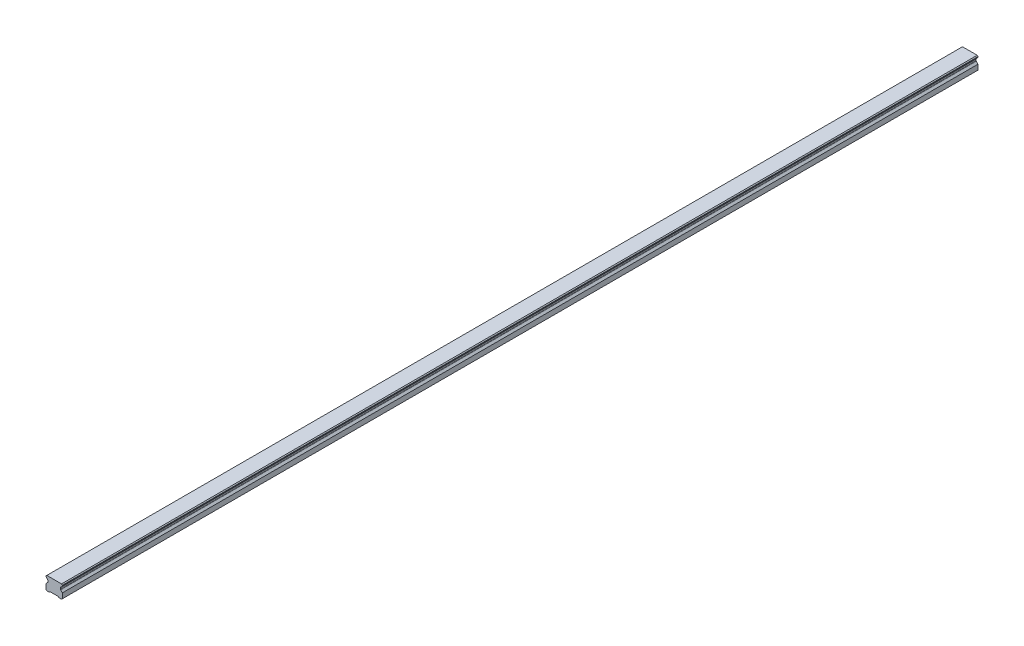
ISO-10303-21;
HEADER;
FILE_DESCRIPTION(('STEP AP214'),'2;1');
FILE_NAME('part.step','',(''),(''),'','','');
FILE_SCHEMA(('AUTOMOTIVE_DESIGN { 1 0 10303 214 1 1 1 1 }'));
ENDSEC;
DATA;
#1=APPLICATION_CONTEXT('core data for automotive mechanical design processes');
#2=APPLICATION_PROTOCOL_DEFINITION('international standard','automotive_design',2000,#1);
#3=PRODUCT_CONTEXT('',#1,'mechanical');
#4=PRODUCT('Part','Part','',(#3));
#5=PRODUCT_RELATED_PRODUCT_CATEGORY('part','',(#4));
#6=PRODUCT_DEFINITION_FORMATION('','',#4);
#7=PRODUCT_DEFINITION_CONTEXT('part definition',#1,'design');
#8=PRODUCT_DEFINITION('design','',#6,#7);
#9=PRODUCT_DEFINITION_SHAPE('','',#8);
#10=(LENGTH_UNIT() NAMED_UNIT(*) SI_UNIT(.MILLI.,.METRE.));
#11=(NAMED_UNIT(*) PLANE_ANGLE_UNIT() SI_UNIT($,.RADIAN.));
#12=(NAMED_UNIT(*) SI_UNIT($,.STERADIAN.) SOLID_ANGLE_UNIT());
#13=UNCERTAINTY_MEASURE_WITH_UNIT(LENGTH_MEASURE(1.E-05),#10,'distance_accuracy_value','');
#14=(GEOMETRIC_REPRESENTATION_CONTEXT(3) GLOBAL_UNCERTAINTY_ASSIGNED_CONTEXT((#13)) GLOBAL_UNIT_ASSIGNED_CONTEXT((#10,
#11,#12)) REPRESENTATION_CONTEXT('',''));
#15=CARTESIAN_POINT('',(0.,0.,0.));
#16=DIRECTION('',(0.,0.,1.));
#17=DIRECTION('',(1.,0.,0.));
#18=AXIS2_PLACEMENT_3D('',#15,#16,#17);
#19=CARTESIAN_POINT('',(0.,11.,-540.));
#20=DIRECTION('',(0.,-1.,0.));
#21=DIRECTION('',(0.,0.,-1.));
#22=AXIS2_PLACEMENT_3D('',#19,#20,#21);
#23=PLANE('',#22);
#24=CARTESIAN_POINT('',(0.,11.,-540.));
#25=DIRECTION('',(0.,-1.,0.));
#26=DIRECTION('',(0.,0.,-1.));
#27=AXIS2_PLACEMENT_3D('',#24,#25,#26);
#28=CIRCLE('',#27,2.5);
#29=CARTESIAN_POINT('',(0.,11.,-542.5));
#30=VERTEX_POINT('',#29);
#31=EDGE_CURVE('E42',#30,#30,#28,.T.);
#32=ORIENTED_EDGE('',*,*,#31,.F.);
#33=EDGE_LOOP('',(#32));
#34=FACE_BOUND('',#33,.T.);
#35=CARTESIAN_POINT('',(0.,11.,-540.));
#36=DIRECTION('',(0.,-1.,0.));
#37=DIRECTION('',(0.,0.,-1.));
#38=AXIS2_PLACEMENT_3D('',#35,#36,#37);
#39=CIRCLE('',#38,3.);
#40=CARTESIAN_POINT('',(0.,11.,-543.));
#41=VERTEX_POINT('',#40);
#42=EDGE_CURVE('E11',#41,#41,#39,.T.);
#43=ORIENTED_EDGE('',*,*,#42,.T.);
#44=EDGE_LOOP('',(#43));
#45=FACE_BOUND('',#44,.T.);
#46=ADVANCED_FACE('F39',(#34,#45),#23,.T.);
#47=CARTESIAN_POINT('',(0.,11.,-540.));
#48=DIRECTION('',(0.,-1.,0.));
#49=DIRECTION('',(0.,0.,-1.));
#50=AXIS2_PLACEMENT_3D('',#47,#48,#49);
#51=CYLINDRICAL_SURFACE('',#50,3.);
#52=ORIENTED_EDGE('',*,*,#42,.F.);
#53=EDGE_LOOP('',(#52));
#54=FACE_BOUND('',#53,.T.);
#55=CARTESIAN_POINT('',(0.,1.,-540.));
#56=DIRECTION('',(0.,-1.,0.));
#57=DIRECTION('',(0.,0.,-1.));
#58=AXIS2_PLACEMENT_3D('',#55,#56,#57);
#59=CIRCLE('',#58,3.);
#60=CARTESIAN_POINT('',(0.,1.,-543.));
#61=VERTEX_POINT('',#60);
#62=EDGE_CURVE('E48',#61,#61,#59,.T.);
#63=ORIENTED_EDGE('',*,*,#62,.T.);
#64=EDGE_LOOP('',(#63));
#65=FACE_BOUND('',#64,.T.);
#66=ADVANCED_FACE('F804',(#54,#65),#51,.F.);
#67=CARTESIAN_POINT('',(0.,11.,-480.));
#68=DIRECTION('',(0.,-1.,0.));
#69=DIRECTION('',(0.,0.,-1.));
#70=AXIS2_PLACEMENT_3D('',#67,#68,#69);
#71=PLANE('',#70);
#72=CARTESIAN_POINT('',(0.,11.,-480.));
#73=DIRECTION('',(0.,-1.,0.));
#74=DIRECTION('',(0.,0.,-1.));
#75=AXIS2_PLACEMENT_3D('',#72,#73,#74);
#76=CIRCLE('',#75,2.5);
#77=CARTESIAN_POINT('',(0.,11.,-482.5));
#78=VERTEX_POINT('',#77);
#79=EDGE_CURVE('E790',#78,#78,#76,.T.);
#80=ORIENTED_EDGE('',*,*,#79,.F.);
#81=EDGE_LOOP('',(#80));
#82=FACE_BOUND('',#81,.T.);
#83=CARTESIAN_POINT('',(0.,11.,-480.));
#84=DIRECTION('',(0.,-1.,0.));
#85=DIRECTION('',(0.,0.,-1.));
#86=AXIS2_PLACEMENT_3D('',#83,#84,#85);
#87=CIRCLE('',#86,3.);
#88=CARTESIAN_POINT('',(0.,11.,-483.));
#89=VERTEX_POINT('',#88);
#90=EDGE_CURVE('E725',#89,#89,#87,.T.);
#91=ORIENTED_EDGE('',*,*,#90,.T.);
#92=EDGE_LOOP('',(#91));
#93=FACE_BOUND('',#92,.T.);
#94=ADVANCED_FACE('F809',(#82,#93),#71,.T.);
#95=CARTESIAN_POINT('',(0.,11.,-480.));
#96=DIRECTION('',(0.,-1.,0.));
#97=DIRECTION('',(0.,0.,-1.));
#98=AXIS2_PLACEMENT_3D('',#95,#96,#97);
#99=CYLINDRICAL_SURFACE('',#98,3.);
#100=ORIENTED_EDGE('',*,*,#90,.F.);
#101=EDGE_LOOP('',(#100));
#102=FACE_BOUND('',#101,.T.);
#103=CARTESIAN_POINT('',(0.,1.,-480.));
#104=DIRECTION('',(0.,-1.,0.));
#105=DIRECTION('',(0.,0.,-1.));
#106=AXIS2_PLACEMENT_3D('',#103,#104,#105);
#107=CIRCLE('',#106,3.);
#108=CARTESIAN_POINT('',(0.,1.,-483.));
#109=VERTEX_POINT('',#108);
#110=EDGE_CURVE('E721',#109,#109,#107,.T.);
#111=ORIENTED_EDGE('',*,*,#110,.T.);
#112=EDGE_LOOP('',(#111));
#113=FACE_BOUND('',#112,.T.);
#114=ADVANCED_FACE('F1032',(#102,#113),#99,.F.);
#115=CARTESIAN_POINT('',(0.,11.,-420.));
#116=DIRECTION('',(0.,-1.,0.));
#117=DIRECTION('',(0.,0.,-1.));
#118=AXIS2_PLACEMENT_3D('',#115,#116,#117);
#119=PLANE('',#118);
#120=CARTESIAN_POINT('',(0.,11.,-420.));
#121=DIRECTION('',(0.,-1.,0.));
#122=DIRECTION('',(0.,0.,-1.));
#123=AXIS2_PLACEMENT_3D('',#120,#121,#122);
#124=CIRCLE('',#123,2.5);
#125=CARTESIAN_POINT('',(0.,11.,-422.5));
#126=VERTEX_POINT('',#125);
#127=EDGE_CURVE('E787',#126,#126,#124,.T.);
#128=ORIENTED_EDGE('',*,*,#127,.F.);
#129=EDGE_LOOP('',(#128));
#130=FACE_BOUND('',#129,.T.);
#131=CARTESIAN_POINT('',(0.,11.,-420.));
#132=DIRECTION('',(0.,-1.,0.));
#133=DIRECTION('',(0.,0.,-1.));
#134=AXIS2_PLACEMENT_3D('',#131,#132,#133);
#135=CIRCLE('',#134,3.);
#136=CARTESIAN_POINT('',(0.,11.,-423.));
#137=VERTEX_POINT('',#136);
#138=EDGE_CURVE('E717',#137,#137,#135,.T.);
#139=ORIENTED_EDGE('',*,*,#138,.T.);
#140=EDGE_LOOP('',(#139));
#141=FACE_BOUND('',#140,.T.);
#142=ADVANCED_FACE('F1028',(#130,#141),#119,.T.);
#143=CARTESIAN_POINT('',(0.,11.,-420.));
#144=DIRECTION('',(0.,-1.,0.));
#145=DIRECTION('',(0.,0.,-1.));
#146=AXIS2_PLACEMENT_3D('',#143,#144,#145);
#147=CYLINDRICAL_SURFACE('',#146,3.);
#148=ORIENTED_EDGE('',*,*,#138,.F.);
#149=EDGE_LOOP('',(#148));
#150=FACE_BOUND('',#149,.T.);
#151=CARTESIAN_POINT('',(0.,1.,-420.));
#152=DIRECTION('',(0.,-1.,0.));
#153=DIRECTION('',(0.,0.,-1.));
#154=AXIS2_PLACEMENT_3D('',#151,#152,#153);
#155=CIRCLE('',#154,3.);
#156=CARTESIAN_POINT('',(0.,1.,-423.));
#157=VERTEX_POINT('',#156);
#158=EDGE_CURVE('E713',#157,#157,#155,.T.);
#159=ORIENTED_EDGE('',*,*,#158,.T.);
#160=EDGE_LOOP('',(#159));
#161=FACE_BOUND('',#160,.T.);
#162=ADVANCED_FACE('F1024',(#150,#161),#147,.F.);
#163=CARTESIAN_POINT('',(0.,11.,-360.));
#164=DIRECTION('',(0.,-1.,0.));
#165=DIRECTION('',(0.,0.,-1.));
#166=AXIS2_PLACEMENT_3D('',#163,#164,#165);
#167=PLANE('',#166);
#168=CARTESIAN_POINT('',(0.,11.,-360.));
#169=DIRECTION('',(0.,-1.,0.));
#170=DIRECTION('',(0.,0.,-1.));
#171=AXIS2_PLACEMENT_3D('',#168,#169,#170);
#172=CIRCLE('',#171,2.5);
#173=CARTESIAN_POINT('',(0.,11.,-362.5));
#174=VERTEX_POINT('',#173);
#175=EDGE_CURVE('E783',#174,#174,#172,.T.);
#176=ORIENTED_EDGE('',*,*,#175,.F.);
#177=EDGE_LOOP('',(#176));
#178=FACE_BOUND('',#177,.T.);
#179=CARTESIAN_POINT('',(0.,11.,-360.));
#180=DIRECTION('',(0.,-1.,0.));
#181=DIRECTION('',(0.,0.,-1.));
#182=AXIS2_PLACEMENT_3D('',#179,#180,#181);
#183=CIRCLE('',#182,3.);
#184=CARTESIAN_POINT('',(0.,11.,-363.));
#185=VERTEX_POINT('',#184);
#186=EDGE_CURVE('E709',#185,#185,#183,.T.);
#187=ORIENTED_EDGE('',*,*,#186,.T.);
#188=EDGE_LOOP('',(#187));
#189=FACE_BOUND('',#188,.T.);
#190=ADVANCED_FACE('F1020',(#178,#189),#167,.T.);
#191=CARTESIAN_POINT('',(0.,11.,-360.));
#192=DIRECTION('',(0.,-1.,0.));
#193=DIRECTION('',(0.,0.,-1.));
#194=AXIS2_PLACEMENT_3D('',#191,#192,#193);
#195=CYLINDRICAL_SURFACE('',#194,3.);
#196=ORIENTED_EDGE('',*,*,#186,.F.);
#197=EDGE_LOOP('',(#196));
#198=FACE_BOUND('',#197,.T.);
#199=CARTESIAN_POINT('',(0.,1.,-360.));
#200=DIRECTION('',(0.,-1.,0.));
#201=DIRECTION('',(0.,0.,-1.));
#202=AXIS2_PLACEMENT_3D('',#199,#200,#201);
#203=CIRCLE('',#202,3.);
#204=CARTESIAN_POINT('',(0.,1.,-363.));
#205=VERTEX_POINT('',#204);
#206=EDGE_CURVE('E705',#205,#205,#203,.T.);
#207=ORIENTED_EDGE('',*,*,#206,.T.);
#208=EDGE_LOOP('',(#207));
#209=FACE_BOUND('',#208,.T.);
#210=ADVANCED_FACE('F1016',(#198,#209),#195,.F.);
#211=CARTESIAN_POINT('',(0.,11.,-300.));
#212=DIRECTION('',(0.,-1.,0.));
#213=DIRECTION('',(0.,0.,-1.));
#214=AXIS2_PLACEMENT_3D('',#211,#212,#213);
#215=PLANE('',#214);
#216=CARTESIAN_POINT('',(0.,11.,-300.));
#217=DIRECTION('',(0.,-1.,0.));
#218=DIRECTION('',(0.,0.,-1.));
#219=AXIS2_PLACEMENT_3D('',#216,#217,#218);
#220=CIRCLE('',#219,2.5);
#221=CARTESIAN_POINT('',(0.,11.,-302.5));
#222=VERTEX_POINT('',#221);
#223=EDGE_CURVE('E779',#222,#222,#220,.T.);
#224=ORIENTED_EDGE('',*,*,#223,.F.);
#225=EDGE_LOOP('',(#224));
#226=FACE_BOUND('',#225,.T.);
#227=CARTESIAN_POINT('',(0.,11.,-300.));
#228=DIRECTION('',(0.,-1.,0.));
#229=DIRECTION('',(0.,0.,-1.));
#230=AXIS2_PLACEMENT_3D('',#227,#228,#229);
#231=CIRCLE('',#230,3.);
#232=CARTESIAN_POINT('',(0.,11.,-303.));
#233=VERTEX_POINT('',#232);
#234=EDGE_CURVE('E701',#233,#233,#231,.T.);
#235=ORIENTED_EDGE('',*,*,#234,.T.);
#236=EDGE_LOOP('',(#235));
#237=FACE_BOUND('',#236,.T.);
#238=ADVANCED_FACE('F1012',(#226,#237),#215,.T.);
#239=CARTESIAN_POINT('',(0.,11.,-300.));
#240=DIRECTION('',(0.,-1.,0.));
#241=DIRECTION('',(0.,0.,-1.));
#242=AXIS2_PLACEMENT_3D('',#239,#240,#241);
#243=CYLINDRICAL_SURFACE('',#242,3.);
#244=ORIENTED_EDGE('',*,*,#234,.F.);
#245=EDGE_LOOP('',(#244));
#246=FACE_BOUND('',#245,.T.);
#247=CARTESIAN_POINT('',(0.,1.,-300.));
#248=DIRECTION('',(0.,-1.,0.));
#249=DIRECTION('',(0.,0.,-1.));
#250=AXIS2_PLACEMENT_3D('',#247,#248,#249);
#251=CIRCLE('',#250,3.);
#252=CARTESIAN_POINT('',(0.,1.,-303.));
#253=VERTEX_POINT('',#252);
#254=EDGE_CURVE('E697',#253,#253,#251,.T.);
#255=ORIENTED_EDGE('',*,*,#254,.T.);
#256=EDGE_LOOP('',(#255));
#257=FACE_BOUND('',#256,.T.);
#258=ADVANCED_FACE('F1008',(#246,#257),#243,.F.);
#259=CARTESIAN_POINT('',(0.,11.,-240.));
#260=DIRECTION('',(0.,-1.,0.));
#261=DIRECTION('',(0.,0.,-1.));
#262=AXIS2_PLACEMENT_3D('',#259,#260,#261);
#263=PLANE('',#262);
#264=CARTESIAN_POINT('',(0.,11.,-240.));
#265=DIRECTION('',(0.,-1.,0.));
#266=DIRECTION('',(0.,0.,-1.));
#267=AXIS2_PLACEMENT_3D('',#264,#265,#266);
#268=CIRCLE('',#267,2.5);
#269=CARTESIAN_POINT('',(0.,11.,-242.5));
#270=VERTEX_POINT('',#269);
#271=EDGE_CURVE('E775',#270,#270,#268,.T.);
#272=ORIENTED_EDGE('',*,*,#271,.F.);
#273=EDGE_LOOP('',(#272));
#274=FACE_BOUND('',#273,.T.);
#275=CARTESIAN_POINT('',(0.,11.,-240.));
#276=DIRECTION('',(0.,-1.,0.));
#277=DIRECTION('',(0.,0.,-1.));
#278=AXIS2_PLACEMENT_3D('',#275,#276,#277);
#279=CIRCLE('',#278,3.);
#280=CARTESIAN_POINT('',(0.,11.,-243.));
#281=VERTEX_POINT('',#280);
#282=EDGE_CURVE('E693',#281,#281,#279,.T.);
#283=ORIENTED_EDGE('',*,*,#282,.T.);
#284=EDGE_LOOP('',(#283));
#285=FACE_BOUND('',#284,.T.);
#286=ADVANCED_FACE('F1004',(#274,#285),#263,.T.);
#287=CARTESIAN_POINT('',(0.,11.,-240.));
#288=DIRECTION('',(0.,-1.,0.));
#289=DIRECTION('',(0.,0.,-1.));
#290=AXIS2_PLACEMENT_3D('',#287,#288,#289);
#291=CYLINDRICAL_SURFACE('',#290,3.);
#292=ORIENTED_EDGE('',*,*,#282,.F.);
#293=EDGE_LOOP('',(#292));
#294=FACE_BOUND('',#293,.T.);
#295=CARTESIAN_POINT('',(0.,1.,-240.));
#296=DIRECTION('',(0.,-1.,0.));
#297=DIRECTION('',(0.,0.,-1.));
#298=AXIS2_PLACEMENT_3D('',#295,#296,#297);
#299=CIRCLE('',#298,3.);
#300=CARTESIAN_POINT('',(0.,1.,-243.));
#301=VERTEX_POINT('',#300);
#302=EDGE_CURVE('E689',#301,#301,#299,.T.);
#303=ORIENTED_EDGE('',*,*,#302,.T.);
#304=EDGE_LOOP('',(#303));
#305=FACE_BOUND('',#304,.T.);
#306=ADVANCED_FACE('F1000',(#294,#305),#291,.F.);
#307=CARTESIAN_POINT('',(0.,11.,-180.));
#308=DIRECTION('',(0.,-1.,0.));
#309=DIRECTION('',(0.,0.,-1.));
#310=AXIS2_PLACEMENT_3D('',#307,#308,#309);
#311=PLANE('',#310);
#312=CARTESIAN_POINT('',(0.,11.,-180.));
#313=DIRECTION('',(0.,-1.,0.));
#314=DIRECTION('',(0.,0.,-1.));
#315=AXIS2_PLACEMENT_3D('',#312,#313,#314);
#316=CIRCLE('',#315,2.5);
#317=CARTESIAN_POINT('',(0.,11.,-182.5));
#318=VERTEX_POINT('',#317);
#319=EDGE_CURVE('E771',#318,#318,#316,.T.);
#320=ORIENTED_EDGE('',*,*,#319,.F.);
#321=EDGE_LOOP('',(#320));
#322=FACE_BOUND('',#321,.T.);
#323=CARTESIAN_POINT('',(0.,11.,-180.));
#324=DIRECTION('',(0.,-1.,0.));
#325=DIRECTION('',(0.,0.,-1.));
#326=AXIS2_PLACEMENT_3D('',#323,#324,#325);
#327=CIRCLE('',#326,3.);
#328=CARTESIAN_POINT('',(0.,11.,-183.));
#329=VERTEX_POINT('',#328);
#330=EDGE_CURVE('E685',#329,#329,#327,.T.);
#331=ORIENTED_EDGE('',*,*,#330,.T.);
#332=EDGE_LOOP('',(#331));
#333=FACE_BOUND('',#332,.T.);
#334=ADVANCED_FACE('F996',(#322,#333),#311,.T.);
#335=CARTESIAN_POINT('',(0.,11.,-180.));
#336=DIRECTION('',(0.,-1.,0.));
#337=DIRECTION('',(0.,0.,-1.));
#338=AXIS2_PLACEMENT_3D('',#335,#336,#337);
#339=CYLINDRICAL_SURFACE('',#338,3.);
#340=ORIENTED_EDGE('',*,*,#330,.F.);
#341=EDGE_LOOP('',(#340));
#342=FACE_BOUND('',#341,.T.);
#343=CARTESIAN_POINT('',(0.,1.,-180.));
#344=DIRECTION('',(0.,-1.,0.));
#345=DIRECTION('',(0.,0.,-1.));
#346=AXIS2_PLACEMENT_3D('',#343,#344,#345);
#347=CIRCLE('',#346,3.);
#348=CARTESIAN_POINT('',(0.,1.,-183.));
#349=VERTEX_POINT('',#348);
#350=EDGE_CURVE('E681',#349,#349,#347,.T.);
#351=ORIENTED_EDGE('',*,*,#350,.T.);
#352=EDGE_LOOP('',(#351));
#353=FACE_BOUND('',#352,.T.);
#354=ADVANCED_FACE('F992',(#342,#353),#339,.F.);
#355=CARTESIAN_POINT('',(0.,11.,-120.));
#356=DIRECTION('',(0.,-1.,0.));
#357=DIRECTION('',(0.,0.,-1.));
#358=AXIS2_PLACEMENT_3D('',#355,#356,#357);
#359=PLANE('',#358);
#360=CARTESIAN_POINT('',(0.,11.,-120.));
#361=DIRECTION('',(0.,-1.,0.));
#362=DIRECTION('',(0.,0.,-1.));
#363=AXIS2_PLACEMENT_3D('',#360,#361,#362);
#364=CIRCLE('',#363,2.5);
#365=CARTESIAN_POINT('',(0.,11.,-122.5));
#366=VERTEX_POINT('',#365);
#367=EDGE_CURVE('E767',#366,#366,#364,.T.);
#368=ORIENTED_EDGE('',*,*,#367,.F.);
#369=EDGE_LOOP('',(#368));
#370=FACE_BOUND('',#369,.T.);
#371=CARTESIAN_POINT('',(0.,11.,-120.));
#372=DIRECTION('',(0.,-1.,0.));
#373=DIRECTION('',(0.,0.,-1.));
#374=AXIS2_PLACEMENT_3D('',#371,#372,#373);
#375=CIRCLE('',#374,3.);
#376=CARTESIAN_POINT('',(0.,11.,-123.));
#377=VERTEX_POINT('',#376);
#378=EDGE_CURVE('E677',#377,#377,#375,.T.);
#379=ORIENTED_EDGE('',*,*,#378,.T.);
#380=EDGE_LOOP('',(#379));
#381=FACE_BOUND('',#380,.T.);
#382=ADVANCED_FACE('F988',(#370,#381),#359,.T.);
#383=CARTESIAN_POINT('',(0.,11.,-120.));
#384=DIRECTION('',(0.,-1.,0.));
#385=DIRECTION('',(0.,0.,-1.));
#386=AXIS2_PLACEMENT_3D('',#383,#384,#385);
#387=CYLINDRICAL_SURFACE('',#386,3.);
#388=ORIENTED_EDGE('',*,*,#378,.F.);
#389=EDGE_LOOP('',(#388));
#390=FACE_BOUND('',#389,.T.);
#391=CARTESIAN_POINT('',(0.,1.,-120.));
#392=DIRECTION('',(0.,-1.,0.));
#393=DIRECTION('',(0.,0.,-1.));
#394=AXIS2_PLACEMENT_3D('',#391,#392,#393);
#395=CIRCLE('',#394,3.);
#396=CARTESIAN_POINT('',(0.,1.,-123.));
#397=VERTEX_POINT('',#396);
#398=EDGE_CURVE('E673',#397,#397,#395,.T.);
#399=ORIENTED_EDGE('',*,*,#398,.T.);
#400=EDGE_LOOP('',(#399));
#401=FACE_BOUND('',#400,.T.);
#402=ADVANCED_FACE('F984',(#390,#401),#387,.F.);
#403=CARTESIAN_POINT('',(0.,11.,-60.));
#404=DIRECTION('',(0.,-1.,0.));
#405=DIRECTION('',(0.,0.,-1.));
#406=AXIS2_PLACEMENT_3D('',#403,#404,#405);
#407=PLANE('',#406);
#408=CARTESIAN_POINT('',(0.,11.,-59.9999999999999));
#409=DIRECTION('',(0.,-1.,0.));
#410=DIRECTION('',(0.,0.,-1.));
#411=AXIS2_PLACEMENT_3D('',#408,#409,#410);
#412=CIRCLE('',#411,2.5);
#413=CARTESIAN_POINT('',(0.,11.,-62.4999999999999));
#414=VERTEX_POINT('',#413);
#415=EDGE_CURVE('E763',#414,#414,#412,.T.);
#416=ORIENTED_EDGE('',*,*,#415,.F.);
#417=EDGE_LOOP('',(#416));
#418=FACE_BOUND('',#417,.T.);
#419=CARTESIAN_POINT('',(0.,11.,-60.));
#420=DIRECTION('',(0.,-1.,0.));
#421=DIRECTION('',(0.,0.,-1.));
#422=AXIS2_PLACEMENT_3D('',#419,#420,#421);
#423=CIRCLE('',#422,3.);
#424=CARTESIAN_POINT('',(0.,11.,-63.));
#425=VERTEX_POINT('',#424);
#426=EDGE_CURVE('E669',#425,#425,#423,.T.);
#427=ORIENTED_EDGE('',*,*,#426,.T.);
#428=EDGE_LOOP('',(#427));
#429=FACE_BOUND('',#428,.T.);
#430=ADVANCED_FACE('F980',(#418,#429),#407,.T.);
#431=CARTESIAN_POINT('',(0.,11.,-60.));
#432=DIRECTION('',(0.,-1.,0.));
#433=DIRECTION('',(0.,0.,-1.));
#434=AXIS2_PLACEMENT_3D('',#431,#432,#433);
#435=CYLINDRICAL_SURFACE('',#434,3.);
#436=ORIENTED_EDGE('',*,*,#426,.F.);
#437=EDGE_LOOP('',(#436));
#438=FACE_BOUND('',#437,.T.);
#439=CARTESIAN_POINT('',(0.,1.,-60.));
#440=DIRECTION('',(0.,-1.,0.));
#441=DIRECTION('',(0.,0.,-1.));
#442=AXIS2_PLACEMENT_3D('',#439,#440,#441);
#443=CIRCLE('',#442,3.);
#444=CARTESIAN_POINT('',(0.,1.,-63.));
#445=VERTEX_POINT('',#444);
#446=EDGE_CURVE('E665',#445,#445,#443,.T.);
#447=ORIENTED_EDGE('',*,*,#446,.T.);
#448=EDGE_LOOP('',(#447));
#449=FACE_BOUND('',#448,.T.);
#450=ADVANCED_FACE('F976',(#438,#449),#435,.F.);
#451=CARTESIAN_POINT('',(0.,11.,0.));
#452=DIRECTION('',(0.,-1.,0.));
#453=DIRECTION('',(0.,0.,-1.));
#454=AXIS2_PLACEMENT_3D('',#451,#452,#453);
#455=PLANE('',#454);
#456=CARTESIAN_POINT('',(0.,11.,0.));
#457=DIRECTION('',(0.,-1.,0.));
#458=DIRECTION('',(0.,0.,-1.));
#459=AXIS2_PLACEMENT_3D('',#456,#457,#458);
#460=CIRCLE('',#459,2.5);
#461=CARTESIAN_POINT('',(0.,11.,-2.5));
#462=VERTEX_POINT('',#461);
#463=EDGE_CURVE('E759',#462,#462,#460,.T.);
#464=ORIENTED_EDGE('',*,*,#463,.F.);
#465=EDGE_LOOP('',(#464));
#466=FACE_BOUND('',#465,.T.);
#467=CARTESIAN_POINT('',(0.,11.,0.));
#468=DIRECTION('',(0.,-1.,0.));
#469=DIRECTION('',(0.,0.,-1.));
#470=AXIS2_PLACEMENT_3D('',#467,#468,#469);
#471=CIRCLE('',#470,3.);
#472=CARTESIAN_POINT('',(0.,11.,-3.));
#473=VERTEX_POINT('',#472);
#474=EDGE_CURVE('E661',#473,#473,#471,.T.);
#475=ORIENTED_EDGE('',*,*,#474,.T.);
#476=EDGE_LOOP('',(#475));
#477=FACE_BOUND('',#476,.T.);
#478=ADVANCED_FACE('F972',(#466,#477),#455,.T.);
#479=CARTESIAN_POINT('',(0.,11.,0.));
#480=DIRECTION('',(0.,-1.,0.));
#481=DIRECTION('',(0.,0.,-1.));
#482=AXIS2_PLACEMENT_3D('',#479,#480,#481);
#483=CYLINDRICAL_SURFACE('',#482,3.);
#484=ORIENTED_EDGE('',*,*,#474,.F.);
#485=EDGE_LOOP('',(#484));
#486=FACE_BOUND('',#485,.T.);
#487=CARTESIAN_POINT('',(0.,1.,0.));
#488=DIRECTION('',(0.,-1.,0.));
#489=DIRECTION('',(0.,0.,-1.));
#490=AXIS2_PLACEMENT_3D('',#487,#488,#489);
#491=CIRCLE('',#490,3.);
#492=CARTESIAN_POINT('',(0.,1.,-3.));
#493=VERTEX_POINT('',#492);
#494=EDGE_CURVE('E657',#493,#493,#491,.T.);
#495=ORIENTED_EDGE('',*,*,#494,.T.);
#496=EDGE_LOOP('',(#495));
#497=FACE_BOUND('',#496,.T.);
#498=ADVANCED_FACE('F968',(#486,#497),#483,.F.);
#499=CARTESIAN_POINT('',(0.,11.,60.0000000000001));
#500=DIRECTION('',(0.,-1.,0.));
#501=DIRECTION('',(0.,0.,-1.));
#502=AXIS2_PLACEMENT_3D('',#499,#500,#501);
#503=PLANE('',#502);
#504=CARTESIAN_POINT('',(0.,11.,60.0000000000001));
#505=DIRECTION('',(0.,-1.,0.));
#506=DIRECTION('',(0.,0.,-1.));
#507=AXIS2_PLACEMENT_3D('',#504,#505,#506);
#508=CIRCLE('',#507,2.5);
#509=CARTESIAN_POINT('',(0.,11.,57.5));
#510=VERTEX_POINT('',#509);
#511=EDGE_CURVE('E755',#510,#510,#508,.T.);
#512=ORIENTED_EDGE('',*,*,#511,.F.);
#513=EDGE_LOOP('',(#512));
#514=FACE_BOUND('',#513,.T.);
#515=CARTESIAN_POINT('',(0.,11.,60.0000000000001));
#516=DIRECTION('',(0.,-1.,0.));
#517=DIRECTION('',(0.,0.,-1.));
#518=AXIS2_PLACEMENT_3D('',#515,#516,#517);
#519=CIRCLE('',#518,3.);
#520=CARTESIAN_POINT('',(0.,11.,57.));
#521=VERTEX_POINT('',#520);
#522=EDGE_CURVE('E653',#521,#521,#519,.T.);
#523=ORIENTED_EDGE('',*,*,#522,.T.);
#524=EDGE_LOOP('',(#523));
#525=FACE_BOUND('',#524,.T.);
#526=ADVANCED_FACE('F964',(#514,#525),#503,.T.);
#527=CARTESIAN_POINT('',(0.,11.,60.0000000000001));
#528=DIRECTION('',(0.,-1.,0.));
#529=DIRECTION('',(0.,0.,-1.));
#530=AXIS2_PLACEMENT_3D('',#527,#528,#529);
#531=CYLINDRICAL_SURFACE('',#530,3.);
#532=ORIENTED_EDGE('',*,*,#522,.F.);
#533=EDGE_LOOP('',(#532));
#534=FACE_BOUND('',#533,.T.);
#535=CARTESIAN_POINT('',(0.,1.,60.0000000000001));
#536=DIRECTION('',(0.,-1.,0.));
#537=DIRECTION('',(0.,0.,-1.));
#538=AXIS2_PLACEMENT_3D('',#535,#536,#537);
#539=CIRCLE('',#538,3.);
#540=CARTESIAN_POINT('',(0.,1.,57.));
#541=VERTEX_POINT('',#540);
#542=EDGE_CURVE('E649',#541,#541,#539,.T.);
#543=ORIENTED_EDGE('',*,*,#542,.T.);
#544=EDGE_LOOP('',(#543));
#545=FACE_BOUND('',#544,.T.);
#546=ADVANCED_FACE('F960',(#534,#545),#531,.F.);
#547=CARTESIAN_POINT('',(0.,11.,120.));
#548=DIRECTION('',(0.,-1.,0.));
#549=DIRECTION('',(0.,0.,-1.));
#550=AXIS2_PLACEMENT_3D('',#547,#548,#549);
#551=PLANE('',#550);
#552=CARTESIAN_POINT('',(0.,11.,120.));
#553=DIRECTION('',(0.,-1.,0.));
#554=DIRECTION('',(0.,0.,-1.));
#555=AXIS2_PLACEMENT_3D('',#552,#553,#554);
#556=CIRCLE('',#555,2.5);
#557=CARTESIAN_POINT('',(0.,11.,117.5));
#558=VERTEX_POINT('',#557);
#559=EDGE_CURVE('E751',#558,#558,#556,.T.);
#560=ORIENTED_EDGE('',*,*,#559,.F.);
#561=EDGE_LOOP('',(#560));
#562=FACE_BOUND('',#561,.T.);
#563=CARTESIAN_POINT('',(0.,11.,120.));
#564=DIRECTION('',(0.,-1.,0.));
#565=DIRECTION('',(0.,0.,-1.));
#566=AXIS2_PLACEMENT_3D('',#563,#564,#565);
#567=CIRCLE('',#566,3.);
#568=CARTESIAN_POINT('',(0.,11.,117.));
#569=VERTEX_POINT('',#568);
#570=EDGE_CURVE('E645',#569,#569,#567,.T.);
#571=ORIENTED_EDGE('',*,*,#570,.T.);
#572=EDGE_LOOP('',(#571));
#573=FACE_BOUND('',#572,.T.);
#574=ADVANCED_FACE('F956',(#562,#573),#551,.T.);
#575=CARTESIAN_POINT('',(0.,11.,120.));
#576=DIRECTION('',(0.,-1.,0.));
#577=DIRECTION('',(0.,0.,-1.));
#578=AXIS2_PLACEMENT_3D('',#575,#576,#577);
#579=CYLINDRICAL_SURFACE('',#578,3.);
#580=ORIENTED_EDGE('',*,*,#570,.F.);
#581=EDGE_LOOP('',(#580));
#582=FACE_BOUND('',#581,.T.);
#583=CARTESIAN_POINT('',(0.,1.,120.));
#584=DIRECTION('',(0.,-1.,0.));
#585=DIRECTION('',(0.,0.,-1.));
#586=AXIS2_PLACEMENT_3D('',#583,#584,#585);
#587=CIRCLE('',#586,3.);
#588=CARTESIAN_POINT('',(0.,1.,117.));
#589=VERTEX_POINT('',#588);
#590=EDGE_CURVE('E641',#589,#589,#587,.T.);
#591=ORIENTED_EDGE('',*,*,#590,.T.);
#592=EDGE_LOOP('',(#591));
#593=FACE_BOUND('',#592,.T.);
#594=ADVANCED_FACE('F952',(#582,#593),#579,.F.);
#595=CARTESIAN_POINT('',(0.,11.,180.));
#596=DIRECTION('',(0.,-1.,0.));
#597=DIRECTION('',(0.,0.,-1.));
#598=AXIS2_PLACEMENT_3D('',#595,#596,#597);
#599=PLANE('',#598);
#600=CARTESIAN_POINT('',(0.,11.,180.));
#601=DIRECTION('',(0.,-1.,0.));
#602=DIRECTION('',(0.,0.,-1.));
#603=AXIS2_PLACEMENT_3D('',#600,#601,#602);
#604=CIRCLE('',#603,2.5);
#605=CARTESIAN_POINT('',(0.,11.,177.5));
#606=VERTEX_POINT('',#605);
#607=EDGE_CURVE('E747',#606,#606,#604,.T.);
#608=ORIENTED_EDGE('',*,*,#607,.F.);
#609=EDGE_LOOP('',(#608));
#610=FACE_BOUND('',#609,.T.);
#611=CARTESIAN_POINT('',(0.,11.,180.));
#612=DIRECTION('',(0.,-1.,0.));
#613=DIRECTION('',(0.,0.,-1.));
#614=AXIS2_PLACEMENT_3D('',#611,#612,#613);
#615=CIRCLE('',#614,3.);
#616=CARTESIAN_POINT('',(0.,11.,177.));
#617=VERTEX_POINT('',#616);
#618=EDGE_CURVE('E637',#617,#617,#615,.T.);
#619=ORIENTED_EDGE('',*,*,#618,.T.);
#620=EDGE_LOOP('',(#619));
#621=FACE_BOUND('',#620,.T.);
#622=ADVANCED_FACE('F948',(#610,#621),#599,.T.);
#623=CARTESIAN_POINT('',(0.,11.,180.));
#624=DIRECTION('',(0.,-1.,0.));
#625=DIRECTION('',(0.,0.,-1.));
#626=AXIS2_PLACEMENT_3D('',#623,#624,#625);
#627=CYLINDRICAL_SURFACE('',#626,3.);
#628=ORIENTED_EDGE('',*,*,#618,.F.);
#629=EDGE_LOOP('',(#628));
#630=FACE_BOUND('',#629,.T.);
#631=CARTESIAN_POINT('',(0.,1.,180.));
#632=DIRECTION('',(0.,-1.,0.));
#633=DIRECTION('',(0.,0.,-1.));
#634=AXIS2_PLACEMENT_3D('',#631,#632,#633);
#635=CIRCLE('',#634,3.);
#636=CARTESIAN_POINT('',(0.,1.,177.));
#637=VERTEX_POINT('',#636);
#638=EDGE_CURVE('E633',#637,#637,#635,.T.);
#639=ORIENTED_EDGE('',*,*,#638,.T.);
#640=EDGE_LOOP('',(#639));
#641=FACE_BOUND('',#640,.T.);
#642=ADVANCED_FACE('F944',(#630,#641),#627,.F.);
#643=CARTESIAN_POINT('',(0.,11.,240.));
#644=DIRECTION('',(0.,-1.,0.));
#645=DIRECTION('',(0.,0.,-1.));
#646=AXIS2_PLACEMENT_3D('',#643,#644,#645);
#647=PLANE('',#646);
#648=CARTESIAN_POINT('',(0.,11.,240.));
#649=DIRECTION('',(0.,-1.,0.));
#650=DIRECTION('',(0.,0.,-1.));
#651=AXIS2_PLACEMENT_3D('',#648,#649,#650);
#652=CIRCLE('',#651,2.5);
#653=CARTESIAN_POINT('',(0.,11.,237.5));
#654=VERTEX_POINT('',#653);
#655=EDGE_CURVE('E743',#654,#654,#652,.T.);
#656=ORIENTED_EDGE('',*,*,#655,.F.);
#657=EDGE_LOOP('',(#656));
#658=FACE_BOUND('',#657,.T.);
#659=CARTESIAN_POINT('',(0.,11.,240.));
#660=DIRECTION('',(0.,-1.,0.));
#661=DIRECTION('',(0.,0.,-1.));
#662=AXIS2_PLACEMENT_3D('',#659,#660,#661);
#663=CIRCLE('',#662,3.);
#664=CARTESIAN_POINT('',(0.,11.,237.));
#665=VERTEX_POINT('',#664);
#666=EDGE_CURVE('E629',#665,#665,#663,.T.);
#667=ORIENTED_EDGE('',*,*,#666,.T.);
#668=EDGE_LOOP('',(#667));
#669=FACE_BOUND('',#668,.T.);
#670=ADVANCED_FACE('F940',(#658,#669),#647,.T.);
#671=CARTESIAN_POINT('',(0.,11.,240.));
#672=DIRECTION('',(0.,-1.,0.));
#673=DIRECTION('',(0.,0.,-1.));
#674=AXIS2_PLACEMENT_3D('',#671,#672,#673);
#675=CYLINDRICAL_SURFACE('',#674,3.);
#676=ORIENTED_EDGE('',*,*,#666,.F.);
#677=EDGE_LOOP('',(#676));
#678=FACE_BOUND('',#677,.T.);
#679=CARTESIAN_POINT('',(0.,1.,240.));
#680=DIRECTION('',(0.,-1.,0.));
#681=DIRECTION('',(0.,0.,-1.));
#682=AXIS2_PLACEMENT_3D('',#679,#680,#681);
#683=CIRCLE('',#682,3.);
#684=CARTESIAN_POINT('',(0.,1.,237.));
#685=VERTEX_POINT('',#684);
#686=EDGE_CURVE('E625',#685,#685,#683,.T.);
#687=ORIENTED_EDGE('',*,*,#686,.T.);
#688=EDGE_LOOP('',(#687));
#689=FACE_BOUND('',#688,.T.);
#690=ADVANCED_FACE('F936',(#678,#689),#675,.F.);
#691=CARTESIAN_POINT('',(0.,11.,300.));
#692=DIRECTION('',(0.,-1.,0.));
#693=DIRECTION('',(0.,0.,-1.));
#694=AXIS2_PLACEMENT_3D('',#691,#692,#693);
#695=PLANE('',#694);
#696=CARTESIAN_POINT('',(0.,11.,300.));
#697=DIRECTION('',(0.,-1.,0.));
#698=DIRECTION('',(0.,0.,-1.));
#699=AXIS2_PLACEMENT_3D('',#696,#697,#698);
#700=CIRCLE('',#699,2.5);
#701=CARTESIAN_POINT('',(0.,11.,297.5));
#702=VERTEX_POINT('',#701);
#703=EDGE_CURVE('E739',#702,#702,#700,.T.);
#704=ORIENTED_EDGE('',*,*,#703,.F.);
#705=EDGE_LOOP('',(#704));
#706=FACE_BOUND('',#705,.T.);
#707=CARTESIAN_POINT('',(0.,11.,300.));
#708=DIRECTION('',(0.,-1.,0.));
#709=DIRECTION('',(0.,0.,-1.));
#710=AXIS2_PLACEMENT_3D('',#707,#708,#709);
#711=CIRCLE('',#710,3.);
#712=CARTESIAN_POINT('',(0.,11.,297.));
#713=VERTEX_POINT('',#712);
#714=EDGE_CURVE('E621',#713,#713,#711,.T.);
#715=ORIENTED_EDGE('',*,*,#714,.T.);
#716=EDGE_LOOP('',(#715));
#717=FACE_BOUND('',#716,.T.);
#718=ADVANCED_FACE('F932',(#706,#717),#695,.T.);
#719=CARTESIAN_POINT('',(0.,11.,300.));
#720=DIRECTION('',(0.,-1.,0.));
#721=DIRECTION('',(0.,0.,-1.));
#722=AXIS2_PLACEMENT_3D('',#719,#720,#721);
#723=CYLINDRICAL_SURFACE('',#722,3.);
#724=ORIENTED_EDGE('',*,*,#714,.F.);
#725=EDGE_LOOP('',(#724));
#726=FACE_BOUND('',#725,.T.);
#727=CARTESIAN_POINT('',(0.,1.,300.));
#728=DIRECTION('',(0.,-1.,0.));
#729=DIRECTION('',(0.,0.,-1.));
#730=AXIS2_PLACEMENT_3D('',#727,#728,#729);
#731=CIRCLE('',#730,3.);
#732=CARTESIAN_POINT('',(0.,1.,297.));
#733=VERTEX_POINT('',#732);
#734=EDGE_CURVE('E617',#733,#733,#731,.T.);
#735=ORIENTED_EDGE('',*,*,#734,.T.);
#736=EDGE_LOOP('',(#735));
#737=FACE_BOUND('',#736,.T.);
#738=ADVANCED_FACE('F928',(#726,#737),#723,.F.);
#739=CARTESIAN_POINT('',(0.,11.,360.));
#740=DIRECTION('',(0.,-1.,0.));
#741=DIRECTION('',(0.,0.,-1.));
#742=AXIS2_PLACEMENT_3D('',#739,#740,#741);
#743=PLANE('',#742);
#744=CARTESIAN_POINT('',(0.,11.,360.));
#745=DIRECTION('',(0.,-1.,0.));
#746=DIRECTION('',(0.,0.,-1.));
#747=AXIS2_PLACEMENT_3D('',#744,#745,#746);
#748=CIRCLE('',#747,2.5);
#749=CARTESIAN_POINT('',(0.,11.,357.5));
#750=VERTEX_POINT('',#749);
#751=EDGE_CURVE('E735',#750,#750,#748,.T.);
#752=ORIENTED_EDGE('',*,*,#751,.F.);
#753=EDGE_LOOP('',(#752));
#754=FACE_BOUND('',#753,.T.);
#755=CARTESIAN_POINT('',(0.,11.,360.));
#756=DIRECTION('',(0.,-1.,0.));
#757=DIRECTION('',(0.,0.,-1.));
#758=AXIS2_PLACEMENT_3D('',#755,#756,#757);
#759=CIRCLE('',#758,3.);
#760=CARTESIAN_POINT('',(0.,11.,357.));
#761=VERTEX_POINT('',#760);
#762=EDGE_CURVE('E613',#761,#761,#759,.T.);
#763=ORIENTED_EDGE('',*,*,#762,.T.);
#764=EDGE_LOOP('',(#763));
#765=FACE_BOUND('',#764,.T.);
#766=ADVANCED_FACE('F924',(#754,#765),#743,.T.);
#767=CARTESIAN_POINT('',(0.,11.,360.));
#768=DIRECTION('',(0.,-1.,0.));
#769=DIRECTION('',(0.,0.,-1.));
#770=AXIS2_PLACEMENT_3D('',#767,#768,#769);
#771=CYLINDRICAL_SURFACE('',#770,3.);
#772=ORIENTED_EDGE('',*,*,#762,.F.);
#773=EDGE_LOOP('',(#772));
#774=FACE_BOUND('',#773,.T.);
#775=CARTESIAN_POINT('',(0.,1.,360.));
#776=DIRECTION('',(0.,-1.,0.));
#777=DIRECTION('',(0.,0.,-1.));
#778=AXIS2_PLACEMENT_3D('',#775,#776,#777);
#779=CIRCLE('',#778,3.);
#780=CARTESIAN_POINT('',(0.,1.,357.));
#781=VERTEX_POINT('',#780);
#782=EDGE_CURVE('E609',#781,#781,#779,.T.);
#783=ORIENTED_EDGE('',*,*,#782,.T.);
#784=EDGE_LOOP('',(#783));
#785=FACE_BOUND('',#784,.T.);
#786=ADVANCED_FACE('F920',(#774,#785),#771,.F.);
#787=CARTESIAN_POINT('',(0.,11.,420.));
#788=DIRECTION('',(0.,-1.,0.));
#789=DIRECTION('',(0.,0.,-1.));
#790=AXIS2_PLACEMENT_3D('',#787,#788,#789);
#791=PLANE('',#790);
#792=CARTESIAN_POINT('',(0.,11.,420.));
#793=DIRECTION('',(0.,-1.,0.));
#794=DIRECTION('',(0.,0.,-1.));
#795=AXIS2_PLACEMENT_3D('',#792,#793,#794);
#796=CIRCLE('',#795,2.5);
#797=CARTESIAN_POINT('',(0.,11.,417.5));
#798=VERTEX_POINT('',#797);
#799=EDGE_CURVE('E275',#798,#798,#796,.T.);
#800=ORIENTED_EDGE('',*,*,#799,.F.);
#801=EDGE_LOOP('',(#800));
#802=FACE_BOUND('',#801,.T.);
#803=CARTESIAN_POINT('',(0.,11.,420.));
#804=DIRECTION('',(0.,-1.,0.));
#805=DIRECTION('',(0.,0.,-1.));
#806=AXIS2_PLACEMENT_3D('',#803,#804,#805);
#807=CIRCLE('',#806,3.);
#808=CARTESIAN_POINT('',(0.,11.,417.));
#809=VERTEX_POINT('',#808);
#810=EDGE_CURVE('E605',#809,#809,#807,.T.);
#811=ORIENTED_EDGE('',*,*,#810,.T.);
#812=EDGE_LOOP('',(#811));
#813=FACE_BOUND('',#812,.T.);
#814=ADVANCED_FACE('F916',(#802,#813),#791,.T.);
#815=CARTESIAN_POINT('',(0.,11.,420.));
#816=DIRECTION('',(0.,-1.,0.));
#817=DIRECTION('',(0.,0.,-1.));
#818=AXIS2_PLACEMENT_3D('',#815,#816,#817);
#819=CYLINDRICAL_SURFACE('',#818,3.);
#820=ORIENTED_EDGE('',*,*,#810,.F.);
#821=EDGE_LOOP('',(#820));
#822=FACE_BOUND('',#821,.T.);
#823=CARTESIAN_POINT('',(0.,1.,420.));
#824=DIRECTION('',(0.,-1.,0.));
#825=DIRECTION('',(0.,0.,-1.));
#826=AXIS2_PLACEMENT_3D('',#823,#824,#825);
#827=CIRCLE('',#826,3.);
#828=CARTESIAN_POINT('',(0.,1.,417.));
#829=VERTEX_POINT('',#828);
#830=EDGE_CURVE('E601',#829,#829,#827,.T.);
#831=ORIENTED_EDGE('',*,*,#830,.T.);
#832=EDGE_LOOP('',(#831));
#833=FACE_BOUND('',#832,.T.);
#834=ADVANCED_FACE('F913',(#822,#833),#819,.F.);
#835=CARTESIAN_POINT('',(10.,0.,560.));
#836=DIRECTION('',(0.,1.,0.));
#837=DIRECTION('',(-1.,0.,0.));
#838=AXIS2_PLACEMENT_3D('',#835,#836,#837);
#839=PLANE('',#838);
#840=DIRECTION('',(1.,0.,0.));
#841=VECTOR('',#840,1.);
#842=CARTESIAN_POINT('',(10.,0.,-560.));
#843=LINE('',#842,#841);
#844=CARTESIAN_POINT('',(-9.,0.,-560.));
#845=VERTEX_POINT('',#844);
#846=CARTESIAN_POINT('',(-6.,0.,-560.));
#847=VERTEX_POINT('',#846);
#848=EDGE_CURVE('E485',#845,#847,#843,.T.);
#849=ORIENTED_EDGE('',*,*,#848,.T.);
#850=DIRECTION('',(0.,0.,1.));
#851=VECTOR('',#850,1.);
#852=CARTESIAN_POINT('',(-6.,0.,-560.));
#853=LINE('',#852,#851);
#854=CARTESIAN_POINT('',(-6.,0.,560.));
#855=VERTEX_POINT('',#854);
#856=EDGE_CURVE('E390',#847,#855,#853,.T.);
#857=ORIENTED_EDGE('',*,*,#856,.T.);
#858=DIRECTION('',(1.,0.,0.));
#859=VECTOR('',#858,1.);
#860=CARTESIAN_POINT('',(10.,0.,560.));
#861=LINE('',#860,#859);
#862=CARTESIAN_POINT('',(-9.,0.,560.));
#863=VERTEX_POINT('',#862);
#864=EDGE_CURVE('E466',#863,#855,#861,.T.);
#865=ORIENTED_EDGE('',*,*,#864,.F.);
#866=DIRECTION('',(0.,0.,-1.));
#867=VECTOR('',#866,1.);
#868=CARTESIAN_POINT('',(-9.,0.,560.));
#869=LINE('',#868,#867);
#870=EDGE_CURVE('E537',#863,#845,#869,.T.);
#871=ORIENTED_EDGE('',*,*,#870,.T.);
#872=EDGE_LOOP('',(#849,#857,#865,#871));
#873=FACE_BOUND('',#872,.T.);
#874=ADVANCED_FACE('F878',(#873),#839,.F.);
#875=CARTESIAN_POINT('',(-10.,16.3,560.));
#876=DIRECTION('',(1.,0.,0.));
#877=DIRECTION('',(0.,1.,0.));
#878=AXIS2_PLACEMENT_3D('',#875,#876,#877);
#879=PLANE('',#878);
#880=DIRECTION('',(0.,-1.,0.));
#881=VECTOR('',#880,1.);
#882=CARTESIAN_POINT('',(-10.,16.3,560.));
#883=LINE('',#882,#881);
#884=CARTESIAN_POINT('',(-10.,15.3,560.));
#885=VERTEX_POINT('',#884);
#886=CARTESIAN_POINT('',(-10.,14.3,560.));
#887=VERTEX_POINT('',#886);
#888=EDGE_CURVE('E460',#885,#887,#883,.T.);
#889=ORIENTED_EDGE('',*,*,#888,.F.);
#890=DIRECTION('',(0.,0.,-1.));
#891=VECTOR('',#890,1.);
#892=CARTESIAN_POINT('',(-10.,15.3,560.));
#893=LINE('',#892,#891);
#894=CARTESIAN_POINT('',(-10.,15.3,-560.));
#895=VERTEX_POINT('',#894);
#896=EDGE_CURVE('E479',#885,#895,#893,.T.);
#897=ORIENTED_EDGE('',*,*,#896,.T.);
#898=DIRECTION('',(0.,-1.,0.));
#899=VECTOR('',#898,1.);
#900=CARTESIAN_POINT('',(-10.,16.3,-560.));
#901=LINE('',#900,#899);
#902=CARTESIAN_POINT('',(-10.,14.3,-560.));
#903=VERTEX_POINT('',#902);
#904=EDGE_CURVE('E480',#895,#903,#901,.T.);
#905=ORIENTED_EDGE('',*,*,#904,.T.);
#906=DIRECTION('',(0.,0.,1.));
#907=VECTOR('',#906,1.);
#908=CARTESIAN_POINT('',(-10.,14.3,-560.));
#909=LINE('',#908,#907);
#910=EDGE_CURVE('E414',#903,#887,#909,.T.);
#911=ORIENTED_EDGE('',*,*,#910,.T.);
#912=EDGE_LOOP('',(#889,#897,#905,#911));
#913=FACE_BOUND('',#912,.T.);
#914=ADVANCED_FACE('F882',(#913),#879,.F.);
#915=CARTESIAN_POINT('',(10.,16.3,560.));
#916=DIRECTION('',(-1.,0.,0.));
#917=DIRECTION('',(0.,-1.,0.));
#918=AXIS2_PLACEMENT_3D('',#915,#916,#917);
#919=PLANE('',#918);
#920=DIRECTION('',(0.,1.,0.));
#921=VECTOR('',#920,1.);
#922=CARTESIAN_POINT('',(10.,16.3,560.));
#923=LINE('',#922,#921);
#924=CARTESIAN_POINT('',(10.,1.00000000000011,560.));
#925=VERTEX_POINT('',#924);
#926=CARTESIAN_POINT('',(10.,7.3,560.));
#927=VERTEX_POINT('',#926);
#928=EDGE_CURVE('E471',#925,#927,#923,.T.);
#929=ORIENTED_EDGE('',*,*,#928,.F.);
#930=DIRECTION('',(0.,0.,-1.));
#931=VECTOR('',#930,1.);
#932=CARTESIAN_POINT('',(10.,1.00000000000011,560.));
#933=LINE('',#932,#931);
#934=CARTESIAN_POINT('',(10.,1.00000000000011,-560.));
#935=VERTEX_POINT('',#934);
#936=EDGE_CURVE('E544',#925,#935,#933,.T.);
#937=ORIENTED_EDGE('',*,*,#936,.T.);
#938=DIRECTION('',(0.,1.,0.));
#939=VECTOR('',#938,1.);
#940=CARTESIAN_POINT('',(10.,16.3,-560.));
#941=LINE('',#940,#939);
#942=CARTESIAN_POINT('',(10.,7.3,-560.));
#943=VERTEX_POINT('',#942);
#944=EDGE_CURVE('E490',#935,#943,#941,.T.);
#945=ORIENTED_EDGE('',*,*,#944,.T.);
#946=DIRECTION('',(0.,0.,1.));
#947=VECTOR('',#946,1.);
#948=CARTESIAN_POINT('',(10.,7.3,-560.));
#949=LINE('',#948,#947);
#950=EDGE_CURVE('E445',#943,#927,#949,.T.);
#951=ORIENTED_EDGE('',*,*,#950,.T.);
#952=EDGE_LOOP('',(#929,#937,#945,#951));
#953=FACE_BOUND('',#952,.T.);
#954=ADVANCED_FACE('F873',(#953),#919,.F.);
#955=CARTESIAN_POINT('',(-10.,7.3,-560.));
#956=VERTEX_POINT('',#955);
#957=CARTESIAN_POINT('',(-10.,0.999999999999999,-560.));
#958=VERTEX_POINT('',#957);
#959=EDGE_CURVE('E429',#956,#958,#901,.T.);
#960=ORIENTED_EDGE('',*,*,#959,.T.);
#961=DIRECTION('',(0.,0.,1.));
#962=VECTOR('',#961,1.);
#963=CARTESIAN_POINT('',(-10.,0.999999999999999,560.));
#964=LINE('',#963,#962);
#965=CARTESIAN_POINT('',(-10.,0.999999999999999,560.));
#966=VERTEX_POINT('',#965);
#967=EDGE_CURVE('E541',#958,#966,#964,.T.);
#968=ORIENTED_EDGE('',*,*,#967,.T.);
#969=CARTESIAN_POINT('',(-10.,7.3,560.));
#970=VERTEX_POINT('',#969);
#971=EDGE_CURVE('E465',#970,#966,#883,.T.);
#972=ORIENTED_EDGE('',*,*,#971,.F.);
#973=DIRECTION('',(0.,0.,1.));
#974=VECTOR('',#973,1.);
#975=CARTESIAN_POINT('',(-10.,7.3,-560.));
#976=LINE('',#975,#974);
#977=EDGE_CURVE('E426',#956,#970,#976,.T.);
#978=ORIENTED_EDGE('',*,*,#977,.F.);
#979=EDGE_LOOP('',(#960,#968,#972,#978));
#980=FACE_BOUND('',#979,.T.);
#981=ADVANCED_FACE('F876',(#980),#879,.F.);
#982=CARTESIAN_POINT('',(6.,0.,560.));
#983=VERTEX_POINT('',#982);
#984=CARTESIAN_POINT('',(9.,0.,560.));
#985=VERTEX_POINT('',#984);
#986=EDGE_CURVE('E464',#983,#985,#861,.T.);
#987=ORIENTED_EDGE('',*,*,#986,.F.);
#988=DIRECTION('',(0.,0.,1.));
#989=VECTOR('',#988,1.);
#990=CARTESIAN_POINT('',(6.,0.,-560.));
#991=LINE('',#990,#989);
#992=CARTESIAN_POINT('',(6.,0.,-560.));
#993=VERTEX_POINT('',#992);
#994=EDGE_CURVE('E380',#993,#983,#991,.T.);
#995=ORIENTED_EDGE('',*,*,#994,.F.);
#996=CARTESIAN_POINT('',(9.,0.,-560.));
#997=VERTEX_POINT('',#996);
#998=EDGE_CURVE('E484',#993,#997,#843,.T.);
#999=ORIENTED_EDGE('',*,*,#998,.T.);
#1000=DIRECTION('',(0.,0.,1.));
#1001=VECTOR('',#1000,1.);
#1002=CARTESIAN_POINT('',(9.,0.,560.));
#1003=LINE('',#1002,#1001);
#1004=EDGE_CURVE('E533',#997,#985,#1003,.T.);
#1005=ORIENTED_EDGE('',*,*,#1004,.T.);
#1006=EDGE_LOOP('',(#987,#995,#999,#1005));
#1007=FACE_BOUND('',#1006,.T.);
#1008=ADVANCED_FACE('F871',(#1007),#839,.F.);
#1009=CARTESIAN_POINT('',(10.,14.3,-560.));
#1010=VERTEX_POINT('',#1009);
#1011=CARTESIAN_POINT('',(10.,15.3,-560.));
#1012=VERTEX_POINT('',#1011);
#1013=EDGE_CURVE('E489',#1010,#1012,#941,.T.);
#1014=ORIENTED_EDGE('',*,*,#1013,.T.);
#1015=DIRECTION('',(0.,0.,1.));
#1016=VECTOR('',#1015,1.);
#1017=CARTESIAN_POINT('',(10.,15.3,560.));
#1018=LINE('',#1017,#1016);
#1019=CARTESIAN_POINT('',(10.,15.3,560.));
#1020=VERTEX_POINT('',#1019);
#1021=EDGE_CURVE('E548',#1012,#1020,#1018,.T.);
#1022=ORIENTED_EDGE('',*,*,#1021,.T.);
#1023=CARTESIAN_POINT('',(10.,14.3,560.));
#1024=VERTEX_POINT('',#1023);
#1025=EDGE_CURVE('E470',#1024,#1020,#923,.T.);
#1026=ORIENTED_EDGE('',*,*,#1025,.F.);
#1027=DIRECTION('',(0.,0.,1.));
#1028=VECTOR('',#1027,1.);
#1029=CARTESIAN_POINT('',(10.,14.3,-560.));
#1030=LINE('',#1029,#1028);
#1031=EDGE_CURVE('E419',#1010,#1024,#1030,.T.);
#1032=ORIENTED_EDGE('',*,*,#1031,.F.);
#1033=EDGE_LOOP('',(#1014,#1022,#1026,#1032));
#1034=FACE_BOUND('',#1033,.T.);
#1035=ADVANCED_FACE('F867',(#1034),#919,.F.);
#1036=CARTESIAN_POINT('',(10.,16.3,560.));
#1037=DIRECTION('',(0.,-1.,0.));
#1038=DIRECTION('',(0.,0.,-1.));
#1039=AXIS2_PLACEMENT_3D('',#1036,#1037,#1038);
#1040=PLANE('',#1039);
#1041=DIRECTION('',(-1.,0.,0.));
#1042=VECTOR('',#1041,1.);
#1043=CARTESIAN_POINT('',(10.,16.3,-560.));
#1044=LINE('',#1043,#1042);
#1045=CARTESIAN_POINT('',(9.00000000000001,16.3,-560.));
#1046=VERTEX_POINT('',#1045);
#1047=CARTESIAN_POINT('',(-9.,16.3,-560.));
#1048=VERTEX_POINT('',#1047);
#1049=EDGE_CURVE('E494',#1046,#1048,#1044,.T.);
#1050=ORIENTED_EDGE('',*,*,#1049,.T.);
#1051=DIRECTION('',(0.,0.,1.));
#1052=VECTOR('',#1051,1.);
#1053=CARTESIAN_POINT('',(-9.,16.3,560.));
#1054=LINE('',#1053,#1052);
#1055=CARTESIAN_POINT('',(-9.,16.3,560.));
#1056=VERTEX_POINT('',#1055);
#1057=EDGE_CURVE('E518',#1048,#1056,#1054,.T.);
#1058=ORIENTED_EDGE('',*,*,#1057,.T.);
#1059=DIRECTION('',(-1.,0.,0.));
#1060=VECTOR('',#1059,1.);
#1061=CARTESIAN_POINT('',(10.,16.3,560.));
#1062=LINE('',#1061,#1060);
#1063=CARTESIAN_POINT('',(9.00000000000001,16.3,560.));
#1064=VERTEX_POINT('',#1063);
#1065=EDGE_CURVE('E475',#1064,#1056,#1062,.T.);
#1066=ORIENTED_EDGE('',*,*,#1065,.F.);
#1067=DIRECTION('',(0.,0.,-1.));
#1068=VECTOR('',#1067,1.);
#1069=CARTESIAN_POINT('',(9.00000000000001,16.3,560.));
#1070=LINE('',#1069,#1068);
#1071=EDGE_CURVE('E514',#1064,#1046,#1070,.T.);
#1072=ORIENTED_EDGE('',*,*,#1071,.T.);
#1073=EDGE_LOOP('',(#1050,#1058,#1066,#1072));
#1074=FACE_BOUND('',#1073,.T.);
#1075=ADVANCED_FACE('F861',(#1074),#1040,.F.);
#1076=CARTESIAN_POINT('',(0.,0.,560.));
#1077=DIRECTION('',(0.,0.,-1.));
#1078=DIRECTION('',(-1.,0.,0.));
#1079=AXIS2_PLACEMENT_3D('',#1076,#1077,#1078);
#1080=PLANE('',#1079);
#1081=ORIENTED_EDGE('',*,*,#864,.T.);
#1082=DIRECTION('',(-0.707106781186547,-0.707106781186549,0.));
#1083=VECTOR('',#1082,1.);
#1084=CARTESIAN_POINT('',(-6.,0.,560.));
#1085=LINE('',#1084,#1083);
#1086=CARTESIAN_POINT('',(-5.,1.,560.));
#1087=VERTEX_POINT('',#1086);
#1088=EDGE_CURVE('E373',#1087,#855,#1085,.T.);
#1089=ORIENTED_EDGE('',*,*,#1088,.F.);
#1090=DIRECTION('',(-1.,0.,0.));
#1091=VECTOR('',#1090,1.);
#1092=CARTESIAN_POINT('',(-5.,1.,560.));
#1093=LINE('',#1092,#1091);
#1094=CARTESIAN_POINT('',(5.,1.,560.));
#1095=VERTEX_POINT('',#1094);
#1096=EDGE_CURVE('E384',#1095,#1087,#1093,.T.);
#1097=ORIENTED_EDGE('',*,*,#1096,.F.);
#1098=DIRECTION('',(-0.707106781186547,0.707106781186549,0.));
#1099=VECTOR('',#1098,1.);
#1100=CARTESIAN_POINT('',(5.,1.,560.));
#1101=LINE('',#1100,#1099);
#1102=EDGE_CURVE('E365',#983,#1095,#1101,.T.);
#1103=ORIENTED_EDGE('',*,*,#1102,.F.);
#1104=ORIENTED_EDGE('',*,*,#986,.T.);
#1105=DIRECTION('',(-0.707106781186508,-0.707106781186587,0.));
#1106=VECTOR('',#1105,1.);
#1107=CARTESIAN_POINT('',(10.,1.00000000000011,560.));
#1108=LINE('',#1107,#1106);
#1109=EDGE_CURVE('E524',#985,#925,#1108,.F.);
#1110=ORIENTED_EDGE('',*,*,#1109,.T.);
#1111=ORIENTED_EDGE('',*,*,#928,.T.);
#1112=DIRECTION('',(0.707106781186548,-0.707106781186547,0.));
#1113=VECTOR('',#1112,1.);
#1114=CARTESIAN_POINT('',(10.,7.3,560.));
#1115=LINE('',#1114,#1113);
#1116=CARTESIAN_POINT('',(7.95955988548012,9.34044011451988,560.));
#1117=VERTEX_POINT('',#1116);
#1118=EDGE_CURVE('E394',#1117,#927,#1115,.T.);
#1119=ORIENTED_EDGE('',*,*,#1118,.F.);
#1120=CARTESIAN_POINT('',(8.66666666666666,10.0475468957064,560.));
#1121=DIRECTION('',(0.,0.,-1.));
#1122=DIRECTION('',(-1.,0.,0.));
#1123=AXIS2_PLACEMENT_3D('',#1120,#1121,#1122);
#1124=CIRCLE('',#1123,1.);
#1125=CARTESIAN_POINT('',(7.66666666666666,10.0475468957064,560.));
#1126=VERTEX_POINT('',#1125);
#1127=EDGE_CURVE('E578',#1117,#1126,#1124,.T.);
#1128=ORIENTED_EDGE('',*,*,#1127,.T.);
#1129=DIRECTION('',(0.,-1.,0.));
#1130=VECTOR('',#1129,1.);
#1131=CARTESIAN_POINT('',(7.66666666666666,9.63333333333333,560.));
#1132=LINE('',#1131,#1130);
#1133=CARTESIAN_POINT('',(7.66666666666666,11.5524531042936,560.));
#1134=VERTEX_POINT('',#1133);
#1135=EDGE_CURVE('E437',#1134,#1126,#1132,.T.);
#1136=ORIENTED_EDGE('',*,*,#1135,.F.);
#1137=CARTESIAN_POINT('',(8.66666666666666,11.5524531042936,560.));
#1138=DIRECTION('',(0.,0.,-1.));
#1139=DIRECTION('',(-1.,0.,0.));
#1140=AXIS2_PLACEMENT_3D('',#1137,#1138,#1139);
#1141=CIRCLE('',#1140,1.);
#1142=CARTESIAN_POINT('',(7.95955988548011,12.2595598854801,560.));
#1143=VERTEX_POINT('',#1142);
#1144=EDGE_CURVE('E584',#1134,#1143,#1141,.T.);
#1145=ORIENTED_EDGE('',*,*,#1144,.T.);
#1146=DIRECTION('',(-0.707106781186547,-0.707106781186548,0.));
#1147=VECTOR('',#1146,1.);
#1148=CARTESIAN_POINT('',(7.66666666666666,11.9666666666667,560.));
#1149=LINE('',#1148,#1147);
#1150=EDGE_CURVE('E448',#1024,#1143,#1149,.T.);
#1151=ORIENTED_EDGE('',*,*,#1150,.F.);
#1152=ORIENTED_EDGE('',*,*,#1025,.T.);
#1153=DIRECTION('',(0.707106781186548,-0.707106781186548,0.));
#1154=VECTOR('',#1153,1.);
#1155=CARTESIAN_POINT('',(9.00000000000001,16.3,560.));
#1156=LINE('',#1155,#1154);
#1157=EDGE_CURVE('E521',#1020,#1064,#1156,.F.);
#1158=ORIENTED_EDGE('',*,*,#1157,.T.);
#1159=ORIENTED_EDGE('',*,*,#1065,.T.);
#1160=DIRECTION('',(0.707106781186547,0.707106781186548,0.));
#1161=VECTOR('',#1160,1.);
#1162=CARTESIAN_POINT('',(-10.,15.3,560.));
#1163=LINE('',#1162,#1161);
#1164=EDGE_CURVE('E530',#1056,#885,#1163,.F.);
#1165=ORIENTED_EDGE('',*,*,#1164,.T.);
#1166=ORIENTED_EDGE('',*,*,#888,.T.);
#1167=DIRECTION('',(-0.707106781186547,0.707106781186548,0.));
#1168=VECTOR('',#1167,1.);
#1169=CARTESIAN_POINT('',(-7.66666666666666,11.9666666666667,560.));
#1170=LINE('',#1169,#1168);
#1171=CARTESIAN_POINT('',(-7.95955988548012,12.2595598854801,560.));
#1172=VERTEX_POINT('',#1171);
#1173=EDGE_CURVE('E415',#1172,#887,#1170,.T.);
#1174=ORIENTED_EDGE('',*,*,#1173,.F.);
#1175=CARTESIAN_POINT('',(-8.66666666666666,11.5524531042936,560.));
#1176=DIRECTION('',(0.,0.,-1.));
#1177=DIRECTION('',(-1.,0.,0.));
#1178=AXIS2_PLACEMENT_3D('',#1175,#1176,#1177);
#1179=CIRCLE('',#1178,1.);
#1180=CARTESIAN_POINT('',(-7.66666666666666,11.5524531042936,560.));
#1181=VERTEX_POINT('',#1180);
#1182=EDGE_CURVE('E596',#1172,#1181,#1179,.T.);
#1183=ORIENTED_EDGE('',*,*,#1182,.T.);
#1184=DIRECTION('',(0.,1.,0.));
#1185=VECTOR('',#1184,1.);
#1186=CARTESIAN_POINT('',(-7.66666666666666,9.63333333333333,560.));
#1187=LINE('',#1186,#1185);
#1188=CARTESIAN_POINT('',(-7.66666666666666,10.0475468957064,560.));
#1189=VERTEX_POINT('',#1188);
#1190=EDGE_CURVE('E407',#1189,#1181,#1187,.T.);
#1191=ORIENTED_EDGE('',*,*,#1190,.F.);
#1192=CARTESIAN_POINT('',(-8.66666666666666,10.0475468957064,560.));
#1193=DIRECTION('',(0.,0.,-1.));
#1194=DIRECTION('',(-1.,0.,0.));
#1195=AXIS2_PLACEMENT_3D('',#1192,#1193,#1194);
#1196=CIRCLE('',#1195,1.);
#1197=CARTESIAN_POINT('',(-7.95955988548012,9.34044011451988,560.));
#1198=VERTEX_POINT('',#1197);
#1199=EDGE_CURVE('E590',#1189,#1198,#1196,.T.);
#1200=ORIENTED_EDGE('',*,*,#1199,.T.);
#1201=DIRECTION('',(0.707106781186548,0.707106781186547,0.));
#1202=VECTOR('',#1201,1.);
#1203=CARTESIAN_POINT('',(-10.,7.3,560.));
#1204=LINE('',#1203,#1202);
#1205=EDGE_CURVE('E418',#970,#1198,#1204,.T.);
#1206=ORIENTED_EDGE('',*,*,#1205,.F.);
#1207=ORIENTED_EDGE('',*,*,#971,.T.);
#1208=DIRECTION('',(-0.707106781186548,0.707106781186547,0.));
#1209=VECTOR('',#1208,1.);
#1210=CARTESIAN_POINT('',(-9.,0.,560.));
#1211=LINE('',#1210,#1209);
#1212=EDGE_CURVE('E527',#966,#863,#1211,.F.);
#1213=ORIENTED_EDGE('',*,*,#1212,.T.);
#1214=EDGE_LOOP('',(#1081,#1089,#1097,#1103,#1104,#1110,#1111,#1119,#1128,#1136,#1145,#1151,
#1152,#1158,#1159,#1165,#1166,#1174,#1183,#1191,#1200,#1206,#1207,#1213));
#1215=FACE_BOUND('',#1214,.T.);
#1216=ADVANCED_FACE('F858',(#1215),#1080,.F.);
#1217=CARTESIAN_POINT('',(0.,0.,-560.));
#1218=DIRECTION('',(0.,0.,-1.));
#1219=DIRECTION('',(-1.,0.,0.));
#1220=AXIS2_PLACEMENT_3D('',#1217,#1218,#1219);
#1221=PLANE('',#1220);
#1222=DIRECTION('',(-0.707106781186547,-0.707106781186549,0.));
#1223=VECTOR('',#1222,1.);
#1224=CARTESIAN_POINT('',(-6.,0.,-560.));
#1225=LINE('',#1224,#1223);
#1226=CARTESIAN_POINT('',(-5.,1.,-560.));
#1227=VERTEX_POINT('',#1226);
#1228=EDGE_CURVE('E376',#1227,#847,#1225,.T.);
#1229=ORIENTED_EDGE('',*,*,#1228,.T.);
#1230=ORIENTED_EDGE('',*,*,#848,.F.);
#1231=DIRECTION('',(0.707106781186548,-0.707106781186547,0.));
#1232=VECTOR('',#1231,1.);
#1233=CARTESIAN_POINT('',(-4.49999999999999,-4.5,-560.));
#1234=LINE('',#1233,#1232);
#1235=EDGE_CURVE('E508',#845,#958,#1234,.F.);
#1236=ORIENTED_EDGE('',*,*,#1235,.T.);
#1237=ORIENTED_EDGE('',*,*,#959,.F.);
#1238=DIRECTION('',(0.707106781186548,0.707106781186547,0.));
#1239=VECTOR('',#1238,1.);
#1240=CARTESIAN_POINT('',(-10.,7.3,-560.));
#1241=LINE('',#1240,#1239);
#1242=CARTESIAN_POINT('',(-7.95955988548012,9.34044011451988,-560.));
#1243=VERTEX_POINT('',#1242);
#1244=EDGE_CURVE('E406',#956,#1243,#1241,.T.);
#1245=ORIENTED_EDGE('',*,*,#1244,.T.);
#1246=CARTESIAN_POINT('',(-8.66666666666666,10.0475468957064,-560.));
#1247=DIRECTION('',(0.,0.,-1.));
#1248=DIRECTION('',(-1.,0.,0.));
#1249=AXIS2_PLACEMENT_3D('',#1246,#1247,#1248);
#1250=CIRCLE('',#1249,1.);
#1251=CARTESIAN_POINT('',(-7.66666666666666,10.0475468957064,-560.));
#1252=VERTEX_POINT('',#1251);
#1253=EDGE_CURVE('E593',#1243,#1252,#1250,.F.);
#1254=ORIENTED_EDGE('',*,*,#1253,.T.);
#1255=DIRECTION('',(0.,1.,0.));
#1256=VECTOR('',#1255,1.);
#1257=CARTESIAN_POINT('',(-7.66666666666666,9.63333333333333,-560.));
#1258=LINE('',#1257,#1256);
#1259=CARTESIAN_POINT('',(-7.66666666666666,11.5524531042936,-560.));
#1260=VERTEX_POINT('',#1259);
#1261=EDGE_CURVE('E411',#1252,#1260,#1258,.T.);
#1262=ORIENTED_EDGE('',*,*,#1261,.T.);
#1263=CARTESIAN_POINT('',(-8.66666666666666,11.5524531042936,-560.));
#1264=DIRECTION('',(0.,0.,-1.));
#1265=DIRECTION('',(-1.,0.,0.));
#1266=AXIS2_PLACEMENT_3D('',#1263,#1264,#1265);
#1267=CIRCLE('',#1266,1.);
#1268=CARTESIAN_POINT('',(-7.95955988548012,12.2595598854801,-560.));
#1269=VERTEX_POINT('',#1268);
#1270=EDGE_CURVE('E64',#1260,#1269,#1267,.F.);
#1271=ORIENTED_EDGE('',*,*,#1270,.T.);
#1272=DIRECTION('',(-0.707106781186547,0.707106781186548,0.));
#1273=VECTOR('',#1272,1.);
#1274=CARTESIAN_POINT('',(-7.66666666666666,11.9666666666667,-560.));
#1275=LINE('',#1274,#1273);
#1276=EDGE_CURVE('E403',#1269,#903,#1275,.T.);
#1277=ORIENTED_EDGE('',*,*,#1276,.T.);
#1278=ORIENTED_EDGE('',*,*,#904,.F.);
#1279=DIRECTION('',(-0.707106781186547,-0.707106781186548,0.));
#1280=VECTOR('',#1279,1.);
#1281=CARTESIAN_POINT('',(-12.65,12.65,-560.));
#1282=LINE('',#1281,#1280);
#1283=EDGE_CURVE('E511',#895,#1048,#1282,.F.);
#1284=ORIENTED_EDGE('',*,*,#1283,.T.);
#1285=ORIENTED_EDGE('',*,*,#1049,.F.);
#1286=DIRECTION('',(-0.707106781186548,0.707106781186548,0.));
#1287=VECTOR('',#1286,1.);
#1288=CARTESIAN_POINT('',(12.65,12.65,-560.));
#1289=LINE('',#1288,#1287);
#1290=EDGE_CURVE('E501',#1046,#1012,#1289,.F.);
#1291=ORIENTED_EDGE('',*,*,#1290,.T.);
#1292=ORIENTED_EDGE('',*,*,#1013,.F.);
#1293=DIRECTION('',(-0.707106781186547,-0.707106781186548,0.));
#1294=VECTOR('',#1293,1.);
#1295=CARTESIAN_POINT('',(7.66666666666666,11.9666666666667,-560.));
#1296=LINE('',#1295,#1294);
#1297=CARTESIAN_POINT('',(7.95955988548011,12.2595598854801,-560.));
#1298=VERTEX_POINT('',#1297);
#1299=EDGE_CURVE('E436',#1010,#1298,#1296,.T.);
#1300=ORIENTED_EDGE('',*,*,#1299,.T.);
#1301=CARTESIAN_POINT('',(8.66666666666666,11.5524531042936,-560.));
#1302=DIRECTION('',(0.,0.,-1.));
#1303=DIRECTION('',(-1.,0.,0.));
#1304=AXIS2_PLACEMENT_3D('',#1301,#1302,#1303);
#1305=CIRCLE('',#1304,1.);
#1306=CARTESIAN_POINT('',(7.66666666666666,11.5524531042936,-560.));
#1307=VERTEX_POINT('',#1306);
#1308=EDGE_CURVE('E587',#1298,#1307,#1305,.F.);
#1309=ORIENTED_EDGE('',*,*,#1308,.T.);
#1310=DIRECTION('',(0.,-1.,0.));
#1311=VECTOR('',#1310,1.);
#1312=CARTESIAN_POINT('',(7.66666666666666,9.63333333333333,-560.));
#1313=LINE('',#1312,#1311);
#1314=CARTESIAN_POINT('',(7.66666666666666,10.0475468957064,-560.));
#1315=VERTEX_POINT('',#1314);
#1316=EDGE_CURVE('E441',#1307,#1315,#1313,.T.);
#1317=ORIENTED_EDGE('',*,*,#1316,.T.);
#1318=CARTESIAN_POINT('',(8.66666666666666,10.0475468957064,-560.));
#1319=DIRECTION('',(0.,0.,-1.));
#1320=DIRECTION('',(-1.,0.,0.));
#1321=AXIS2_PLACEMENT_3D('',#1318,#1319,#1320);
#1322=CIRCLE('',#1321,1.);
#1323=CARTESIAN_POINT('',(7.95955988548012,9.34044011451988,-560.));
#1324=VERTEX_POINT('',#1323);
#1325=EDGE_CURVE('E581',#1315,#1324,#1322,.F.);
#1326=ORIENTED_EDGE('',*,*,#1325,.T.);
#1327=DIRECTION('',(0.707106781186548,-0.707106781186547,0.));
#1328=VECTOR('',#1327,1.);
#1329=CARTESIAN_POINT('',(10.,7.3,-560.));
#1330=LINE('',#1329,#1328);
#1331=EDGE_CURVE('E433',#1324,#943,#1330,.T.);
#1332=ORIENTED_EDGE('',*,*,#1331,.T.);
#1333=ORIENTED_EDGE('',*,*,#944,.F.);
#1334=DIRECTION('',(0.707106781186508,0.707106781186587,0.));
#1335=VECTOR('',#1334,1.);
#1336=CARTESIAN_POINT('',(4.5000000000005,-4.5,-560.));
#1337=LINE('',#1336,#1335);
#1338=EDGE_CURVE('E504',#935,#997,#1337,.F.);
#1339=ORIENTED_EDGE('',*,*,#1338,.T.);
#1340=ORIENTED_EDGE('',*,*,#998,.F.);
#1341=DIRECTION('',(-0.707106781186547,0.707106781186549,0.));
#1342=VECTOR('',#1341,1.);
#1343=CARTESIAN_POINT('',(5.,1.,-560.));
#1344=LINE('',#1343,#1342);
#1345=CARTESIAN_POINT('',(5.,1.,-560.));
#1346=VERTEX_POINT('',#1345);
#1347=EDGE_CURVE('E369',#993,#1346,#1344,.T.);
#1348=ORIENTED_EDGE('',*,*,#1347,.T.);
#1349=DIRECTION('',(-1.,0.,0.));
#1350=VECTOR('',#1349,1.);
#1351=CARTESIAN_POINT('',(-5.,1.,-560.));
#1352=LINE('',#1351,#1350);
#1353=EDGE_CURVE('E56',#1346,#1227,#1352,.T.);
#1354=ORIENTED_EDGE('',*,*,#1353,.T.);
#1355=EDGE_LOOP('',(#1229,#1230,#1236,#1237,#1245,#1254,#1262,#1271,#1277,#1278,#1284,#1285,
#1291,#1292,#1300,#1309,#1317,#1326,#1332,#1333,#1339,#1340,#1348,#1354));
#1356=FACE_BOUND('',#1355,.T.);
#1357=ADVANCED_FACE('F856',(#1356),#1221,.T.);
#1358=CARTESIAN_POINT('',(10.,7.3,-560.));
#1359=DIRECTION('',(-0.707106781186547,-0.707106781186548,0.));
#1360=DIRECTION('',(0.707106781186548,-0.707106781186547,0.));
#1361=AXIS2_PLACEMENT_3D('',#1358,#1359,#1360);
#1362=PLANE('',#1361);
#1363=ORIENTED_EDGE('',*,*,#1331,.F.);
#1364=DIRECTION('',(0.,0.,1.));
#1365=VECTOR('',#1364,1.);
#1366=CARTESIAN_POINT('',(7.95955988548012,9.34044011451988,560.));
#1367=LINE('',#1366,#1365);
#1368=EDGE_CURVE('E551',#1324,#1117,#1367,.T.);
#1369=ORIENTED_EDGE('',*,*,#1368,.T.);
#1370=ORIENTED_EDGE('',*,*,#1118,.T.);
#1371=ORIENTED_EDGE('',*,*,#950,.F.);
#1372=EDGE_LOOP('',(#1363,#1369,#1370,#1371));
#1373=FACE_BOUND('',#1372,.T.);
#1374=ADVANCED_FACE('F849',(#1373),#1362,.F.);
#1375=CARTESIAN_POINT('',(7.66666666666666,9.63333333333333,-560.));
#1376=DIRECTION('',(-1.,0.,0.));
#1377=DIRECTION('',(0.,-1.,0.));
#1378=AXIS2_PLACEMENT_3D('',#1375,#1376,#1377);
#1379=PLANE('',#1378);
#1380=ORIENTED_EDGE('',*,*,#1135,.T.);
#1381=DIRECTION('',(0.,0.,1.));
#1382=VECTOR('',#1381,1.);
#1383=CARTESIAN_POINT('',(7.66666666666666,10.0475468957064,-560.));
#1384=LINE('',#1383,#1382);
#1385=EDGE_CURVE('E559',#1126,#1315,#1384,.F.);
#1386=ORIENTED_EDGE('',*,*,#1385,.T.);
#1387=ORIENTED_EDGE('',*,*,#1316,.F.);
#1388=DIRECTION('',(0.,0.,1.));
#1389=VECTOR('',#1388,1.);
#1390=CARTESIAN_POINT('',(7.66666666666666,11.5524531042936,560.));
#1391=LINE('',#1390,#1389);
#1392=EDGE_CURVE('E555',#1307,#1134,#1391,.T.);
#1393=ORIENTED_EDGE('',*,*,#1392,.T.);
#1394=EDGE_LOOP('',(#1380,#1386,#1387,#1393));
#1395=FACE_BOUND('',#1394,.T.);
#1396=ADVANCED_FACE('F846',(#1395),#1379,.F.);
#1397=CARTESIAN_POINT('',(7.66666666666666,11.9666666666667,-560.));
#1398=DIRECTION('',(-0.707106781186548,0.707106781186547,0.));
#1399=DIRECTION('',(-0.707106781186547,-0.707106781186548,0.));
#1400=AXIS2_PLACEMENT_3D('',#1397,#1398,#1399);
#1401=PLANE('',#1400);
#1402=ORIENTED_EDGE('',*,*,#1150,.T.);
#1403=DIRECTION('',(0.,0.,1.));
#1404=VECTOR('',#1403,1.);
#1405=CARTESIAN_POINT('',(7.95955988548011,12.2595598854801,-560.));
#1406=LINE('',#1405,#1404);
#1407=EDGE_CURVE('E562',#1143,#1298,#1406,.F.);
#1408=ORIENTED_EDGE('',*,*,#1407,.T.);
#1409=ORIENTED_EDGE('',*,*,#1299,.F.);
#1410=ORIENTED_EDGE('',*,*,#1031,.T.);
#1411=EDGE_LOOP('',(#1402,#1408,#1409,#1410));
#1412=FACE_BOUND('',#1411,.T.);
#1413=ADVANCED_FACE('F844',(#1412),#1401,.F.);
#1414=CARTESIAN_POINT('',(-7.66666666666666,11.9666666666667,-560.));
#1415=DIRECTION('',(0.707106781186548,0.707106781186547,0.));
#1416=DIRECTION('',(-0.707106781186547,0.707106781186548,0.));
#1417=AXIS2_PLACEMENT_3D('',#1414,#1415,#1416);
#1418=PLANE('',#1417);
#1419=ORIENTED_EDGE('',*,*,#1276,.F.);
#1420=DIRECTION('',(0.,0.,1.));
#1421=VECTOR('',#1420,1.);
#1422=CARTESIAN_POINT('',(-7.95955988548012,12.2595598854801,560.));
#1423=LINE('',#1422,#1421);
#1424=EDGE_CURVE('E574',#1269,#1172,#1423,.T.);
#1425=ORIENTED_EDGE('',*,*,#1424,.T.);
#1426=ORIENTED_EDGE('',*,*,#1173,.T.);
#1427=ORIENTED_EDGE('',*,*,#910,.F.);
#1428=EDGE_LOOP('',(#1419,#1425,#1426,#1427));
#1429=FACE_BOUND('',#1428,.T.);
#1430=ADVANCED_FACE('F836',(#1429),#1418,.F.);
#1431=CARTESIAN_POINT('',(-7.66666666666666,9.63333333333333,-560.));
#1432=DIRECTION('',(1.,0.,0.));
#1433=DIRECTION('',(0.,1.,0.));
#1434=AXIS2_PLACEMENT_3D('',#1431,#1432,#1433);
#1435=PLANE('',#1434);
#1436=ORIENTED_EDGE('',*,*,#1261,.F.);
#1437=DIRECTION('',(0.,0.,1.));
#1438=VECTOR('',#1437,1.);
#1439=CARTESIAN_POINT('',(-7.66666666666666,10.0475468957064,560.));
#1440=LINE('',#1439,#1438);
#1441=EDGE_CURVE('E567',#1252,#1189,#1440,.T.);
#1442=ORIENTED_EDGE('',*,*,#1441,.T.);
#1443=ORIENTED_EDGE('',*,*,#1190,.T.);
#1444=DIRECTION('',(0.,0.,1.));
#1445=VECTOR('',#1444,1.);
#1446=CARTESIAN_POINT('',(-7.66666666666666,11.5524531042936,-560.));
#1447=LINE('',#1446,#1445);
#1448=EDGE_CURVE('E565',#1181,#1260,#1447,.F.);
#1449=ORIENTED_EDGE('',*,*,#1448,.T.);
#1450=EDGE_LOOP('',(#1436,#1442,#1443,#1449));
#1451=FACE_BOUND('',#1450,.T.);
#1452=ADVANCED_FACE('F832',(#1451),#1435,.F.);
#1453=CARTESIAN_POINT('',(-10.,7.3,-560.));
#1454=DIRECTION('',(0.707106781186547,-0.707106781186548,0.));
#1455=DIRECTION('',(0.707106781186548,0.707106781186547,0.));
#1456=AXIS2_PLACEMENT_3D('',#1453,#1454,#1455);
#1457=PLANE('',#1456);
#1458=ORIENTED_EDGE('',*,*,#1205,.T.);
#1459=DIRECTION('',(0.,0.,1.));
#1460=VECTOR('',#1459,1.);
#1461=CARTESIAN_POINT('',(-7.95955988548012,9.34044011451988,-560.));
#1462=LINE('',#1461,#1460);
#1463=EDGE_CURVE('E571',#1198,#1243,#1462,.F.);
#1464=ORIENTED_EDGE('',*,*,#1463,.T.);
#1465=ORIENTED_EDGE('',*,*,#1244,.F.);
#1466=ORIENTED_EDGE('',*,*,#977,.T.);
#1467=EDGE_LOOP('',(#1458,#1464,#1465,#1466));
#1468=FACE_BOUND('',#1467,.T.);
#1469=ADVANCED_FACE('F835',(#1468),#1457,.F.);
#1470=CARTESIAN_POINT('',(-10.,15.3,560.));
#1471=DIRECTION('',(0.707106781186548,-0.707106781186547,0.));
#1472=DIRECTION('',(0.,0.,-1.));
#1473=AXIS2_PLACEMENT_3D('',#1470,#1471,#1472);
#1474=PLANE('',#1473);
#1475=ORIENTED_EDGE('',*,*,#1164,.F.);
#1476=ORIENTED_EDGE('',*,*,#1057,.F.);
#1477=ORIENTED_EDGE('',*,*,#1283,.F.);
#1478=ORIENTED_EDGE('',*,*,#896,.F.);
#1479=EDGE_LOOP('',(#1475,#1476,#1477,#1478));
#1480=FACE_BOUND('',#1479,.T.);
#1481=ADVANCED_FACE('F840',(#1480),#1474,.F.);
#1482=CARTESIAN_POINT('',(-9.,0.,560.));
#1483=DIRECTION('',(0.707106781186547,0.707106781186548,0.));
#1484=DIRECTION('',(0.,0.,-1.));
#1485=AXIS2_PLACEMENT_3D('',#1482,#1483,#1484);
#1486=PLANE('',#1485);
#1487=ORIENTED_EDGE('',*,*,#1212,.F.);
#1488=ORIENTED_EDGE('',*,*,#967,.F.);
#1489=ORIENTED_EDGE('',*,*,#1235,.F.);
#1490=ORIENTED_EDGE('',*,*,#870,.F.);
#1491=EDGE_LOOP('',(#1487,#1488,#1489,#1490));
#1492=FACE_BOUND('',#1491,.T.);
#1493=ADVANCED_FACE('F885',(#1492),#1486,.F.);
#1494=CARTESIAN_POINT('',(10.,1.00000000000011,560.));
#1495=DIRECTION('',(-0.707106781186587,0.707106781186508,0.));
#1496=DIRECTION('',(0.,0.,-1.));
#1497=AXIS2_PLACEMENT_3D('',#1494,#1495,#1496);
#1498=PLANE('',#1497);
#1499=ORIENTED_EDGE('',*,*,#1109,.F.);
#1500=ORIENTED_EDGE('',*,*,#1004,.F.);
#1501=ORIENTED_EDGE('',*,*,#1338,.F.);
#1502=ORIENTED_EDGE('',*,*,#936,.F.);
#1503=EDGE_LOOP('',(#1499,#1500,#1501,#1502));
#1504=FACE_BOUND('',#1503,.T.);
#1505=ADVANCED_FACE('F889',(#1504),#1498,.F.);
#1506=CARTESIAN_POINT('',(9.00000000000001,16.3,560.));
#1507=DIRECTION('',(-0.707106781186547,-0.707106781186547,0.));
#1508=DIRECTION('',(0.,0.,-1.));
#1509=AXIS2_PLACEMENT_3D('',#1506,#1507,#1508);
#1510=PLANE('',#1509);
#1511=ORIENTED_EDGE('',*,*,#1157,.F.);
#1512=ORIENTED_EDGE('',*,*,#1021,.F.);
#1513=ORIENTED_EDGE('',*,*,#1290,.F.);
#1514=ORIENTED_EDGE('',*,*,#1071,.F.);
#1515=EDGE_LOOP('',(#1511,#1512,#1513,#1514));
#1516=FACE_BOUND('',#1515,.T.);
#1517=ADVANCED_FACE('F893',(#1516),#1510,.F.);
#1518=CARTESIAN_POINT('',(8.66666666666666,10.0475468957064,-560.));
#1519=DIRECTION('',(0.,0.,-1.));
#1520=DIRECTION('',(-1.,0.,0.));
#1521=AXIS2_PLACEMENT_3D('',#1518,#1519,#1520);
#1522=CYLINDRICAL_SURFACE('',#1521,1.);
#1523=ORIENTED_EDGE('',*,*,#1325,.F.);
#1524=ORIENTED_EDGE('',*,*,#1385,.F.);
#1525=ORIENTED_EDGE('',*,*,#1127,.F.);
#1526=ORIENTED_EDGE('',*,*,#1368,.F.);
#1527=EDGE_LOOP('',(#1523,#1524,#1525,#1526));
#1528=FACE_BOUND('',#1527,.T.);
#1529=ADVANCED_FACE('F897',(#1528),#1522,.F.);
#1530=CARTESIAN_POINT('',(8.66666666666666,11.5524531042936,-560.));
#1531=DIRECTION('',(0.,0.,-1.));
#1532=DIRECTION('',(-1.,0.,0.));
#1533=AXIS2_PLACEMENT_3D('',#1530,#1531,#1532);
#1534=CYLINDRICAL_SURFACE('',#1533,1.);
#1535=ORIENTED_EDGE('',*,*,#1308,.F.);
#1536=ORIENTED_EDGE('',*,*,#1407,.F.);
#1537=ORIENTED_EDGE('',*,*,#1144,.F.);
#1538=ORIENTED_EDGE('',*,*,#1392,.F.);
#1539=EDGE_LOOP('',(#1535,#1536,#1537,#1538));
#1540=FACE_BOUND('',#1539,.T.);
#1541=ADVANCED_FACE('F901',(#1540),#1534,.F.);
#1542=CARTESIAN_POINT('',(-8.66666666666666,10.0475468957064,-560.));
#1543=DIRECTION('',(0.,0.,-1.));
#1544=DIRECTION('',(-1.,0.,0.));
#1545=AXIS2_PLACEMENT_3D('',#1542,#1543,#1544);
#1546=CYLINDRICAL_SURFACE('',#1545,1.);
#1547=ORIENTED_EDGE('',*,*,#1253,.F.);
#1548=ORIENTED_EDGE('',*,*,#1463,.F.);
#1549=ORIENTED_EDGE('',*,*,#1199,.F.);
#1550=ORIENTED_EDGE('',*,*,#1441,.F.);
#1551=EDGE_LOOP('',(#1547,#1548,#1549,#1550));
#1552=FACE_BOUND('',#1551,.T.);
#1553=ADVANCED_FACE('F905',(#1552),#1546,.F.);
#1554=CARTESIAN_POINT('',(-8.66666666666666,11.5524531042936,-560.));
#1555=DIRECTION('',(0.,0.,-1.));
#1556=DIRECTION('',(-1.,0.,0.));
#1557=AXIS2_PLACEMENT_3D('',#1554,#1555,#1556);
#1558=CYLINDRICAL_SURFACE('',#1557,1.);
#1559=ORIENTED_EDGE('',*,*,#1270,.F.);
#1560=ORIENTED_EDGE('',*,*,#1448,.F.);
#1561=ORIENTED_EDGE('',*,*,#1182,.F.);
#1562=ORIENTED_EDGE('',*,*,#1424,.F.);
#1563=EDGE_LOOP('',(#1559,#1560,#1561,#1562));
#1564=FACE_BOUND('',#1563,.T.);
#1565=ADVANCED_FACE('F825',(#1564),#1558,.F.);
#1566=CARTESIAN_POINT('',(-6.,0.,-560.));
#1567=DIRECTION('',(-0.707106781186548,0.707106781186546,0.));
#1568=DIRECTION('',(-0.707106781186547,-0.707106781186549,0.));
#1569=AXIS2_PLACEMENT_3D('',#1566,#1567,#1568);
#1570=PLANE('',#1569);
#1571=ORIENTED_EDGE('',*,*,#1088,.T.);
#1572=ORIENTED_EDGE('',*,*,#856,.F.);
#1573=ORIENTED_EDGE('',*,*,#1228,.F.);
#1574=DIRECTION('',(0.,0.,1.));
#1575=VECTOR('',#1574,1.);
#1576=CARTESIAN_POINT('',(-5.,1.,-560.));
#1577=LINE('',#1576,#1575);
#1578=EDGE_CURVE('E395',#1227,#1087,#1577,.T.);
#1579=ORIENTED_EDGE('',*,*,#1578,.T.);
#1580=EDGE_LOOP('',(#1571,#1572,#1573,#1579));
#1581=FACE_BOUND('',#1580,.T.);
#1582=ADVANCED_FACE('F815',(#1581),#1570,.F.);
#1583=CARTESIAN_POINT('',(-5.,1.,-560.));
#1584=DIRECTION('',(0.,1.,0.));
#1585=DIRECTION('',(0.,0.,1.));
#1586=AXIS2_PLACEMENT_3D('',#1583,#1584,#1585);
#1587=PLANE('',#1586);
#1588=CARTESIAN_POINT('',(0.,1.,480.));
#1589=DIRECTION('',(0.,-1.,0.));
#1590=DIRECTION('',(0.,0.,-1.));
#1591=AXIS2_PLACEMENT_3D('',#1588,#1589,#1590);
#1592=CIRCLE('',#1591,3.);
#1593=CARTESIAN_POINT('',(0.,1.,477.));
#1594=VERTEX_POINT('',#1593);
#1595=EDGE_CURVE('E344',#1594,#1594,#1592,.T.);
#1596=ORIENTED_EDGE('',*,*,#1595,.F.);
#1597=EDGE_LOOP('',(#1596));
#1598=FACE_BOUND('',#1597,.T.);
#1599=CARTESIAN_POINT('',(0.,1.,540.));
#1600=DIRECTION('',(0.,-1.,0.));
#1601=DIRECTION('',(0.,0.,-1.));
#1602=AXIS2_PLACEMENT_3D('',#1599,#1600,#1601);
#1603=CIRCLE('',#1602,3.);
#1604=CARTESIAN_POINT('',(0.,1.,537.));
#1605=VERTEX_POINT('',#1604);
#1606=EDGE_CURVE('E360',#1605,#1605,#1603,.T.);
#1607=ORIENTED_EDGE('',*,*,#1606,.F.);
#1608=EDGE_LOOP('',(#1607));
#1609=FACE_BOUND('',#1608,.T.);
#1610=ORIENTED_EDGE('',*,*,#1096,.T.);
#1611=ORIENTED_EDGE('',*,*,#1578,.F.);
#1612=ORIENTED_EDGE('',*,*,#1353,.F.);
#1613=DIRECTION('',(0.,0.,1.));
#1614=VECTOR('',#1613,1.);
#1615=CARTESIAN_POINT('',(5.,1.,-560.));
#1616=LINE('',#1615,#1614);
#1617=EDGE_CURVE('E398',#1346,#1095,#1616,.T.);
#1618=ORIENTED_EDGE('',*,*,#1617,.T.);
#1619=EDGE_LOOP('',(#1610,#1611,#1612,#1618));
#1620=FACE_BOUND('',#1619,.T.);
#1621=ORIENTED_EDGE('',*,*,#830,.F.);
#1622=EDGE_LOOP('',(#1621));
#1623=FACE_BOUND('',#1622,.T.);
#1624=ORIENTED_EDGE('',*,*,#782,.F.);
#1625=EDGE_LOOP('',(#1624));
#1626=FACE_BOUND('',#1625,.T.);
#1627=ORIENTED_EDGE('',*,*,#734,.F.);
#1628=EDGE_LOOP('',(#1627));
#1629=FACE_BOUND('',#1628,.T.);
#1630=ORIENTED_EDGE('',*,*,#686,.F.);
#1631=EDGE_LOOP('',(#1630));
#1632=FACE_BOUND('',#1631,.T.);
#1633=ORIENTED_EDGE('',*,*,#638,.F.);
#1634=EDGE_LOOP('',(#1633));
#1635=FACE_BOUND('',#1634,.T.);
#1636=ORIENTED_EDGE('',*,*,#590,.F.);
#1637=EDGE_LOOP('',(#1636));
#1638=FACE_BOUND('',#1637,.T.);
#1639=ORIENTED_EDGE('',*,*,#542,.F.);
#1640=EDGE_LOOP('',(#1639));
#1641=FACE_BOUND('',#1640,.T.);
#1642=ORIENTED_EDGE('',*,*,#494,.F.);
#1643=EDGE_LOOP('',(#1642));
#1644=FACE_BOUND('',#1643,.T.);
#1645=ORIENTED_EDGE('',*,*,#446,.F.);
#1646=EDGE_LOOP('',(#1645));
#1647=FACE_BOUND('',#1646,.T.);
#1648=ORIENTED_EDGE('',*,*,#398,.F.);
#1649=EDGE_LOOP('',(#1648));
#1650=FACE_BOUND('',#1649,.T.);
#1651=ORIENTED_EDGE('',*,*,#350,.F.);
#1652=EDGE_LOOP('',(#1651));
#1653=FACE_BOUND('',#1652,.T.);
#1654=ORIENTED_EDGE('',*,*,#302,.F.);
#1655=EDGE_LOOP('',(#1654));
#1656=FACE_BOUND('',#1655,.T.);
#1657=ORIENTED_EDGE('',*,*,#254,.F.);
#1658=EDGE_LOOP('',(#1657));
#1659=FACE_BOUND('',#1658,.T.);
#1660=ORIENTED_EDGE('',*,*,#206,.F.);
#1661=EDGE_LOOP('',(#1660));
#1662=FACE_BOUND('',#1661,.T.);
#1663=ORIENTED_EDGE('',*,*,#158,.F.);
#1664=EDGE_LOOP('',(#1663));
#1665=FACE_BOUND('',#1664,.T.);
#1666=ORIENTED_EDGE('',*,*,#110,.F.);
#1667=EDGE_LOOP('',(#1666));
#1668=FACE_BOUND('',#1667,.T.);
#1669=ORIENTED_EDGE('',*,*,#62,.F.);
#1670=EDGE_LOOP('',(#1669));
#1671=FACE_BOUND('',#1670,.T.);
#1672=ADVANCED_FACE('F812',(#1598,#1609,#1620,#1623,#1626,#1629,#1632,#1635,#1638,#1641,#1644,
#1647,#1650,#1653,#1656,#1659,#1662,#1665,#1668,#1671),#1587,.F.);
#1673=CARTESIAN_POINT('',(5.,1.,-560.));
#1674=DIRECTION('',(0.707106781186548,0.707106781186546,0.));
#1675=DIRECTION('',(-0.707106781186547,0.707106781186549,0.));
#1676=AXIS2_PLACEMENT_3D('',#1673,#1674,#1675);
#1677=PLANE('',#1676);
#1678=ORIENTED_EDGE('',*,*,#1102,.T.);
#1679=ORIENTED_EDGE('',*,*,#1617,.F.);
#1680=ORIENTED_EDGE('',*,*,#1347,.F.);
#1681=ORIENTED_EDGE('',*,*,#994,.T.);
#1682=EDGE_LOOP('',(#1678,#1679,#1680,#1681));
#1683=FACE_BOUND('',#1682,.T.);
#1684=ADVANCED_FACE('F814',(#1683),#1677,.F.);
#1685=CARTESIAN_POINT('',(0.,11.,540.));
#1686=DIRECTION('',(0.,-1.,0.));
#1687=DIRECTION('',(0.,0.,-1.));
#1688=AXIS2_PLACEMENT_3D('',#1685,#1686,#1687);
#1689=CYLINDRICAL_SURFACE('',#1688,3.);
#1690=CARTESIAN_POINT('',(0.,11.,540.));
#1691=DIRECTION('',(0.,-1.,0.));
#1692=DIRECTION('',(0.,0.,-1.));
#1693=AXIS2_PLACEMENT_3D('',#1690,#1691,#1692);
#1694=CIRCLE('',#1693,3.);
#1695=CARTESIAN_POINT('',(0.,11.,537.));
#1696=VERTEX_POINT('',#1695);
#1697=EDGE_CURVE('E361',#1696,#1696,#1694,.T.);
#1698=ORIENTED_EDGE('',*,*,#1697,.F.);
#1699=EDGE_LOOP('',(#1698));
#1700=FACE_BOUND('',#1699,.T.);
#1701=ORIENTED_EDGE('',*,*,#1606,.T.);
#1702=EDGE_LOOP('',(#1701));
#1703=FACE_BOUND('',#1702,.T.);
#1704=ADVANCED_FACE('F822',(#1700,#1703),#1689,.F.);
#1705=CARTESIAN_POINT('',(0.,11.,540.));
#1706=DIRECTION('',(0.,-1.,0.));
#1707=DIRECTION('',(0.,0.,-1.));
#1708=AXIS2_PLACEMENT_3D('',#1705,#1706,#1707);
#1709=PLANE('',#1708);
#1710=CARTESIAN_POINT('',(0.,11.,540.));
#1711=DIRECTION('',(0.,-1.,0.));
#1712=DIRECTION('',(0.,0.,-1.));
#1713=AXIS2_PLACEMENT_3D('',#1710,#1711,#1712);
#1714=CIRCLE('',#1713,2.5);
#1715=CARTESIAN_POINT('',(0.,11.,537.5));
#1716=VERTEX_POINT('',#1715);
#1717=EDGE_CURVE('E356',#1716,#1716,#1714,.T.);
#1718=ORIENTED_EDGE('',*,*,#1717,.F.);
#1719=EDGE_LOOP('',(#1718));
#1720=FACE_BOUND('',#1719,.T.);
#1721=ORIENTED_EDGE('',*,*,#1697,.T.);
#1722=EDGE_LOOP('',(#1721));
#1723=FACE_BOUND('',#1722,.T.);
#1724=ADVANCED_FACE('F1235',(#1720,#1723),#1709,.T.);
#1725=CARTESIAN_POINT('',(0.,14.,540.));
#1726=DIRECTION('',(0.,-1.,0.));
#1727=DIRECTION('',(0.,0.,-1.));
#1728=AXIS2_PLACEMENT_3D('',#1725,#1726,#1727);
#1729=CYLINDRICAL_SURFACE('',#1728,2.5);
#1730=CARTESIAN_POINT('',(0.,14.,540.));
#1731=DIRECTION('',(0.,-1.,0.));
#1732=DIRECTION('',(0.,0.,-1.));
#1733=AXIS2_PLACEMENT_3D('',#1730,#1731,#1732);
#1734=CIRCLE('',#1733,2.5);
#1735=CARTESIAN_POINT('',(0.,14.,537.5));
#1736=VERTEX_POINT('',#1735);
#1737=EDGE_CURVE('E352',#1736,#1736,#1734,.T.);
#1738=CARTESIAN_POINT('',(0.,11.,537.5));
#1739=CARTESIAN_POINT('',(0.,11.03125,537.5));
#1740=CARTESIAN_POINT('',(0.,11.0625,537.5));
#1741=CARTESIAN_POINT('',(0.,11.125,537.5));
#1742=CARTESIAN_POINT('',(0.,11.15625,537.5));
#1743=CARTESIAN_POINT('',(0.,11.21875,537.5));
#1744=CARTESIAN_POINT('',(0.,11.25,537.5));
#1745=CARTESIAN_POINT('',(0.,11.3125,537.5));
#1746=CARTESIAN_POINT('',(0.,11.34375,537.5));
#1747=CARTESIAN_POINT('',(0.,11.40625,537.5));
#1748=CARTESIAN_POINT('',(0.,11.4375,537.5));
#1749=CARTESIAN_POINT('',(0.,11.5,537.5));
#1750=CARTESIAN_POINT('',(0.,11.53125,537.5));
#1751=CARTESIAN_POINT('',(0.,11.59375,537.5));
#1752=CARTESIAN_POINT('',(0.,11.625,537.5));
#1753=CARTESIAN_POINT('',(0.,11.6875,537.5));
#1754=CARTESIAN_POINT('',(0.,11.71875,537.5));
#1755=CARTESIAN_POINT('',(0.,11.78125,537.5));
#1756=CARTESIAN_POINT('',(0.,11.8125,537.5));
#1757=CARTESIAN_POINT('',(0.,11.875,537.5));
#1758=CARTESIAN_POINT('',(0.,11.90625,537.5));
#1759=CARTESIAN_POINT('',(0.,11.96875,537.5));
#1760=CARTESIAN_POINT('',(0.,12.,537.5));
#1761=CARTESIAN_POINT('',(0.,12.0625,537.5));
#1762=CARTESIAN_POINT('',(0.,12.09375,537.5));
#1763=CARTESIAN_POINT('',(0.,12.15625,537.5));
#1764=CARTESIAN_POINT('',(0.,12.1875,537.5));
#1765=CARTESIAN_POINT('',(0.,12.25,537.5));
#1766=CARTESIAN_POINT('',(0.,12.28125,537.5));
#1767=CARTESIAN_POINT('',(0.,12.34375,537.5));
#1768=CARTESIAN_POINT('',(0.,12.375,537.5));
#1769=CARTESIAN_POINT('',(0.,12.4375,537.5));
#1770=CARTESIAN_POINT('',(0.,12.46875,537.5));
#1771=CARTESIAN_POINT('',(0.,12.53125,537.5));
#1772=CARTESIAN_POINT('',(0.,12.5625,537.5));
#1773=CARTESIAN_POINT('',(0.,12.625,537.5));
#1774=CARTESIAN_POINT('',(0.,12.65625,537.5));
#1775=CARTESIAN_POINT('',(0.,12.71875,537.5));
#1776=CARTESIAN_POINT('',(0.,12.75,537.5));
#1777=CARTESIAN_POINT('',(0.,12.8125,537.5));
#1778=CARTESIAN_POINT('',(0.,12.84375,537.5));
#1779=CARTESIAN_POINT('',(0.,12.90625,537.5));
#1780=CARTESIAN_POINT('',(0.,12.9375,537.5));
#1781=CARTESIAN_POINT('',(0.,13.,537.5));
#1782=CARTESIAN_POINT('',(0.,13.03125,537.5));
#1783=CARTESIAN_POINT('',(0.,13.09375,537.5));
#1784=CARTESIAN_POINT('',(0.,13.125,537.5));
#1785=CARTESIAN_POINT('',(0.,13.1875,537.5));
#1786=CARTESIAN_POINT('',(0.,13.21875,537.5));
#1787=CARTESIAN_POINT('',(0.,13.28125,537.5));
#1788=CARTESIAN_POINT('',(0.,13.3125,537.5));
#1789=CARTESIAN_POINT('',(0.,13.375,537.5));
#1790=CARTESIAN_POINT('',(0.,13.40625,537.5));
#1791=CARTESIAN_POINT('',(0.,13.46875,537.5));
#1792=CARTESIAN_POINT('',(0.,13.5,537.5));
#1793=CARTESIAN_POINT('',(0.,13.5625,537.5));
#1794=CARTESIAN_POINT('',(0.,13.59375,537.5));
#1795=CARTESIAN_POINT('',(0.,13.65625,537.5));
#1796=CARTESIAN_POINT('',(0.,13.6875,537.5));
#1797=CARTESIAN_POINT('',(0.,13.75,537.5));
#1798=CARTESIAN_POINT('',(0.,13.78125,537.5));
#1799=CARTESIAN_POINT('',(0.,13.84375,537.5));
#1800=CARTESIAN_POINT('',(0.,13.875,537.5));
#1801=CARTESIAN_POINT('',(0.,13.9375,537.5));
#1802=CARTESIAN_POINT('',(0.,13.96875,537.5));
#1803=CARTESIAN_POINT('',(0.,14.,537.5));
#1804=B_SPLINE_CURVE_WITH_KNOTS('',3,(#1738,#1739,#1740,#1741,#1742,#1743,#1744,#1745,#1746,
#1747,#1748,#1749,#1750,#1751,#1752,#1753,#1754,#1755,#1756,#1757,#1758,#1759,#1760,#1761,#1762,
#1763,#1764,#1765,#1766,#1767,#1768,#1769,#1770,#1771,#1772,#1773,#1774,#1775,#1776,#1777,#1778,
#1779,#1780,#1781,#1782,#1783,#1784,#1785,#1786,#1787,#1788,#1789,#1790,#1791,#1792,#1793,#1794,
#1795,#1796,#1797,#1798,#1799,#1800,#1801,#1802,#1803),.UNSPECIFIED.,.F.,.F.,(4,2,2,2,2,2,2,2,2,
2,2,2,2,2,2,2,2,2,2,2,2,2,2,2,2,2,2,2,2,2,2,2,4),(0.,0.0937500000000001,0.1875,
0.281249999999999,0.374999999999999,0.468749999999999,0.562499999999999,0.656249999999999,
0.749999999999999,0.843749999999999,0.937499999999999,1.03125,1.125,1.21875,1.3125,1.40625,1.5,
1.59375,1.6875,1.78125,1.875,1.96875,2.0625,2.15625,2.25,2.34375,2.4375,2.53125,2.625,2.71875,
2.8125,2.90625,3.),.UNSPECIFIED.);
#1805=EDGE_CURVE('BSEAM1243',#1716,#1736,#1804,.T.);
#1806=ORIENTED_EDGE('',*,*,#1717,.T.);
#1807=ORIENTED_EDGE('',*,*,#1737,.F.);
#1808=ORIENTED_EDGE('',*,*,#1805,.T.);
#1809=ORIENTED_EDGE('',*,*,#1805,.F.);
#1810=EDGE_LOOP('',(#1806,#1808,#1807,#1809));
#1811=FACE_BOUND('',#1810,.T.);
#1812=ADVANCED_FACE('F1243',(#1811),#1729,.F.);
#1813=CARTESIAN_POINT('',(0.,14.,540.));
#1814=DIRECTION('',(0.,-1.,0.));
#1815=DIRECTION('',(0.,0.,-1.));
#1816=AXIS2_PLACEMENT_3D('',#1813,#1814,#1815);
#1817=CONICAL_SURFACE('',#1816,2.5,1.0471975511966);
#1818=CARTESIAN_POINT('',(0.,15.4433756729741,540.));
#1819=VERTEX_POINT('',#1818);
#1820=VERTEX_LOOP('',#1819);
#1821=FACE_BOUND('',#1820,.T.);
#1822=ORIENTED_EDGE('',*,*,#1737,.T.);
#1823=EDGE_LOOP('',(#1822));
#1824=FACE_BOUND('',#1823,.T.);
#1825=ADVANCED_FACE('F1252',(#1821,#1824),#1817,.F.);
#1826=CARTESIAN_POINT('',(0.,11.,480.));
#1827=DIRECTION('',(0.,-1.,0.));
#1828=DIRECTION('',(0.,0.,-1.));
#1829=AXIS2_PLACEMENT_3D('',#1826,#1827,#1828);
#1830=CYLINDRICAL_SURFACE('',#1829,3.);
#1831=CARTESIAN_POINT('',(0.,11.,480.));
#1832=DIRECTION('',(0.,-1.,0.));
#1833=DIRECTION('',(0.,0.,-1.));
#1834=AXIS2_PLACEMENT_3D('',#1831,#1832,#1833);
#1835=CIRCLE('',#1834,3.);
#1836=CARTESIAN_POINT('',(0.,11.,477.));
#1837=VERTEX_POINT('',#1836);
#1838=EDGE_CURVE('E348',#1837,#1837,#1835,.T.);
#1839=ORIENTED_EDGE('',*,*,#1838,.F.);
#1840=EDGE_LOOP('',(#1839));
#1841=FACE_BOUND('',#1840,.T.);
#1842=ORIENTED_EDGE('',*,*,#1595,.T.);
#1843=EDGE_LOOP('',(#1842));
#1844=FACE_BOUND('',#1843,.T.);
#1845=ADVANCED_FACE('F1261',(#1841,#1844),#1830,.F.);
#1846=CARTESIAN_POINT('',(0.,11.,480.));
#1847=DIRECTION('',(0.,-1.,0.));
#1848=DIRECTION('',(0.,0.,-1.));
#1849=AXIS2_PLACEMENT_3D('',#1846,#1847,#1848);
#1850=PLANE('',#1849);
#1851=CARTESIAN_POINT('',(0.,11.,480.));
#1852=DIRECTION('',(0.,-1.,0.));
#1853=DIRECTION('',(0.,0.,-1.));
#1854=AXIS2_PLACEMENT_3D('',#1851,#1852,#1853);
#1855=CIRCLE('',#1854,2.5);
#1856=CARTESIAN_POINT('',(0.,11.,477.5));
#1857=VERTEX_POINT('',#1856);
#1858=EDGE_CURVE('E268',#1857,#1857,#1855,.T.);
#1859=ORIENTED_EDGE('',*,*,#1858,.F.);
#1860=EDGE_LOOP('',(#1859));
#1861=FACE_BOUND('',#1860,.T.);
#1862=ORIENTED_EDGE('',*,*,#1838,.T.);
#1863=EDGE_LOOP('',(#1862));
#1864=FACE_BOUND('',#1863,.T.);
#1865=ADVANCED_FACE('F1270',(#1861,#1864),#1850,.T.);
#1866=CARTESIAN_POINT('',(0.,14.,480.));
#1867=DIRECTION('',(0.,-1.,0.));
#1868=DIRECTION('',(0.,0.,-1.));
#1869=AXIS2_PLACEMENT_3D('',#1866,#1867,#1868);
#1870=CYLINDRICAL_SURFACE('',#1869,2.5);
#1871=CARTESIAN_POINT('',(0.,14.,480.));
#1872=DIRECTION('',(0.,-1.,0.));
#1873=DIRECTION('',(0.,0.,-1.));
#1874=AXIS2_PLACEMENT_3D('',#1871,#1872,#1873);
#1875=CIRCLE('',#1874,2.5);
#1876=CARTESIAN_POINT('',(0.,14.,477.5));
#1877=VERTEX_POINT('',#1876);
#1878=EDGE_CURVE('E265',#1877,#1877,#1875,.T.);
#1879=CARTESIAN_POINT('',(0.,11.,477.5));
#1880=CARTESIAN_POINT('',(0.,11.03125,477.5));
#1881=CARTESIAN_POINT('',(0.,11.0625,477.5));
#1882=CARTESIAN_POINT('',(0.,11.125,477.5));
#1883=CARTESIAN_POINT('',(0.,11.15625,477.5));
#1884=CARTESIAN_POINT('',(0.,11.21875,477.5));
#1885=CARTESIAN_POINT('',(0.,11.25,477.5));
#1886=CARTESIAN_POINT('',(0.,11.3125,477.5));
#1887=CARTESIAN_POINT('',(0.,11.34375,477.5));
#1888=CARTESIAN_POINT('',(0.,11.40625,477.5));
#1889=CARTESIAN_POINT('',(0.,11.4375,477.5));
#1890=CARTESIAN_POINT('',(0.,11.5,477.5));
#1891=CARTESIAN_POINT('',(0.,11.53125,477.5));
#1892=CARTESIAN_POINT('',(0.,11.59375,477.5));
#1893=CARTESIAN_POINT('',(0.,11.625,477.5));
#1894=CARTESIAN_POINT('',(0.,11.6875,477.5));
#1895=CARTESIAN_POINT('',(0.,11.71875,477.5));
#1896=CARTESIAN_POINT('',(0.,11.78125,477.5));
#1897=CARTESIAN_POINT('',(0.,11.8125,477.5));
#1898=CARTESIAN_POINT('',(0.,11.875,477.5));
#1899=CARTESIAN_POINT('',(0.,11.90625,477.5));
#1900=CARTESIAN_POINT('',(0.,11.96875,477.5));
#1901=CARTESIAN_POINT('',(0.,12.,477.5));
#1902=CARTESIAN_POINT('',(0.,12.0625,477.5));
#1903=CARTESIAN_POINT('',(0.,12.09375,477.5));
#1904=CARTESIAN_POINT('',(0.,12.15625,477.5));
#1905=CARTESIAN_POINT('',(0.,12.1875,477.5));
#1906=CARTESIAN_POINT('',(0.,12.25,477.5));
#1907=CARTESIAN_POINT('',(0.,12.28125,477.5));
#1908=CARTESIAN_POINT('',(0.,12.34375,477.5));
#1909=CARTESIAN_POINT('',(0.,12.375,477.5));
#1910=CARTESIAN_POINT('',(0.,12.4375,477.5));
#1911=CARTESIAN_POINT('',(0.,12.46875,477.5));
#1912=CARTESIAN_POINT('',(0.,12.53125,477.5));
#1913=CARTESIAN_POINT('',(0.,12.5625,477.5));
#1914=CARTESIAN_POINT('',(0.,12.625,477.5));
#1915=CARTESIAN_POINT('',(0.,12.65625,477.5));
#1916=CARTESIAN_POINT('',(0.,12.71875,477.5));
#1917=CARTESIAN_POINT('',(0.,12.75,477.5));
#1918=CARTESIAN_POINT('',(0.,12.8125,477.5));
#1919=CARTESIAN_POINT('',(0.,12.84375,477.5));
#1920=CARTESIAN_POINT('',(0.,12.90625,477.5));
#1921=CARTESIAN_POINT('',(0.,12.9375,477.5));
#1922=CARTESIAN_POINT('',(0.,13.,477.5));
#1923=CARTESIAN_POINT('',(0.,13.03125,477.5));
#1924=CARTESIAN_POINT('',(0.,13.09375,477.5));
#1925=CARTESIAN_POINT('',(0.,13.125,477.5));
#1926=CARTESIAN_POINT('',(0.,13.1875,477.5));
#1927=CARTESIAN_POINT('',(0.,13.21875,477.5));
#1928=CARTESIAN_POINT('',(0.,13.28125,477.5));
#1929=CARTESIAN_POINT('',(0.,13.3125,477.5));
#1930=CARTESIAN_POINT('',(0.,13.375,477.5));
#1931=CARTESIAN_POINT('',(0.,13.40625,477.5));
#1932=CARTESIAN_POINT('',(0.,13.46875,477.5));
#1933=CARTESIAN_POINT('',(0.,13.5,477.5));
#1934=CARTESIAN_POINT('',(0.,13.5625,477.5));
#1935=CARTESIAN_POINT('',(0.,13.59375,477.5));
#1936=CARTESIAN_POINT('',(0.,13.65625,477.5));
#1937=CARTESIAN_POINT('',(0.,13.6875,477.5));
#1938=CARTESIAN_POINT('',(0.,13.75,477.5));
#1939=CARTESIAN_POINT('',(0.,13.78125,477.5));
#1940=CARTESIAN_POINT('',(0.,13.84375,477.5));
#1941=CARTESIAN_POINT('',(0.,13.875,477.5));
#1942=CARTESIAN_POINT('',(0.,13.9375,477.5));
#1943=CARTESIAN_POINT('',(0.,13.96875,477.5));
#1944=CARTESIAN_POINT('',(0.,14.,477.5));
#1945=B_SPLINE_CURVE_WITH_KNOTS('',3,(#1879,#1880,#1881,#1882,#1883,#1884,#1885,#1886,#1887,
#1888,#1889,#1890,#1891,#1892,#1893,#1894,#1895,#1896,#1897,#1898,#1899,#1900,#1901,#1902,#1903,
#1904,#1905,#1906,#1907,#1908,#1909,#1910,#1911,#1912,#1913,#1914,#1915,#1916,#1917,#1918,#1919,
#1920,#1921,#1922,#1923,#1924,#1925,#1926,#1927,#1928,#1929,#1930,#1931,#1932,#1933,#1934,#1935,
#1936,#1937,#1938,#1939,#1940,#1941,#1942,#1943,#1944),.UNSPECIFIED.,.F.,.F.,(4,2,2,2,2,2,2,2,2,
2,2,2,2,2,2,2,2,2,2,2,2,2,2,2,2,2,2,2,2,2,2,2,4),(0.,0.0937500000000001,0.1875,
0.281249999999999,0.374999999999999,0.468749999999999,0.562499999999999,0.656249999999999,
0.749999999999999,0.843749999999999,0.937499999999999,1.03125,1.125,1.21875,1.3125,1.40625,1.5,
1.59375,1.6875,1.78125,1.875,1.96875,2.0625,2.15625,2.25,2.34375,2.4375,2.53125,2.625,2.71875,
2.8125,2.90625,3.),.UNSPECIFIED.);
#1946=EDGE_CURVE('BSEAM1279',#1857,#1877,#1945,.T.);
#1947=ORIENTED_EDGE('',*,*,#1858,.T.);
#1948=ORIENTED_EDGE('',*,*,#1878,.F.);
#1949=ORIENTED_EDGE('',*,*,#1946,.T.);
#1950=ORIENTED_EDGE('',*,*,#1946,.F.);
#1951=EDGE_LOOP('',(#1947,#1949,#1948,#1950));
#1952=FACE_BOUND('',#1951,.T.);
#1953=ADVANCED_FACE('F1279',(#1952),#1870,.F.);
#1954=CARTESIAN_POINT('',(0.,14.,420.));
#1955=DIRECTION('',(0.,-1.,0.));
#1956=DIRECTION('',(0.,0.,-1.));
#1957=AXIS2_PLACEMENT_3D('',#1954,#1955,#1956);
#1958=CYLINDRICAL_SURFACE('',#1957,2.5);
#1959=CARTESIAN_POINT('',(0.,14.,420.));
#1960=DIRECTION('',(0.,-1.,0.));
#1961=DIRECTION('',(0.,0.,-1.));
#1962=AXIS2_PLACEMENT_3D('',#1959,#1960,#1961);
#1963=CIRCLE('',#1962,2.5);
#1964=CARTESIAN_POINT('',(0.,14.,417.5));
#1965=VERTEX_POINT('',#1964);
#1966=EDGE_CURVE('E269',#1965,#1965,#1963,.T.);
#1967=CARTESIAN_POINT('',(0.,11.,417.5));
#1968=CARTESIAN_POINT('',(0.,11.03125,417.5));
#1969=CARTESIAN_POINT('',(0.,11.0625,417.5));
#1970=CARTESIAN_POINT('',(0.,11.125,417.5));
#1971=CARTESIAN_POINT('',(0.,11.15625,417.5));
#1972=CARTESIAN_POINT('',(0.,11.21875,417.5));
#1973=CARTESIAN_POINT('',(0.,11.25,417.5));
#1974=CARTESIAN_POINT('',(0.,11.3125,417.5));
#1975=CARTESIAN_POINT('',(0.,11.34375,417.5));
#1976=CARTESIAN_POINT('',(0.,11.40625,417.5));
#1977=CARTESIAN_POINT('',(0.,11.4375,417.5));
#1978=CARTESIAN_POINT('',(0.,11.5,417.5));
#1979=CARTESIAN_POINT('',(0.,11.53125,417.5));
#1980=CARTESIAN_POINT('',(0.,11.59375,417.5));
#1981=CARTESIAN_POINT('',(0.,11.625,417.5));
#1982=CARTESIAN_POINT('',(0.,11.6875,417.5));
#1983=CARTESIAN_POINT('',(0.,11.71875,417.5));
#1984=CARTESIAN_POINT('',(0.,11.78125,417.5));
#1985=CARTESIAN_POINT('',(0.,11.8125,417.5));
#1986=CARTESIAN_POINT('',(0.,11.875,417.5));
#1987=CARTESIAN_POINT('',(0.,11.90625,417.5));
#1988=CARTESIAN_POINT('',(0.,11.96875,417.5));
#1989=CARTESIAN_POINT('',(0.,12.,417.5));
#1990=CARTESIAN_POINT('',(0.,12.0625,417.5));
#1991=CARTESIAN_POINT('',(0.,12.09375,417.5));
#1992=CARTESIAN_POINT('',(0.,12.15625,417.5));
#1993=CARTESIAN_POINT('',(0.,12.1875,417.5));
#1994=CARTESIAN_POINT('',(0.,12.25,417.5));
#1995=CARTESIAN_POINT('',(0.,12.28125,417.5));
#1996=CARTESIAN_POINT('',(0.,12.34375,417.5));
#1997=CARTESIAN_POINT('',(0.,12.375,417.5));
#1998=CARTESIAN_POINT('',(0.,12.4375,417.5));
#1999=CARTESIAN_POINT('',(0.,12.46875,417.5));
#2000=CARTESIAN_POINT('',(0.,12.53125,417.5));
#2001=CARTESIAN_POINT('',(0.,12.5625,417.5));
#2002=CARTESIAN_POINT('',(0.,12.625,417.5));
#2003=CARTESIAN_POINT('',(0.,12.65625,417.5));
#2004=CARTESIAN_POINT('',(0.,12.71875,417.5));
#2005=CARTESIAN_POINT('',(0.,12.75,417.5));
#2006=CARTESIAN_POINT('',(0.,12.8125,417.5));
#2007=CARTESIAN_POINT('',(0.,12.84375,417.5));
#2008=CARTESIAN_POINT('',(0.,12.90625,417.5));
#2009=CARTESIAN_POINT('',(0.,12.9375,417.5));
#2010=CARTESIAN_POINT('',(0.,13.,417.5));
#2011=CARTESIAN_POINT('',(0.,13.03125,417.5));
#2012=CARTESIAN_POINT('',(0.,13.09375,417.5));
#2013=CARTESIAN_POINT('',(0.,13.125,417.5));
#2014=CARTESIAN_POINT('',(0.,13.1875,417.5));
#2015=CARTESIAN_POINT('',(0.,13.21875,417.5));
#2016=CARTESIAN_POINT('',(0.,13.28125,417.5));
#2017=CARTESIAN_POINT('',(0.,13.3125,417.5));
#2018=CARTESIAN_POINT('',(0.,13.375,417.5));
#2019=CARTESIAN_POINT('',(0.,13.40625,417.5));
#2020=CARTESIAN_POINT('',(0.,13.46875,417.5));
#2021=CARTESIAN_POINT('',(0.,13.5,417.5));
#2022=CARTESIAN_POINT('',(0.,13.5625,417.5));
#2023=CARTESIAN_POINT('',(0.,13.59375,417.5));
#2024=CARTESIAN_POINT('',(0.,13.65625,417.5));
#2025=CARTESIAN_POINT('',(0.,13.6875,417.5));
#2026=CARTESIAN_POINT('',(0.,13.75,417.5));
#2027=CARTESIAN_POINT('',(0.,13.78125,417.5));
#2028=CARTESIAN_POINT('',(0.,13.84375,417.5));
#2029=CARTESIAN_POINT('',(0.,13.875,417.5));
#2030=CARTESIAN_POINT('',(0.,13.9375,417.5));
#2031=CARTESIAN_POINT('',(0.,13.96875,417.5));
#2032=CARTESIAN_POINT('',(0.,14.,417.5));
#2033=B_SPLINE_CURVE_WITH_KNOTS('',3,(#1967,#1968,#1969,#1970,#1971,#1972,#1973,#1974,#1975,
#1976,#1977,#1978,#1979,#1980,#1981,#1982,#1983,#1984,#1985,#1986,#1987,#1988,#1989,#1990,#1991,
#1992,#1993,#1994,#1995,#1996,#1997,#1998,#1999,#2000,#2001,#2002,#2003,#2004,#2005,#2006,#2007,
#2008,#2009,#2010,#2011,#2012,#2013,#2014,#2015,#2016,#2017,#2018,#2019,#2020,#2021,#2022,#2023,
#2024,#2025,#2026,#2027,#2028,#2029,#2030,#2031,#2032),.UNSPECIFIED.,.F.,.F.,(4,2,2,2,2,2,2,2,2,
2,2,2,2,2,2,2,2,2,2,2,2,2,2,2,2,2,2,2,2,2,2,2,4),(0.,0.0937500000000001,0.1875,
0.281249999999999,0.374999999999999,0.468749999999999,0.562499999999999,0.656249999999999,
0.749999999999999,0.843749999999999,0.937499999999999,1.03125,1.125,1.21875,1.3125,1.40625,1.5,
1.59375,1.6875,1.78125,1.875,1.96875,2.0625,2.15625,2.25,2.34375,2.4375,2.53125,2.625,2.71875,
2.8125,2.90625,3.),.UNSPECIFIED.);
#2034=EDGE_CURVE('BSEAM1288',#798,#1965,#2033,.T.);
#2035=ORIENTED_EDGE('',*,*,#799,.T.);
#2036=ORIENTED_EDGE('',*,*,#1966,.F.);
#2037=ORIENTED_EDGE('',*,*,#2034,.T.);
#2038=ORIENTED_EDGE('',*,*,#2034,.F.);
#2039=EDGE_LOOP('',(#2035,#2037,#2036,#2038));
#2040=FACE_BOUND('',#2039,.T.);
#2041=ADVANCED_FACE('F1288',(#2040),#1958,.F.);
#2042=CARTESIAN_POINT('',(0.,14.,360.));
#2043=DIRECTION('',(0.,-1.,0.));
#2044=DIRECTION('',(0.,0.,-1.));
#2045=AXIS2_PLACEMENT_3D('',#2042,#2043,#2044);
#2046=CYLINDRICAL_SURFACE('',#2045,2.5);
#2047=CARTESIAN_POINT('',(0.,14.,360.));
#2048=DIRECTION('',(0.,-1.,0.));
#2049=DIRECTION('',(0.,0.,-1.));
#2050=AXIS2_PLACEMENT_3D('',#2047,#2048,#2049);
#2051=CIRCLE('',#2050,2.5);
#2052=CARTESIAN_POINT('',(0.,14.,357.5));
#2053=VERTEX_POINT('',#2052);
#2054=EDGE_CURVE('E279',#2053,#2053,#2051,.T.);
#2055=CARTESIAN_POINT('',(0.,11.,357.5));
#2056=CARTESIAN_POINT('',(0.,11.03125,357.5));
#2057=CARTESIAN_POINT('',(0.,11.0625,357.5));
#2058=CARTESIAN_POINT('',(0.,11.125,357.5));
#2059=CARTESIAN_POINT('',(0.,11.15625,357.5));
#2060=CARTESIAN_POINT('',(0.,11.21875,357.5));
#2061=CARTESIAN_POINT('',(0.,11.25,357.5));
#2062=CARTESIAN_POINT('',(0.,11.3125,357.5));
#2063=CARTESIAN_POINT('',(0.,11.34375,357.5));
#2064=CARTESIAN_POINT('',(0.,11.40625,357.5));
#2065=CARTESIAN_POINT('',(0.,11.4375,357.5));
#2066=CARTESIAN_POINT('',(0.,11.5,357.5));
#2067=CARTESIAN_POINT('',(0.,11.53125,357.5));
#2068=CARTESIAN_POINT('',(0.,11.59375,357.5));
#2069=CARTESIAN_POINT('',(0.,11.625,357.5));
#2070=CARTESIAN_POINT('',(0.,11.6875,357.5));
#2071=CARTESIAN_POINT('',(0.,11.71875,357.5));
#2072=CARTESIAN_POINT('',(0.,11.78125,357.5));
#2073=CARTESIAN_POINT('',(0.,11.8125,357.5));
#2074=CARTESIAN_POINT('',(0.,11.875,357.5));
#2075=CARTESIAN_POINT('',(0.,11.90625,357.5));
#2076=CARTESIAN_POINT('',(0.,11.96875,357.5));
#2077=CARTESIAN_POINT('',(0.,12.,357.5));
#2078=CARTESIAN_POINT('',(0.,12.0625,357.5));
#2079=CARTESIAN_POINT('',(0.,12.09375,357.5));
#2080=CARTESIAN_POINT('',(0.,12.15625,357.5));
#2081=CARTESIAN_POINT('',(0.,12.1875,357.5));
#2082=CARTESIAN_POINT('',(0.,12.25,357.5));
#2083=CARTESIAN_POINT('',(0.,12.28125,357.5));
#2084=CARTESIAN_POINT('',(0.,12.34375,357.5));
#2085=CARTESIAN_POINT('',(0.,12.375,357.5));
#2086=CARTESIAN_POINT('',(0.,12.4375,357.5));
#2087=CARTESIAN_POINT('',(0.,12.46875,357.5));
#2088=CARTESIAN_POINT('',(0.,12.53125,357.5));
#2089=CARTESIAN_POINT('',(0.,12.5625,357.5));
#2090=CARTESIAN_POINT('',(0.,12.625,357.5));
#2091=CARTESIAN_POINT('',(0.,12.65625,357.5));
#2092=CARTESIAN_POINT('',(0.,12.71875,357.5));
#2093=CARTESIAN_POINT('',(0.,12.75,357.5));
#2094=CARTESIAN_POINT('',(0.,12.8125,357.5));
#2095=CARTESIAN_POINT('',(0.,12.84375,357.5));
#2096=CARTESIAN_POINT('',(0.,12.90625,357.5));
#2097=CARTESIAN_POINT('',(0.,12.9375,357.5));
#2098=CARTESIAN_POINT('',(0.,13.,357.5));
#2099=CARTESIAN_POINT('',(0.,13.03125,357.5));
#2100=CARTESIAN_POINT('',(0.,13.09375,357.5));
#2101=CARTESIAN_POINT('',(0.,13.125,357.5));
#2102=CARTESIAN_POINT('',(0.,13.1875,357.5));
#2103=CARTESIAN_POINT('',(0.,13.21875,357.5));
#2104=CARTESIAN_POINT('',(0.,13.28125,357.5));
#2105=CARTESIAN_POINT('',(0.,13.3125,357.5));
#2106=CARTESIAN_POINT('',(0.,13.375,357.5));
#2107=CARTESIAN_POINT('',(0.,13.40625,357.5));
#2108=CARTESIAN_POINT('',(0.,13.46875,357.5));
#2109=CARTESIAN_POINT('',(0.,13.5,357.5));
#2110=CARTESIAN_POINT('',(0.,13.5625,357.5));
#2111=CARTESIAN_POINT('',(0.,13.59375,357.5));
#2112=CARTESIAN_POINT('',(0.,13.65625,357.5));
#2113=CARTESIAN_POINT('',(0.,13.6875,357.5));
#2114=CARTESIAN_POINT('',(0.,13.75,357.5));
#2115=CARTESIAN_POINT('',(0.,13.78125,357.5));
#2116=CARTESIAN_POINT('',(0.,13.84375,357.5));
#2117=CARTESIAN_POINT('',(0.,13.875,357.5));
#2118=CARTESIAN_POINT('',(0.,13.9375,357.5));
#2119=CARTESIAN_POINT('',(0.,13.96875,357.5));
#2120=CARTESIAN_POINT('',(0.,14.,357.5));
#2121=B_SPLINE_CURVE_WITH_KNOTS('',3,(#2055,#2056,#2057,#2058,#2059,#2060,#2061,#2062,#2063,
#2064,#2065,#2066,#2067,#2068,#2069,#2070,#2071,#2072,#2073,#2074,#2075,#2076,#2077,#2078,#2079,
#2080,#2081,#2082,#2083,#2084,#2085,#2086,#2087,#2088,#2089,#2090,#2091,#2092,#2093,#2094,#2095,
#2096,#2097,#2098,#2099,#2100,#2101,#2102,#2103,#2104,#2105,#2106,#2107,#2108,#2109,#2110,#2111,
#2112,#2113,#2114,#2115,#2116,#2117,#2118,#2119,#2120),.UNSPECIFIED.,.F.,.F.,(4,2,2,2,2,2,2,2,2,
2,2,2,2,2,2,2,2,2,2,2,2,2,2,2,2,2,2,2,2,2,2,2,4),(0.,0.0937500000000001,0.1875,
0.281249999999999,0.374999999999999,0.468749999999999,0.562499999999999,0.656249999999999,
0.749999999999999,0.843749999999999,0.937499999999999,1.03125,1.125,1.21875,1.3125,1.40625,1.5,
1.59375,1.6875,1.78125,1.875,1.96875,2.0625,2.15625,2.25,2.34375,2.4375,2.53125,2.625,2.71875,
2.8125,2.90625,3.),.UNSPECIFIED.);
#2122=EDGE_CURVE('BSEAM1297',#750,#2053,#2121,.T.);
#2123=ORIENTED_EDGE('',*,*,#751,.T.);
#2124=ORIENTED_EDGE('',*,*,#2054,.F.);
#2125=ORIENTED_EDGE('',*,*,#2122,.T.);
#2126=ORIENTED_EDGE('',*,*,#2122,.F.);
#2127=EDGE_LOOP('',(#2123,#2125,#2124,#2126));
#2128=FACE_BOUND('',#2127,.T.);
#2129=ADVANCED_FACE('F1297',(#2128),#2046,.F.);
#2130=CARTESIAN_POINT('',(0.,14.,300.));
#2131=DIRECTION('',(0.,-1.,0.));
#2132=DIRECTION('',(0.,0.,-1.));
#2133=AXIS2_PLACEMENT_3D('',#2130,#2131,#2132);
#2134=CYLINDRICAL_SURFACE('',#2133,2.5);
#2135=CARTESIAN_POINT('',(0.,14.,300.));
#2136=DIRECTION('',(0.,-1.,0.));
#2137=DIRECTION('',(0.,0.,-1.));
#2138=AXIS2_PLACEMENT_3D('',#2135,#2136,#2137);
#2139=CIRCLE('',#2138,2.5);
#2140=CARTESIAN_POINT('',(0.,14.,297.5));
#2141=VERTEX_POINT('',#2140);
#2142=EDGE_CURVE('E285',#2141,#2141,#2139,.T.);
#2143=CARTESIAN_POINT('',(0.,11.,297.5));
#2144=CARTESIAN_POINT('',(0.,11.03125,297.5));
#2145=CARTESIAN_POINT('',(0.,11.0625,297.5));
#2146=CARTESIAN_POINT('',(0.,11.125,297.5));
#2147=CARTESIAN_POINT('',(0.,11.15625,297.5));
#2148=CARTESIAN_POINT('',(0.,11.21875,297.5));
#2149=CARTESIAN_POINT('',(0.,11.25,297.5));
#2150=CARTESIAN_POINT('',(0.,11.3125,297.5));
#2151=CARTESIAN_POINT('',(0.,11.34375,297.5));
#2152=CARTESIAN_POINT('',(0.,11.40625,297.5));
#2153=CARTESIAN_POINT('',(0.,11.4375,297.5));
#2154=CARTESIAN_POINT('',(0.,11.5,297.5));
#2155=CARTESIAN_POINT('',(0.,11.53125,297.5));
#2156=CARTESIAN_POINT('',(0.,11.59375,297.5));
#2157=CARTESIAN_POINT('',(0.,11.625,297.5));
#2158=CARTESIAN_POINT('',(0.,11.6875,297.5));
#2159=CARTESIAN_POINT('',(0.,11.71875,297.5));
#2160=CARTESIAN_POINT('',(0.,11.78125,297.5));
#2161=CARTESIAN_POINT('',(0.,11.8125,297.5));
#2162=CARTESIAN_POINT('',(0.,11.875,297.5));
#2163=CARTESIAN_POINT('',(0.,11.90625,297.5));
#2164=CARTESIAN_POINT('',(0.,11.96875,297.5));
#2165=CARTESIAN_POINT('',(0.,12.,297.5));
#2166=CARTESIAN_POINT('',(0.,12.0625,297.5));
#2167=CARTESIAN_POINT('',(0.,12.09375,297.5));
#2168=CARTESIAN_POINT('',(0.,12.15625,297.5));
#2169=CARTESIAN_POINT('',(0.,12.1875,297.5));
#2170=CARTESIAN_POINT('',(0.,12.25,297.5));
#2171=CARTESIAN_POINT('',(0.,12.28125,297.5));
#2172=CARTESIAN_POINT('',(0.,12.34375,297.5));
#2173=CARTESIAN_POINT('',(0.,12.375,297.5));
#2174=CARTESIAN_POINT('',(0.,12.4375,297.5));
#2175=CARTESIAN_POINT('',(0.,12.46875,297.5));
#2176=CARTESIAN_POINT('',(0.,12.53125,297.5));
#2177=CARTESIAN_POINT('',(0.,12.5625,297.5));
#2178=CARTESIAN_POINT('',(0.,12.625,297.5));
#2179=CARTESIAN_POINT('',(0.,12.65625,297.5));
#2180=CARTESIAN_POINT('',(0.,12.71875,297.5));
#2181=CARTESIAN_POINT('',(0.,12.75,297.5));
#2182=CARTESIAN_POINT('',(0.,12.8125,297.5));
#2183=CARTESIAN_POINT('',(0.,12.84375,297.5));
#2184=CARTESIAN_POINT('',(0.,12.90625,297.5));
#2185=CARTESIAN_POINT('',(0.,12.9375,297.5));
#2186=CARTESIAN_POINT('',(0.,13.,297.5));
#2187=CARTESIAN_POINT('',(0.,13.03125,297.5));
#2188=CARTESIAN_POINT('',(0.,13.09375,297.5));
#2189=CARTESIAN_POINT('',(0.,13.125,297.5));
#2190=CARTESIAN_POINT('',(0.,13.1875,297.5));
#2191=CARTESIAN_POINT('',(0.,13.21875,297.5));
#2192=CARTESIAN_POINT('',(0.,13.28125,297.5));
#2193=CARTESIAN_POINT('',(0.,13.3125,297.5));
#2194=CARTESIAN_POINT('',(0.,13.375,297.5));
#2195=CARTESIAN_POINT('',(0.,13.40625,297.5));
#2196=CARTESIAN_POINT('',(0.,13.46875,297.5));
#2197=CARTESIAN_POINT('',(0.,13.5,297.5));
#2198=CARTESIAN_POINT('',(0.,13.5625,297.5));
#2199=CARTESIAN_POINT('',(0.,13.59375,297.5));
#2200=CARTESIAN_POINT('',(0.,13.65625,297.5));
#2201=CARTESIAN_POINT('',(0.,13.6875,297.5));
#2202=CARTESIAN_POINT('',(0.,13.75,297.5));
#2203=CARTESIAN_POINT('',(0.,13.78125,297.5));
#2204=CARTESIAN_POINT('',(0.,13.84375,297.5));
#2205=CARTESIAN_POINT('',(0.,13.875,297.5));
#2206=CARTESIAN_POINT('',(0.,13.9375,297.5));
#2207=CARTESIAN_POINT('',(0.,13.96875,297.5));
#2208=CARTESIAN_POINT('',(0.,14.,297.5));
#2209=B_SPLINE_CURVE_WITH_KNOTS('',3,(#2143,#2144,#2145,#2146,#2147,#2148,#2149,#2150,#2151,
#2152,#2153,#2154,#2155,#2156,#2157,#2158,#2159,#2160,#2161,#2162,#2163,#2164,#2165,#2166,#2167,
#2168,#2169,#2170,#2171,#2172,#2173,#2174,#2175,#2176,#2177,#2178,#2179,#2180,#2181,#2182,#2183,
#2184,#2185,#2186,#2187,#2188,#2189,#2190,#2191,#2192,#2193,#2194,#2195,#2196,#2197,#2198,#2199,
#2200,#2201,#2202,#2203,#2204,#2205,#2206,#2207,#2208),.UNSPECIFIED.,.F.,.F.,(4,2,2,2,2,2,2,2,2,
2,2,2,2,2,2,2,2,2,2,2,2,2,2,2,2,2,2,2,2,2,2,2,4),(0.,0.0937500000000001,0.1875,
0.281249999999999,0.374999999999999,0.468749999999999,0.562499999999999,0.656249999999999,
0.749999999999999,0.843749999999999,0.937499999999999,1.03125,1.125,1.21875,1.3125,1.40625,1.5,
1.59375,1.6875,1.78125,1.875,1.96875,2.0625,2.15625,2.25,2.34375,2.4375,2.53125,2.625,2.71875,
2.8125,2.90625,3.),.UNSPECIFIED.);
#2210=EDGE_CURVE('BSEAM1306',#702,#2141,#2209,.T.);
#2211=ORIENTED_EDGE('',*,*,#703,.T.);
#2212=ORIENTED_EDGE('',*,*,#2142,.F.);
#2213=ORIENTED_EDGE('',*,*,#2210,.T.);
#2214=ORIENTED_EDGE('',*,*,#2210,.F.);
#2215=EDGE_LOOP('',(#2211,#2213,#2212,#2214));
#2216=FACE_BOUND('',#2215,.T.);
#2217=ADVANCED_FACE('F1306',(#2216),#2134,.F.);
#2218=CARTESIAN_POINT('',(0.,14.,240.));
#2219=DIRECTION('',(0.,-1.,0.));
#2220=DIRECTION('',(0.,0.,-1.));
#2221=AXIS2_PLACEMENT_3D('',#2218,#2219,#2220);
#2222=CYLINDRICAL_SURFACE('',#2221,2.5);
#2223=CARTESIAN_POINT('',(0.,14.,240.));
#2224=DIRECTION('',(0.,-1.,0.));
#2225=DIRECTION('',(0.,0.,-1.));
#2226=AXIS2_PLACEMENT_3D('',#2223,#2224,#2225);
#2227=CIRCLE('',#2226,2.5);
#2228=CARTESIAN_POINT('',(0.,14.,237.5));
#2229=VERTEX_POINT('',#2228);
#2230=EDGE_CURVE('E289',#2229,#2229,#2227,.T.);
#2231=CARTESIAN_POINT('',(0.,11.,237.5));
#2232=CARTESIAN_POINT('',(0.,11.03125,237.5));
#2233=CARTESIAN_POINT('',(0.,11.0625,237.5));
#2234=CARTESIAN_POINT('',(0.,11.125,237.5));
#2235=CARTESIAN_POINT('',(0.,11.15625,237.5));
#2236=CARTESIAN_POINT('',(0.,11.21875,237.5));
#2237=CARTESIAN_POINT('',(0.,11.25,237.5));
#2238=CARTESIAN_POINT('',(0.,11.3125,237.5));
#2239=CARTESIAN_POINT('',(0.,11.34375,237.5));
#2240=CARTESIAN_POINT('',(0.,11.40625,237.5));
#2241=CARTESIAN_POINT('',(0.,11.4375,237.5));
#2242=CARTESIAN_POINT('',(0.,11.5,237.5));
#2243=CARTESIAN_POINT('',(0.,11.53125,237.5));
#2244=CARTESIAN_POINT('',(0.,11.59375,237.5));
#2245=CARTESIAN_POINT('',(0.,11.625,237.5));
#2246=CARTESIAN_POINT('',(0.,11.6875,237.5));
#2247=CARTESIAN_POINT('',(0.,11.71875,237.5));
#2248=CARTESIAN_POINT('',(0.,11.78125,237.5));
#2249=CARTESIAN_POINT('',(0.,11.8125,237.5));
#2250=CARTESIAN_POINT('',(0.,11.875,237.5));
#2251=CARTESIAN_POINT('',(0.,11.90625,237.5));
#2252=CARTESIAN_POINT('',(0.,11.96875,237.5));
#2253=CARTESIAN_POINT('',(0.,12.,237.5));
#2254=CARTESIAN_POINT('',(0.,12.0625,237.5));
#2255=CARTESIAN_POINT('',(0.,12.09375,237.5));
#2256=CARTESIAN_POINT('',(0.,12.15625,237.5));
#2257=CARTESIAN_POINT('',(0.,12.1875,237.5));
#2258=CARTESIAN_POINT('',(0.,12.25,237.5));
#2259=CARTESIAN_POINT('',(0.,12.28125,237.5));
#2260=CARTESIAN_POINT('',(0.,12.34375,237.5));
#2261=CARTESIAN_POINT('',(0.,12.375,237.5));
#2262=CARTESIAN_POINT('',(0.,12.4375,237.5));
#2263=CARTESIAN_POINT('',(0.,12.46875,237.5));
#2264=CARTESIAN_POINT('',(0.,12.53125,237.5));
#2265=CARTESIAN_POINT('',(0.,12.5625,237.5));
#2266=CARTESIAN_POINT('',(0.,12.625,237.5));
#2267=CARTESIAN_POINT('',(0.,12.65625,237.5));
#2268=CARTESIAN_POINT('',(0.,12.71875,237.5));
#2269=CARTESIAN_POINT('',(0.,12.75,237.5));
#2270=CARTESIAN_POINT('',(0.,12.8125,237.5));
#2271=CARTESIAN_POINT('',(0.,12.84375,237.5));
#2272=CARTESIAN_POINT('',(0.,12.90625,237.5));
#2273=CARTESIAN_POINT('',(0.,12.9375,237.5));
#2274=CARTESIAN_POINT('',(0.,13.,237.5));
#2275=CARTESIAN_POINT('',(0.,13.03125,237.5));
#2276=CARTESIAN_POINT('',(0.,13.09375,237.5));
#2277=CARTESIAN_POINT('',(0.,13.125,237.5));
#2278=CARTESIAN_POINT('',(0.,13.1875,237.5));
#2279=CARTESIAN_POINT('',(0.,13.21875,237.5));
#2280=CARTESIAN_POINT('',(0.,13.28125,237.5));
#2281=CARTESIAN_POINT('',(0.,13.3125,237.5));
#2282=CARTESIAN_POINT('',(0.,13.375,237.5));
#2283=CARTESIAN_POINT('',(0.,13.40625,237.5));
#2284=CARTESIAN_POINT('',(0.,13.46875,237.5));
#2285=CARTESIAN_POINT('',(0.,13.5,237.5));
#2286=CARTESIAN_POINT('',(0.,13.5625,237.5));
#2287=CARTESIAN_POINT('',(0.,13.59375,237.5));
#2288=CARTESIAN_POINT('',(0.,13.65625,237.5));
#2289=CARTESIAN_POINT('',(0.,13.6875,237.5));
#2290=CARTESIAN_POINT('',(0.,13.75,237.5));
#2291=CARTESIAN_POINT('',(0.,13.78125,237.5));
#2292=CARTESIAN_POINT('',(0.,13.84375,237.5));
#2293=CARTESIAN_POINT('',(0.,13.875,237.5));
#2294=CARTESIAN_POINT('',(0.,13.9375,237.5));
#2295=CARTESIAN_POINT('',(0.,13.96875,237.5));
#2296=CARTESIAN_POINT('',(0.,14.,237.5));
#2297=B_SPLINE_CURVE_WITH_KNOTS('',3,(#2231,#2232,#2233,#2234,#2235,#2236,#2237,#2238,#2239,
#2240,#2241,#2242,#2243,#2244,#2245,#2246,#2247,#2248,#2249,#2250,#2251,#2252,#2253,#2254,#2255,
#2256,#2257,#2258,#2259,#2260,#2261,#2262,#2263,#2264,#2265,#2266,#2267,#2268,#2269,#2270,#2271,
#2272,#2273,#2274,#2275,#2276,#2277,#2278,#2279,#2280,#2281,#2282,#2283,#2284,#2285,#2286,#2287,
#2288,#2289,#2290,#2291,#2292,#2293,#2294,#2295,#2296),.UNSPECIFIED.,.F.,.F.,(4,2,2,2,2,2,2,2,2,
2,2,2,2,2,2,2,2,2,2,2,2,2,2,2,2,2,2,2,2,2,2,2,4),(0.,0.0937500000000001,0.1875,
0.281249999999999,0.374999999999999,0.468749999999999,0.562499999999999,0.656249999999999,
0.749999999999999,0.843749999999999,0.937499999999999,1.03125,1.125,1.21875,1.3125,1.40625,1.5,
1.59375,1.6875,1.78125,1.875,1.96875,2.0625,2.15625,2.25,2.34375,2.4375,2.53125,2.625,2.71875,
2.8125,2.90625,3.),.UNSPECIFIED.);
#2298=EDGE_CURVE('BSEAM1315',#654,#2229,#2297,.T.);
#2299=ORIENTED_EDGE('',*,*,#655,.T.);
#2300=ORIENTED_EDGE('',*,*,#2230,.F.);
#2301=ORIENTED_EDGE('',*,*,#2298,.T.);
#2302=ORIENTED_EDGE('',*,*,#2298,.F.);
#2303=EDGE_LOOP('',(#2299,#2301,#2300,#2302));
#2304=FACE_BOUND('',#2303,.T.);
#2305=ADVANCED_FACE('F1315',(#2304),#2222,.F.);
#2306=CARTESIAN_POINT('',(0.,14.,180.));
#2307=DIRECTION('',(0.,-1.,0.));
#2308=DIRECTION('',(0.,0.,-1.));
#2309=AXIS2_PLACEMENT_3D('',#2306,#2307,#2308);
#2310=CYLINDRICAL_SURFACE('',#2309,2.5);
#2311=CARTESIAN_POINT('',(0.,14.,180.));
#2312=DIRECTION('',(0.,-1.,0.));
#2313=DIRECTION('',(0.,0.,-1.));
#2314=AXIS2_PLACEMENT_3D('',#2311,#2312,#2313);
#2315=CIRCLE('',#2314,2.5);
#2316=CARTESIAN_POINT('',(0.,14.,177.5));
#2317=VERTEX_POINT('',#2316);
#2318=EDGE_CURVE('E293',#2317,#2317,#2315,.T.);
#2319=CARTESIAN_POINT('',(0.,11.,177.5));
#2320=CARTESIAN_POINT('',(0.,11.03125,177.5));
#2321=CARTESIAN_POINT('',(0.,11.0625,177.5));
#2322=CARTESIAN_POINT('',(0.,11.125,177.5));
#2323=CARTESIAN_POINT('',(0.,11.15625,177.5));
#2324=CARTESIAN_POINT('',(0.,11.21875,177.5));
#2325=CARTESIAN_POINT('',(0.,11.25,177.5));
#2326=CARTESIAN_POINT('',(0.,11.3125,177.5));
#2327=CARTESIAN_POINT('',(0.,11.34375,177.5));
#2328=CARTESIAN_POINT('',(0.,11.40625,177.5));
#2329=CARTESIAN_POINT('',(0.,11.4375,177.5));
#2330=CARTESIAN_POINT('',(0.,11.5,177.5));
#2331=CARTESIAN_POINT('',(0.,11.53125,177.5));
#2332=CARTESIAN_POINT('',(0.,11.59375,177.5));
#2333=CARTESIAN_POINT('',(0.,11.625,177.5));
#2334=CARTESIAN_POINT('',(0.,11.6875,177.5));
#2335=CARTESIAN_POINT('',(0.,11.71875,177.5));
#2336=CARTESIAN_POINT('',(0.,11.78125,177.5));
#2337=CARTESIAN_POINT('',(0.,11.8125,177.5));
#2338=CARTESIAN_POINT('',(0.,11.875,177.5));
#2339=CARTESIAN_POINT('',(0.,11.90625,177.5));
#2340=CARTESIAN_POINT('',(0.,11.96875,177.5));
#2341=CARTESIAN_POINT('',(0.,12.,177.5));
#2342=CARTESIAN_POINT('',(0.,12.0625,177.5));
#2343=CARTESIAN_POINT('',(0.,12.09375,177.5));
#2344=CARTESIAN_POINT('',(0.,12.15625,177.5));
#2345=CARTESIAN_POINT('',(0.,12.1875,177.5));
#2346=CARTESIAN_POINT('',(0.,12.25,177.5));
#2347=CARTESIAN_POINT('',(0.,12.28125,177.5));
#2348=CARTESIAN_POINT('',(0.,12.34375,177.5));
#2349=CARTESIAN_POINT('',(0.,12.375,177.5));
#2350=CARTESIAN_POINT('',(0.,12.4375,177.5));
#2351=CARTESIAN_POINT('',(0.,12.46875,177.5));
#2352=CARTESIAN_POINT('',(0.,12.53125,177.5));
#2353=CARTESIAN_POINT('',(0.,12.5625,177.5));
#2354=CARTESIAN_POINT('',(0.,12.625,177.5));
#2355=CARTESIAN_POINT('',(0.,12.65625,177.5));
#2356=CARTESIAN_POINT('',(0.,12.71875,177.5));
#2357=CARTESIAN_POINT('',(0.,12.75,177.5));
#2358=CARTESIAN_POINT('',(0.,12.8125,177.5));
#2359=CARTESIAN_POINT('',(0.,12.84375,177.5));
#2360=CARTESIAN_POINT('',(0.,12.90625,177.5));
#2361=CARTESIAN_POINT('',(0.,12.9375,177.5));
#2362=CARTESIAN_POINT('',(0.,13.,177.5));
#2363=CARTESIAN_POINT('',(0.,13.03125,177.5));
#2364=CARTESIAN_POINT('',(0.,13.09375,177.5));
#2365=CARTESIAN_POINT('',(0.,13.125,177.5));
#2366=CARTESIAN_POINT('',(0.,13.1875,177.5));
#2367=CARTESIAN_POINT('',(0.,13.21875,177.5));
#2368=CARTESIAN_POINT('',(0.,13.28125,177.5));
#2369=CARTESIAN_POINT('',(0.,13.3125,177.5));
#2370=CARTESIAN_POINT('',(0.,13.375,177.5));
#2371=CARTESIAN_POINT('',(0.,13.40625,177.5));
#2372=CARTESIAN_POINT('',(0.,13.46875,177.5));
#2373=CARTESIAN_POINT('',(0.,13.5,177.5));
#2374=CARTESIAN_POINT('',(0.,13.5625,177.5));
#2375=CARTESIAN_POINT('',(0.,13.59375,177.5));
#2376=CARTESIAN_POINT('',(0.,13.65625,177.5));
#2377=CARTESIAN_POINT('',(0.,13.6875,177.5));
#2378=CARTESIAN_POINT('',(0.,13.75,177.5));
#2379=CARTESIAN_POINT('',(0.,13.78125,177.5));
#2380=CARTESIAN_POINT('',(0.,13.84375,177.5));
#2381=CARTESIAN_POINT('',(0.,13.875,177.5));
#2382=CARTESIAN_POINT('',(0.,13.9375,177.5));
#2383=CARTESIAN_POINT('',(0.,13.96875,177.5));
#2384=CARTESIAN_POINT('',(0.,14.,177.5));
#2385=B_SPLINE_CURVE_WITH_KNOTS('',3,(#2319,#2320,#2321,#2322,#2323,#2324,#2325,#2326,#2327,
#2328,#2329,#2330,#2331,#2332,#2333,#2334,#2335,#2336,#2337,#2338,#2339,#2340,#2341,#2342,#2343,
#2344,#2345,#2346,#2347,#2348,#2349,#2350,#2351,#2352,#2353,#2354,#2355,#2356,#2357,#2358,#2359,
#2360,#2361,#2362,#2363,#2364,#2365,#2366,#2367,#2368,#2369,#2370,#2371,#2372,#2373,#2374,#2375,
#2376,#2377,#2378,#2379,#2380,#2381,#2382,#2383,#2384),.UNSPECIFIED.,.F.,.F.,(4,2,2,2,2,2,2,2,2,
2,2,2,2,2,2,2,2,2,2,2,2,2,2,2,2,2,2,2,2,2,2,2,4),(0.,0.0937500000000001,0.1875,
0.281249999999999,0.374999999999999,0.468749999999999,0.562499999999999,0.656249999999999,
0.749999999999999,0.843749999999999,0.937499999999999,1.03125,1.125,1.21875,1.3125,1.40625,1.5,
1.59375,1.6875,1.78125,1.875,1.96875,2.0625,2.15625,2.25,2.34375,2.4375,2.53125,2.625,2.71875,
2.8125,2.90625,3.),.UNSPECIFIED.);
#2386=EDGE_CURVE('BSEAM1324',#606,#2317,#2385,.T.);
#2387=ORIENTED_EDGE('',*,*,#607,.T.);
#2388=ORIENTED_EDGE('',*,*,#2318,.F.);
#2389=ORIENTED_EDGE('',*,*,#2386,.T.);
#2390=ORIENTED_EDGE('',*,*,#2386,.F.);
#2391=EDGE_LOOP('',(#2387,#2389,#2388,#2390));
#2392=FACE_BOUND('',#2391,.T.);
#2393=ADVANCED_FACE('F1324',(#2392),#2310,.F.);
#2394=CARTESIAN_POINT('',(0.,14.,120.));
#2395=DIRECTION('',(0.,-1.,0.));
#2396=DIRECTION('',(0.,0.,-1.));
#2397=AXIS2_PLACEMENT_3D('',#2394,#2395,#2396);
#2398=CYLINDRICAL_SURFACE('',#2397,2.5);
#2399=CARTESIAN_POINT('',(0.,14.,120.));
#2400=DIRECTION('',(0.,-1.,0.));
#2401=DIRECTION('',(0.,0.,-1.));
#2402=AXIS2_PLACEMENT_3D('',#2399,#2400,#2401);
#2403=CIRCLE('',#2402,2.5);
#2404=CARTESIAN_POINT('',(0.,14.,117.5));
#2405=VERTEX_POINT('',#2404);
#2406=EDGE_CURVE('E297',#2405,#2405,#2403,.T.);
#2407=CARTESIAN_POINT('',(0.,11.,117.5));
#2408=CARTESIAN_POINT('',(0.,11.03125,117.5));
#2409=CARTESIAN_POINT('',(0.,11.0625,117.5));
#2410=CARTESIAN_POINT('',(0.,11.125,117.5));
#2411=CARTESIAN_POINT('',(0.,11.15625,117.5));
#2412=CARTESIAN_POINT('',(0.,11.21875,117.5));
#2413=CARTESIAN_POINT('',(0.,11.25,117.5));
#2414=CARTESIAN_POINT('',(0.,11.3125,117.5));
#2415=CARTESIAN_POINT('',(0.,11.34375,117.5));
#2416=CARTESIAN_POINT('',(0.,11.40625,117.5));
#2417=CARTESIAN_POINT('',(0.,11.4375,117.5));
#2418=CARTESIAN_POINT('',(0.,11.5,117.5));
#2419=CARTESIAN_POINT('',(0.,11.53125,117.5));
#2420=CARTESIAN_POINT('',(0.,11.59375,117.5));
#2421=CARTESIAN_POINT('',(0.,11.625,117.5));
#2422=CARTESIAN_POINT('',(0.,11.6875,117.5));
#2423=CARTESIAN_POINT('',(0.,11.71875,117.5));
#2424=CARTESIAN_POINT('',(0.,11.78125,117.5));
#2425=CARTESIAN_POINT('',(0.,11.8125,117.5));
#2426=CARTESIAN_POINT('',(0.,11.875,117.5));
#2427=CARTESIAN_POINT('',(0.,11.90625,117.5));
#2428=CARTESIAN_POINT('',(0.,11.96875,117.5));
#2429=CARTESIAN_POINT('',(0.,12.,117.5));
#2430=CARTESIAN_POINT('',(0.,12.0625,117.5));
#2431=CARTESIAN_POINT('',(0.,12.09375,117.5));
#2432=CARTESIAN_POINT('',(0.,12.15625,117.5));
#2433=CARTESIAN_POINT('',(0.,12.1875,117.5));
#2434=CARTESIAN_POINT('',(0.,12.25,117.5));
#2435=CARTESIAN_POINT('',(0.,12.28125,117.5));
#2436=CARTESIAN_POINT('',(0.,12.34375,117.5));
#2437=CARTESIAN_POINT('',(0.,12.375,117.5));
#2438=CARTESIAN_POINT('',(0.,12.4375,117.5));
#2439=CARTESIAN_POINT('',(0.,12.46875,117.5));
#2440=CARTESIAN_POINT('',(0.,12.53125,117.5));
#2441=CARTESIAN_POINT('',(0.,12.5625,117.5));
#2442=CARTESIAN_POINT('',(0.,12.625,117.5));
#2443=CARTESIAN_POINT('',(0.,12.65625,117.5));
#2444=CARTESIAN_POINT('',(0.,12.71875,117.5));
#2445=CARTESIAN_POINT('',(0.,12.75,117.5));
#2446=CARTESIAN_POINT('',(0.,12.8125,117.5));
#2447=CARTESIAN_POINT('',(0.,12.84375,117.5));
#2448=CARTESIAN_POINT('',(0.,12.90625,117.5));
#2449=CARTESIAN_POINT('',(0.,12.9375,117.5));
#2450=CARTESIAN_POINT('',(0.,13.,117.5));
#2451=CARTESIAN_POINT('',(0.,13.03125,117.5));
#2452=CARTESIAN_POINT('',(0.,13.09375,117.5));
#2453=CARTESIAN_POINT('',(0.,13.125,117.5));
#2454=CARTESIAN_POINT('',(0.,13.1875,117.5));
#2455=CARTESIAN_POINT('',(0.,13.21875,117.5));
#2456=CARTESIAN_POINT('',(0.,13.28125,117.5));
#2457=CARTESIAN_POINT('',(0.,13.3125,117.5));
#2458=CARTESIAN_POINT('',(0.,13.375,117.5));
#2459=CARTESIAN_POINT('',(0.,13.40625,117.5));
#2460=CARTESIAN_POINT('',(0.,13.46875,117.5));
#2461=CARTESIAN_POINT('',(0.,13.5,117.5));
#2462=CARTESIAN_POINT('',(0.,13.5625,117.5));
#2463=CARTESIAN_POINT('',(0.,13.59375,117.5));
#2464=CARTESIAN_POINT('',(0.,13.65625,117.5));
#2465=CARTESIAN_POINT('',(0.,13.6875,117.5));
#2466=CARTESIAN_POINT('',(0.,13.75,117.5));
#2467=CARTESIAN_POINT('',(0.,13.78125,117.5));
#2468=CARTESIAN_POINT('',(0.,13.84375,117.5));
#2469=CARTESIAN_POINT('',(0.,13.875,117.5));
#2470=CARTESIAN_POINT('',(0.,13.9375,117.5));
#2471=CARTESIAN_POINT('',(0.,13.96875,117.5));
#2472=CARTESIAN_POINT('',(0.,14.,117.5));
#2473=B_SPLINE_CURVE_WITH_KNOTS('',3,(#2407,#2408,#2409,#2410,#2411,#2412,#2413,#2414,#2415,
#2416,#2417,#2418,#2419,#2420,#2421,#2422,#2423,#2424,#2425,#2426,#2427,#2428,#2429,#2430,#2431,
#2432,#2433,#2434,#2435,#2436,#2437,#2438,#2439,#2440,#2441,#2442,#2443,#2444,#2445,#2446,#2447,
#2448,#2449,#2450,#2451,#2452,#2453,#2454,#2455,#2456,#2457,#2458,#2459,#2460,#2461,#2462,#2463,
#2464,#2465,#2466,#2467,#2468,#2469,#2470,#2471,#2472),.UNSPECIFIED.,.F.,.F.,(4,2,2,2,2,2,2,2,2,
2,2,2,2,2,2,2,2,2,2,2,2,2,2,2,2,2,2,2,2,2,2,2,4),(0.,0.0937500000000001,0.1875,
0.281249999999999,0.374999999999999,0.468749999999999,0.562499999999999,0.656249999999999,
0.749999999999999,0.843749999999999,0.937499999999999,1.03125,1.125,1.21875,1.3125,1.40625,1.5,
1.59375,1.6875,1.78125,1.875,1.96875,2.0625,2.15625,2.25,2.34375,2.4375,2.53125,2.625,2.71875,
2.8125,2.90625,3.),.UNSPECIFIED.);
#2474=EDGE_CURVE('BSEAM1333',#558,#2405,#2473,.T.);
#2475=ORIENTED_EDGE('',*,*,#559,.T.);
#2476=ORIENTED_EDGE('',*,*,#2406,.F.);
#2477=ORIENTED_EDGE('',*,*,#2474,.T.);
#2478=ORIENTED_EDGE('',*,*,#2474,.F.);
#2479=EDGE_LOOP('',(#2475,#2477,#2476,#2478));
#2480=FACE_BOUND('',#2479,.T.);
#2481=ADVANCED_FACE('F1333',(#2480),#2398,.F.);
#2482=CARTESIAN_POINT('',(0.,14.,60.0000000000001));
#2483=DIRECTION('',(0.,-1.,0.));
#2484=DIRECTION('',(0.,0.,-1.));
#2485=AXIS2_PLACEMENT_3D('',#2482,#2483,#2484);
#2486=CYLINDRICAL_SURFACE('',#2485,2.5);
#2487=CARTESIAN_POINT('',(0.,14.,60.0000000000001));
#2488=DIRECTION('',(0.,-1.,0.));
#2489=DIRECTION('',(0.,0.,-1.));
#2490=AXIS2_PLACEMENT_3D('',#2487,#2488,#2489);
#2491=CIRCLE('',#2490,2.5);
#2492=CARTESIAN_POINT('',(0.,14.,57.5));
#2493=VERTEX_POINT('',#2492);
#2494=EDGE_CURVE('E301',#2493,#2493,#2491,.T.);
#2495=CARTESIAN_POINT('',(0.,11.,57.5));
#2496=CARTESIAN_POINT('',(0.,11.03125,57.5));
#2497=CARTESIAN_POINT('',(0.,11.0625,57.5));
#2498=CARTESIAN_POINT('',(0.,11.125,57.5));
#2499=CARTESIAN_POINT('',(0.,11.15625,57.5));
#2500=CARTESIAN_POINT('',(0.,11.21875,57.5));
#2501=CARTESIAN_POINT('',(0.,11.25,57.5));
#2502=CARTESIAN_POINT('',(0.,11.3125,57.5));
#2503=CARTESIAN_POINT('',(0.,11.34375,57.5));
#2504=CARTESIAN_POINT('',(0.,11.40625,57.5));
#2505=CARTESIAN_POINT('',(0.,11.4375,57.5));
#2506=CARTESIAN_POINT('',(0.,11.5,57.5));
#2507=CARTESIAN_POINT('',(0.,11.53125,57.5));
#2508=CARTESIAN_POINT('',(0.,11.59375,57.5));
#2509=CARTESIAN_POINT('',(0.,11.625,57.5));
#2510=CARTESIAN_POINT('',(0.,11.6875,57.5));
#2511=CARTESIAN_POINT('',(0.,11.71875,57.5));
#2512=CARTESIAN_POINT('',(0.,11.78125,57.5));
#2513=CARTESIAN_POINT('',(0.,11.8125,57.5));
#2514=CARTESIAN_POINT('',(0.,11.875,57.5));
#2515=CARTESIAN_POINT('',(0.,11.90625,57.5));
#2516=CARTESIAN_POINT('',(0.,11.96875,57.5));
#2517=CARTESIAN_POINT('',(0.,12.,57.5));
#2518=CARTESIAN_POINT('',(0.,12.0625,57.5));
#2519=CARTESIAN_POINT('',(0.,12.09375,57.5));
#2520=CARTESIAN_POINT('',(0.,12.15625,57.5));
#2521=CARTESIAN_POINT('',(0.,12.1875,57.5));
#2522=CARTESIAN_POINT('',(0.,12.25,57.5));
#2523=CARTESIAN_POINT('',(0.,12.28125,57.5));
#2524=CARTESIAN_POINT('',(0.,12.34375,57.5));
#2525=CARTESIAN_POINT('',(0.,12.375,57.5));
#2526=CARTESIAN_POINT('',(0.,12.4375,57.5));
#2527=CARTESIAN_POINT('',(0.,12.46875,57.5));
#2528=CARTESIAN_POINT('',(0.,12.53125,57.5));
#2529=CARTESIAN_POINT('',(0.,12.5625,57.5));
#2530=CARTESIAN_POINT('',(0.,12.625,57.5));
#2531=CARTESIAN_POINT('',(0.,12.65625,57.5));
#2532=CARTESIAN_POINT('',(0.,12.71875,57.5));
#2533=CARTESIAN_POINT('',(0.,12.75,57.5));
#2534=CARTESIAN_POINT('',(0.,12.8125,57.5));
#2535=CARTESIAN_POINT('',(0.,12.84375,57.5));
#2536=CARTESIAN_POINT('',(0.,12.90625,57.5));
#2537=CARTESIAN_POINT('',(0.,12.9375,57.5));
#2538=CARTESIAN_POINT('',(0.,13.,57.5));
#2539=CARTESIAN_POINT('',(0.,13.03125,57.5));
#2540=CARTESIAN_POINT('',(0.,13.09375,57.5));
#2541=CARTESIAN_POINT('',(0.,13.125,57.5));
#2542=CARTESIAN_POINT('',(0.,13.1875,57.5));
#2543=CARTESIAN_POINT('',(0.,13.21875,57.5));
#2544=CARTESIAN_POINT('',(0.,13.28125,57.5));
#2545=CARTESIAN_POINT('',(0.,13.3125,57.5));
#2546=CARTESIAN_POINT('',(0.,13.375,57.5));
#2547=CARTESIAN_POINT('',(0.,13.40625,57.5));
#2548=CARTESIAN_POINT('',(0.,13.46875,57.5));
#2549=CARTESIAN_POINT('',(0.,13.5,57.5));
#2550=CARTESIAN_POINT('',(0.,13.5625,57.5));
#2551=CARTESIAN_POINT('',(0.,13.59375,57.5));
#2552=CARTESIAN_POINT('',(0.,13.65625,57.5));
#2553=CARTESIAN_POINT('',(0.,13.6875,57.5));
#2554=CARTESIAN_POINT('',(0.,13.75,57.5));
#2555=CARTESIAN_POINT('',(0.,13.78125,57.5));
#2556=CARTESIAN_POINT('',(0.,13.84375,57.5));
#2557=CARTESIAN_POINT('',(0.,13.875,57.5));
#2558=CARTESIAN_POINT('',(0.,13.9375,57.5));
#2559=CARTESIAN_POINT('',(0.,13.96875,57.5));
#2560=CARTESIAN_POINT('',(0.,14.,57.5));
#2561=B_SPLINE_CURVE_WITH_KNOTS('',3,(#2495,#2496,#2497,#2498,#2499,#2500,#2501,#2502,#2503,
#2504,#2505,#2506,#2507,#2508,#2509,#2510,#2511,#2512,#2513,#2514,#2515,#2516,#2517,#2518,#2519,
#2520,#2521,#2522,#2523,#2524,#2525,#2526,#2527,#2528,#2529,#2530,#2531,#2532,#2533,#2534,#2535,
#2536,#2537,#2538,#2539,#2540,#2541,#2542,#2543,#2544,#2545,#2546,#2547,#2548,#2549,#2550,#2551,
#2552,#2553,#2554,#2555,#2556,#2557,#2558,#2559,#2560),.UNSPECIFIED.,.F.,.F.,(4,2,2,2,2,2,2,2,2,
2,2,2,2,2,2,2,2,2,2,2,2,2,2,2,2,2,2,2,2,2,2,2,4),(0.,0.0937500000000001,0.1875,
0.281249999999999,0.374999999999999,0.468749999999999,0.562499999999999,0.656249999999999,
0.749999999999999,0.843749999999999,0.937499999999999,1.03125,1.125,1.21875,1.3125,1.40625,1.5,
1.59375,1.6875,1.78125,1.875,1.96875,2.0625,2.15625,2.25,2.34375,2.4375,2.53125,2.625,2.71875,
2.8125,2.90625,3.),.UNSPECIFIED.);
#2562=EDGE_CURVE('BSEAM1342',#510,#2493,#2561,.T.);
#2563=ORIENTED_EDGE('',*,*,#511,.T.);
#2564=ORIENTED_EDGE('',*,*,#2494,.F.);
#2565=ORIENTED_EDGE('',*,*,#2562,.T.);
#2566=ORIENTED_EDGE('',*,*,#2562,.F.);
#2567=EDGE_LOOP('',(#2563,#2565,#2564,#2566));
#2568=FACE_BOUND('',#2567,.T.);
#2569=ADVANCED_FACE('F1342',(#2568),#2486,.F.);
#2570=CARTESIAN_POINT('',(0.,14.,0.));
#2571=DIRECTION('',(0.,-1.,0.));
#2572=DIRECTION('',(0.,0.,-1.));
#2573=AXIS2_PLACEMENT_3D('',#2570,#2571,#2572);
#2574=CYLINDRICAL_SURFACE('',#2573,2.5);
#2575=CARTESIAN_POINT('',(0.,14.,0.));
#2576=DIRECTION('',(0.,-1.,0.));
#2577=DIRECTION('',(0.,0.,-1.));
#2578=AXIS2_PLACEMENT_3D('',#2575,#2576,#2577);
#2579=CIRCLE('',#2578,2.5);
#2580=CARTESIAN_POINT('',(0.,14.,-2.5));
#2581=VERTEX_POINT('',#2580);
#2582=EDGE_CURVE('E305',#2581,#2581,#2579,.T.);
#2583=CARTESIAN_POINT('',(0.,11.,-2.5));
#2584=CARTESIAN_POINT('',(0.,11.03125,-2.5));
#2585=CARTESIAN_POINT('',(0.,11.0625,-2.5));
#2586=CARTESIAN_POINT('',(0.,11.125,-2.5));
#2587=CARTESIAN_POINT('',(0.,11.15625,-2.5));
#2588=CARTESIAN_POINT('',(0.,11.21875,-2.5));
#2589=CARTESIAN_POINT('',(0.,11.25,-2.5));
#2590=CARTESIAN_POINT('',(0.,11.3125,-2.5));
#2591=CARTESIAN_POINT('',(0.,11.34375,-2.5));
#2592=CARTESIAN_POINT('',(0.,11.40625,-2.5));
#2593=CARTESIAN_POINT('',(0.,11.4375,-2.5));
#2594=CARTESIAN_POINT('',(0.,11.5,-2.5));
#2595=CARTESIAN_POINT('',(0.,11.53125,-2.5));
#2596=CARTESIAN_POINT('',(0.,11.59375,-2.5));
#2597=CARTESIAN_POINT('',(0.,11.625,-2.5));
#2598=CARTESIAN_POINT('',(0.,11.6875,-2.5));
#2599=CARTESIAN_POINT('',(0.,11.71875,-2.5));
#2600=CARTESIAN_POINT('',(0.,11.78125,-2.5));
#2601=CARTESIAN_POINT('',(0.,11.8125,-2.5));
#2602=CARTESIAN_POINT('',(0.,11.875,-2.5));
#2603=CARTESIAN_POINT('',(0.,11.90625,-2.5));
#2604=CARTESIAN_POINT('',(0.,11.96875,-2.5));
#2605=CARTESIAN_POINT('',(0.,12.,-2.5));
#2606=CARTESIAN_POINT('',(0.,12.0625,-2.5));
#2607=CARTESIAN_POINT('',(0.,12.09375,-2.5));
#2608=CARTESIAN_POINT('',(0.,12.15625,-2.5));
#2609=CARTESIAN_POINT('',(0.,12.1875,-2.5));
#2610=CARTESIAN_POINT('',(0.,12.25,-2.5));
#2611=CARTESIAN_POINT('',(0.,12.28125,-2.5));
#2612=CARTESIAN_POINT('',(0.,12.34375,-2.5));
#2613=CARTESIAN_POINT('',(0.,12.375,-2.5));
#2614=CARTESIAN_POINT('',(0.,12.4375,-2.5));
#2615=CARTESIAN_POINT('',(0.,12.46875,-2.5));
#2616=CARTESIAN_POINT('',(0.,12.53125,-2.5));
#2617=CARTESIAN_POINT('',(0.,12.5625,-2.5));
#2618=CARTESIAN_POINT('',(0.,12.625,-2.5));
#2619=CARTESIAN_POINT('',(0.,12.65625,-2.5));
#2620=CARTESIAN_POINT('',(0.,12.71875,-2.5));
#2621=CARTESIAN_POINT('',(0.,12.75,-2.5));
#2622=CARTESIAN_POINT('',(0.,12.8125,-2.5));
#2623=CARTESIAN_POINT('',(0.,12.84375,-2.5));
#2624=CARTESIAN_POINT('',(0.,12.90625,-2.5));
#2625=CARTESIAN_POINT('',(0.,12.9375,-2.5));
#2626=CARTESIAN_POINT('',(0.,13.,-2.5));
#2627=CARTESIAN_POINT('',(0.,13.03125,-2.5));
#2628=CARTESIAN_POINT('',(0.,13.09375,-2.5));
#2629=CARTESIAN_POINT('',(0.,13.125,-2.5));
#2630=CARTESIAN_POINT('',(0.,13.1875,-2.5));
#2631=CARTESIAN_POINT('',(0.,13.21875,-2.5));
#2632=CARTESIAN_POINT('',(0.,13.28125,-2.5));
#2633=CARTESIAN_POINT('',(0.,13.3125,-2.5));
#2634=CARTESIAN_POINT('',(0.,13.375,-2.5));
#2635=CARTESIAN_POINT('',(0.,13.40625,-2.5));
#2636=CARTESIAN_POINT('',(0.,13.46875,-2.5));
#2637=CARTESIAN_POINT('',(0.,13.5,-2.5));
#2638=CARTESIAN_POINT('',(0.,13.5625,-2.5));
#2639=CARTESIAN_POINT('',(0.,13.59375,-2.5));
#2640=CARTESIAN_POINT('',(0.,13.65625,-2.5));
#2641=CARTESIAN_POINT('',(0.,13.6875,-2.5));
#2642=CARTESIAN_POINT('',(0.,13.75,-2.5));
#2643=CARTESIAN_POINT('',(0.,13.78125,-2.5));
#2644=CARTESIAN_POINT('',(0.,13.84375,-2.5));
#2645=CARTESIAN_POINT('',(0.,13.875,-2.5));
#2646=CARTESIAN_POINT('',(0.,13.9375,-2.5));
#2647=CARTESIAN_POINT('',(0.,13.96875,-2.5));
#2648=CARTESIAN_POINT('',(0.,14.,-2.5));
#2649=B_SPLINE_CURVE_WITH_KNOTS('',3,(#2583,#2584,#2585,#2586,#2587,#2588,#2589,#2590,#2591,
#2592,#2593,#2594,#2595,#2596,#2597,#2598,#2599,#2600,#2601,#2602,#2603,#2604,#2605,#2606,#2607,
#2608,#2609,#2610,#2611,#2612,#2613,#2614,#2615,#2616,#2617,#2618,#2619,#2620,#2621,#2622,#2623,
#2624,#2625,#2626,#2627,#2628,#2629,#2630,#2631,#2632,#2633,#2634,#2635,#2636,#2637,#2638,#2639,
#2640,#2641,#2642,#2643,#2644,#2645,#2646,#2647,#2648),.UNSPECIFIED.,.F.,.F.,(4,2,2,2,2,2,2,2,2,
2,2,2,2,2,2,2,2,2,2,2,2,2,2,2,2,2,2,2,2,2,2,2,4),(0.,0.0937500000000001,0.1875,
0.281249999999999,0.374999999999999,0.468749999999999,0.562499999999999,0.656249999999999,
0.749999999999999,0.843749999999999,0.937499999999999,1.03125,1.125,1.21875,1.3125,1.40625,1.5,
1.59375,1.6875,1.78125,1.875,1.96875,2.0625,2.15625,2.25,2.34375,2.4375,2.53125,2.625,2.71875,
2.8125,2.90625,3.),.UNSPECIFIED.);
#2650=EDGE_CURVE('BSEAM1351',#462,#2581,#2649,.T.);
#2651=ORIENTED_EDGE('',*,*,#463,.T.);
#2652=ORIENTED_EDGE('',*,*,#2582,.F.);
#2653=ORIENTED_EDGE('',*,*,#2650,.T.);
#2654=ORIENTED_EDGE('',*,*,#2650,.F.);
#2655=EDGE_LOOP('',(#2651,#2653,#2652,#2654));
#2656=FACE_BOUND('',#2655,.T.);
#2657=ADVANCED_FACE('F1351',(#2656),#2574,.F.);
#2658=CARTESIAN_POINT('',(0.,14.,-59.9999999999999));
#2659=DIRECTION('',(0.,-1.,0.));
#2660=DIRECTION('',(0.,0.,-1.));
#2661=AXIS2_PLACEMENT_3D('',#2658,#2659,#2660);
#2662=CYLINDRICAL_SURFACE('',#2661,2.5);
#2663=CARTESIAN_POINT('',(0.,14.,-59.9999999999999));
#2664=DIRECTION('',(0.,-1.,0.));
#2665=DIRECTION('',(0.,0.,-1.));
#2666=AXIS2_PLACEMENT_3D('',#2663,#2664,#2665);
#2667=CIRCLE('',#2666,2.5);
#2668=CARTESIAN_POINT('',(0.,14.,-62.4999999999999));
#2669=VERTEX_POINT('',#2668);
#2670=EDGE_CURVE('E309',#2669,#2669,#2667,.T.);
#2671=CARTESIAN_POINT('',(0.,11.,-62.4999999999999));
#2672=CARTESIAN_POINT('',(0.,11.03125,-62.4999999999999));
#2673=CARTESIAN_POINT('',(0.,11.0625,-62.4999999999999));
#2674=CARTESIAN_POINT('',(0.,11.125,-62.4999999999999));
#2675=CARTESIAN_POINT('',(0.,11.15625,-62.4999999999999));
#2676=CARTESIAN_POINT('',(0.,11.21875,-62.4999999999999));
#2677=CARTESIAN_POINT('',(0.,11.25,-62.4999999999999));
#2678=CARTESIAN_POINT('',(0.,11.3125,-62.4999999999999));
#2679=CARTESIAN_POINT('',(0.,11.34375,-62.4999999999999));
#2680=CARTESIAN_POINT('',(0.,11.40625,-62.4999999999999));
#2681=CARTESIAN_POINT('',(0.,11.4375,-62.4999999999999));
#2682=CARTESIAN_POINT('',(0.,11.5,-62.4999999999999));
#2683=CARTESIAN_POINT('',(0.,11.53125,-62.4999999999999));
#2684=CARTESIAN_POINT('',(0.,11.59375,-62.4999999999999));
#2685=CARTESIAN_POINT('',(0.,11.625,-62.4999999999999));
#2686=CARTESIAN_POINT('',(0.,11.6875,-62.4999999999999));
#2687=CARTESIAN_POINT('',(0.,11.71875,-62.4999999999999));
#2688=CARTESIAN_POINT('',(0.,11.78125,-62.4999999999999));
#2689=CARTESIAN_POINT('',(0.,11.8125,-62.4999999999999));
#2690=CARTESIAN_POINT('',(0.,11.875,-62.4999999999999));
#2691=CARTESIAN_POINT('',(0.,11.90625,-62.4999999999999));
#2692=CARTESIAN_POINT('',(0.,11.96875,-62.4999999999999));
#2693=CARTESIAN_POINT('',(0.,12.,-62.4999999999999));
#2694=CARTESIAN_POINT('',(0.,12.0625,-62.4999999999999));
#2695=CARTESIAN_POINT('',(0.,12.09375,-62.4999999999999));
#2696=CARTESIAN_POINT('',(0.,12.15625,-62.4999999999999));
#2697=CARTESIAN_POINT('',(0.,12.1875,-62.4999999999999));
#2698=CARTESIAN_POINT('',(0.,12.25,-62.4999999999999));
#2699=CARTESIAN_POINT('',(0.,12.28125,-62.4999999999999));
#2700=CARTESIAN_POINT('',(0.,12.34375,-62.4999999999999));
#2701=CARTESIAN_POINT('',(0.,12.375,-62.4999999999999));
#2702=CARTESIAN_POINT('',(0.,12.4375,-62.4999999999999));
#2703=CARTESIAN_POINT('',(0.,12.46875,-62.4999999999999));
#2704=CARTESIAN_POINT('',(0.,12.53125,-62.4999999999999));
#2705=CARTESIAN_POINT('',(0.,12.5625,-62.4999999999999));
#2706=CARTESIAN_POINT('',(0.,12.625,-62.4999999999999));
#2707=CARTESIAN_POINT('',(0.,12.65625,-62.4999999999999));
#2708=CARTESIAN_POINT('',(0.,12.71875,-62.4999999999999));
#2709=CARTESIAN_POINT('',(0.,12.75,-62.4999999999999));
#2710=CARTESIAN_POINT('',(0.,12.8125,-62.4999999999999));
#2711=CARTESIAN_POINT('',(0.,12.84375,-62.4999999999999));
#2712=CARTESIAN_POINT('',(0.,12.90625,-62.4999999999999));
#2713=CARTESIAN_POINT('',(0.,12.9375,-62.4999999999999));
#2714=CARTESIAN_POINT('',(0.,13.,-62.4999999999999));
#2715=CARTESIAN_POINT('',(0.,13.03125,-62.4999999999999));
#2716=CARTESIAN_POINT('',(0.,13.09375,-62.4999999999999));
#2717=CARTESIAN_POINT('',(0.,13.125,-62.4999999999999));
#2718=CARTESIAN_POINT('',(0.,13.1875,-62.4999999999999));
#2719=CARTESIAN_POINT('',(0.,13.21875,-62.4999999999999));
#2720=CARTESIAN_POINT('',(0.,13.28125,-62.4999999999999));
#2721=CARTESIAN_POINT('',(0.,13.3125,-62.4999999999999));
#2722=CARTESIAN_POINT('',(0.,13.375,-62.4999999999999));
#2723=CARTESIAN_POINT('',(0.,13.40625,-62.4999999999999));
#2724=CARTESIAN_POINT('',(0.,13.46875,-62.4999999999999));
#2725=CARTESIAN_POINT('',(0.,13.5,-62.4999999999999));
#2726=CARTESIAN_POINT('',(0.,13.5625,-62.4999999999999));
#2727=CARTESIAN_POINT('',(0.,13.59375,-62.4999999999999));
#2728=CARTESIAN_POINT('',(0.,13.65625,-62.4999999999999));
#2729=CARTESIAN_POINT('',(0.,13.6875,-62.4999999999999));
#2730=CARTESIAN_POINT('',(0.,13.75,-62.4999999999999));
#2731=CARTESIAN_POINT('',(0.,13.78125,-62.4999999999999));
#2732=CARTESIAN_POINT('',(0.,13.84375,-62.4999999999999));
#2733=CARTESIAN_POINT('',(0.,13.875,-62.4999999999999));
#2734=CARTESIAN_POINT('',(0.,13.9375,-62.4999999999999));
#2735=CARTESIAN_POINT('',(0.,13.96875,-62.4999999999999));
#2736=CARTESIAN_POINT('',(0.,14.,-62.4999999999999));
#2737=B_SPLINE_CURVE_WITH_KNOTS('',3,(#2671,#2672,#2673,#2674,#2675,#2676,#2677,#2678,#2679,
#2680,#2681,#2682,#2683,#2684,#2685,#2686,#2687,#2688,#2689,#2690,#2691,#2692,#2693,#2694,#2695,
#2696,#2697,#2698,#2699,#2700,#2701,#2702,#2703,#2704,#2705,#2706,#2707,#2708,#2709,#2710,#2711,
#2712,#2713,#2714,#2715,#2716,#2717,#2718,#2719,#2720,#2721,#2722,#2723,#2724,#2725,#2726,#2727,
#2728,#2729,#2730,#2731,#2732,#2733,#2734,#2735,#2736),.UNSPECIFIED.,.F.,.F.,(4,2,2,2,2,2,2,2,2,
2,2,2,2,2,2,2,2,2,2,2,2,2,2,2,2,2,2,2,2,2,2,2,4),(0.,0.0937500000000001,0.1875,
0.281249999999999,0.374999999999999,0.468749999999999,0.562499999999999,0.656249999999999,
0.749999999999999,0.843749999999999,0.937499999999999,1.03125,1.125,1.21875,1.3125,1.40625,1.5,
1.59375,1.6875,1.78125,1.875,1.96875,2.0625,2.15625,2.25,2.34375,2.4375,2.53125,2.625,2.71875,
2.8125,2.90625,3.),.UNSPECIFIED.);
#2738=EDGE_CURVE('BSEAM1360',#414,#2669,#2737,.T.);
#2739=ORIENTED_EDGE('',*,*,#415,.T.);
#2740=ORIENTED_EDGE('',*,*,#2670,.F.);
#2741=ORIENTED_EDGE('',*,*,#2738,.T.);
#2742=ORIENTED_EDGE('',*,*,#2738,.F.);
#2743=EDGE_LOOP('',(#2739,#2741,#2740,#2742));
#2744=FACE_BOUND('',#2743,.T.);
#2745=ADVANCED_FACE('F1360',(#2744),#2662,.F.);
#2746=CARTESIAN_POINT('',(0.,14.,-120.));
#2747=DIRECTION('',(0.,-1.,0.));
#2748=DIRECTION('',(0.,0.,-1.));
#2749=AXIS2_PLACEMENT_3D('',#2746,#2747,#2748);
#2750=CYLINDRICAL_SURFACE('',#2749,2.5);
#2751=CARTESIAN_POINT('',(0.,14.,-120.));
#2752=DIRECTION('',(0.,-1.,0.));
#2753=DIRECTION('',(0.,0.,-1.));
#2754=AXIS2_PLACEMENT_3D('',#2751,#2752,#2753);
#2755=CIRCLE('',#2754,2.5);
#2756=CARTESIAN_POINT('',(0.,14.,-122.5));
#2757=VERTEX_POINT('',#2756);
#2758=EDGE_CURVE('E313',#2757,#2757,#2755,.T.);
#2759=CARTESIAN_POINT('',(0.,11.,-122.5));
#2760=CARTESIAN_POINT('',(0.,11.03125,-122.5));
#2761=CARTESIAN_POINT('',(0.,11.0625,-122.5));
#2762=CARTESIAN_POINT('',(0.,11.125,-122.5));
#2763=CARTESIAN_POINT('',(0.,11.15625,-122.5));
#2764=CARTESIAN_POINT('',(0.,11.21875,-122.5));
#2765=CARTESIAN_POINT('',(0.,11.25,-122.5));
#2766=CARTESIAN_POINT('',(0.,11.3125,-122.5));
#2767=CARTESIAN_POINT('',(0.,11.34375,-122.5));
#2768=CARTESIAN_POINT('',(0.,11.40625,-122.5));
#2769=CARTESIAN_POINT('',(0.,11.4375,-122.5));
#2770=CARTESIAN_POINT('',(0.,11.5,-122.5));
#2771=CARTESIAN_POINT('',(0.,11.53125,-122.5));
#2772=CARTESIAN_POINT('',(0.,11.59375,-122.5));
#2773=CARTESIAN_POINT('',(0.,11.625,-122.5));
#2774=CARTESIAN_POINT('',(0.,11.6875,-122.5));
#2775=CARTESIAN_POINT('',(0.,11.71875,-122.5));
#2776=CARTESIAN_POINT('',(0.,11.78125,-122.5));
#2777=CARTESIAN_POINT('',(0.,11.8125,-122.5));
#2778=CARTESIAN_POINT('',(0.,11.875,-122.5));
#2779=CARTESIAN_POINT('',(0.,11.90625,-122.5));
#2780=CARTESIAN_POINT('',(0.,11.96875,-122.5));
#2781=CARTESIAN_POINT('',(0.,12.,-122.5));
#2782=CARTESIAN_POINT('',(0.,12.0625,-122.5));
#2783=CARTESIAN_POINT('',(0.,12.09375,-122.5));
#2784=CARTESIAN_POINT('',(0.,12.15625,-122.5));
#2785=CARTESIAN_POINT('',(0.,12.1875,-122.5));
#2786=CARTESIAN_POINT('',(0.,12.25,-122.5));
#2787=CARTESIAN_POINT('',(0.,12.28125,-122.5));
#2788=CARTESIAN_POINT('',(0.,12.34375,-122.5));
#2789=CARTESIAN_POINT('',(0.,12.375,-122.5));
#2790=CARTESIAN_POINT('',(0.,12.4375,-122.5));
#2791=CARTESIAN_POINT('',(0.,12.46875,-122.5));
#2792=CARTESIAN_POINT('',(0.,12.53125,-122.5));
#2793=CARTESIAN_POINT('',(0.,12.5625,-122.5));
#2794=CARTESIAN_POINT('',(0.,12.625,-122.5));
#2795=CARTESIAN_POINT('',(0.,12.65625,-122.5));
#2796=CARTESIAN_POINT('',(0.,12.71875,-122.5));
#2797=CARTESIAN_POINT('',(0.,12.75,-122.5));
#2798=CARTESIAN_POINT('',(0.,12.8125,-122.5));
#2799=CARTESIAN_POINT('',(0.,12.84375,-122.5));
#2800=CARTESIAN_POINT('',(0.,12.90625,-122.5));
#2801=CARTESIAN_POINT('',(0.,12.9375,-122.5));
#2802=CARTESIAN_POINT('',(0.,13.,-122.5));
#2803=CARTESIAN_POINT('',(0.,13.03125,-122.5));
#2804=CARTESIAN_POINT('',(0.,13.09375,-122.5));
#2805=CARTESIAN_POINT('',(0.,13.125,-122.5));
#2806=CARTESIAN_POINT('',(0.,13.1875,-122.5));
#2807=CARTESIAN_POINT('',(0.,13.21875,-122.5));
#2808=CARTESIAN_POINT('',(0.,13.28125,-122.5));
#2809=CARTESIAN_POINT('',(0.,13.3125,-122.5));
#2810=CARTESIAN_POINT('',(0.,13.375,-122.5));
#2811=CARTESIAN_POINT('',(0.,13.40625,-122.5));
#2812=CARTESIAN_POINT('',(0.,13.46875,-122.5));
#2813=CARTESIAN_POINT('',(0.,13.5,-122.5));
#2814=CARTESIAN_POINT('',(0.,13.5625,-122.5));
#2815=CARTESIAN_POINT('',(0.,13.59375,-122.5));
#2816=CARTESIAN_POINT('',(0.,13.65625,-122.5));
#2817=CARTESIAN_POINT('',(0.,13.6875,-122.5));
#2818=CARTESIAN_POINT('',(0.,13.75,-122.5));
#2819=CARTESIAN_POINT('',(0.,13.78125,-122.5));
#2820=CARTESIAN_POINT('',(0.,13.84375,-122.5));
#2821=CARTESIAN_POINT('',(0.,13.875,-122.5));
#2822=CARTESIAN_POINT('',(0.,13.9375,-122.5));
#2823=CARTESIAN_POINT('',(0.,13.96875,-122.5));
#2824=CARTESIAN_POINT('',(0.,14.,-122.5));
#2825=B_SPLINE_CURVE_WITH_KNOTS('',3,(#2759,#2760,#2761,#2762,#2763,#2764,#2765,#2766,#2767,
#2768,#2769,#2770,#2771,#2772,#2773,#2774,#2775,#2776,#2777,#2778,#2779,#2780,#2781,#2782,#2783,
#2784,#2785,#2786,#2787,#2788,#2789,#2790,#2791,#2792,#2793,#2794,#2795,#2796,#2797,#2798,#2799,
#2800,#2801,#2802,#2803,#2804,#2805,#2806,#2807,#2808,#2809,#2810,#2811,#2812,#2813,#2814,#2815,
#2816,#2817,#2818,#2819,#2820,#2821,#2822,#2823,#2824),.UNSPECIFIED.,.F.,.F.,(4,2,2,2,2,2,2,2,2,
2,2,2,2,2,2,2,2,2,2,2,2,2,2,2,2,2,2,2,2,2,2,2,4),(0.,0.0937500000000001,0.1875,
0.281249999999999,0.374999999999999,0.468749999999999,0.562499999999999,0.656249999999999,
0.749999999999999,0.843749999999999,0.937499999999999,1.03125,1.125,1.21875,1.3125,1.40625,1.5,
1.59375,1.6875,1.78125,1.875,1.96875,2.0625,2.15625,2.25,2.34375,2.4375,2.53125,2.625,2.71875,
2.8125,2.90625,3.),.UNSPECIFIED.);
#2826=EDGE_CURVE('BSEAM1369',#366,#2757,#2825,.T.);
#2827=ORIENTED_EDGE('',*,*,#367,.T.);
#2828=ORIENTED_EDGE('',*,*,#2758,.F.);
#2829=ORIENTED_EDGE('',*,*,#2826,.T.);
#2830=ORIENTED_EDGE('',*,*,#2826,.F.);
#2831=EDGE_LOOP('',(#2827,#2829,#2828,#2830));
#2832=FACE_BOUND('',#2831,.T.);
#2833=ADVANCED_FACE('F1369',(#2832),#2750,.F.);
#2834=CARTESIAN_POINT('',(0.,14.,-180.));
#2835=DIRECTION('',(0.,-1.,0.));
#2836=DIRECTION('',(0.,0.,-1.));
#2837=AXIS2_PLACEMENT_3D('',#2834,#2835,#2836);
#2838=CYLINDRICAL_SURFACE('',#2837,2.5);
#2839=CARTESIAN_POINT('',(0.,14.,-180.));
#2840=DIRECTION('',(0.,-1.,0.));
#2841=DIRECTION('',(0.,0.,-1.));
#2842=AXIS2_PLACEMENT_3D('',#2839,#2840,#2841);
#2843=CIRCLE('',#2842,2.5);
#2844=CARTESIAN_POINT('',(0.,14.,-182.5));
#2845=VERTEX_POINT('',#2844);
#2846=EDGE_CURVE('E317',#2845,#2845,#2843,.T.);
#2847=CARTESIAN_POINT('',(0.,11.,-182.5));
#2848=CARTESIAN_POINT('',(0.,11.03125,-182.5));
#2849=CARTESIAN_POINT('',(0.,11.0625,-182.5));
#2850=CARTESIAN_POINT('',(0.,11.125,-182.5));
#2851=CARTESIAN_POINT('',(0.,11.15625,-182.5));
#2852=CARTESIAN_POINT('',(0.,11.21875,-182.5));
#2853=CARTESIAN_POINT('',(0.,11.25,-182.5));
#2854=CARTESIAN_POINT('',(0.,11.3125,-182.5));
#2855=CARTESIAN_POINT('',(0.,11.34375,-182.5));
#2856=CARTESIAN_POINT('',(0.,11.40625,-182.5));
#2857=CARTESIAN_POINT('',(0.,11.4375,-182.5));
#2858=CARTESIAN_POINT('',(0.,11.5,-182.5));
#2859=CARTESIAN_POINT('',(0.,11.53125,-182.5));
#2860=CARTESIAN_POINT('',(0.,11.59375,-182.5));
#2861=CARTESIAN_POINT('',(0.,11.625,-182.5));
#2862=CARTESIAN_POINT('',(0.,11.6875,-182.5));
#2863=CARTESIAN_POINT('',(0.,11.71875,-182.5));
#2864=CARTESIAN_POINT('',(0.,11.78125,-182.5));
#2865=CARTESIAN_POINT('',(0.,11.8125,-182.5));
#2866=CARTESIAN_POINT('',(0.,11.875,-182.5));
#2867=CARTESIAN_POINT('',(0.,11.90625,-182.5));
#2868=CARTESIAN_POINT('',(0.,11.96875,-182.5));
#2869=CARTESIAN_POINT('',(0.,12.,-182.5));
#2870=CARTESIAN_POINT('',(0.,12.0625,-182.5));
#2871=CARTESIAN_POINT('',(0.,12.09375,-182.5));
#2872=CARTESIAN_POINT('',(0.,12.15625,-182.5));
#2873=CARTESIAN_POINT('',(0.,12.1875,-182.5));
#2874=CARTESIAN_POINT('',(0.,12.25,-182.5));
#2875=CARTESIAN_POINT('',(0.,12.28125,-182.5));
#2876=CARTESIAN_POINT('',(0.,12.34375,-182.5));
#2877=CARTESIAN_POINT('',(0.,12.375,-182.5));
#2878=CARTESIAN_POINT('',(0.,12.4375,-182.5));
#2879=CARTESIAN_POINT('',(0.,12.46875,-182.5));
#2880=CARTESIAN_POINT('',(0.,12.53125,-182.5));
#2881=CARTESIAN_POINT('',(0.,12.5625,-182.5));
#2882=CARTESIAN_POINT('',(0.,12.625,-182.5));
#2883=CARTESIAN_POINT('',(0.,12.65625,-182.5));
#2884=CARTESIAN_POINT('',(0.,12.71875,-182.5));
#2885=CARTESIAN_POINT('',(0.,12.75,-182.5));
#2886=CARTESIAN_POINT('',(0.,12.8125,-182.5));
#2887=CARTESIAN_POINT('',(0.,12.84375,-182.5));
#2888=CARTESIAN_POINT('',(0.,12.90625,-182.5));
#2889=CARTESIAN_POINT('',(0.,12.9375,-182.5));
#2890=CARTESIAN_POINT('',(0.,13.,-182.5));
#2891=CARTESIAN_POINT('',(0.,13.03125,-182.5));
#2892=CARTESIAN_POINT('',(0.,13.09375,-182.5));
#2893=CARTESIAN_POINT('',(0.,13.125,-182.5));
#2894=CARTESIAN_POINT('',(0.,13.1875,-182.5));
#2895=CARTESIAN_POINT('',(0.,13.21875,-182.5));
#2896=CARTESIAN_POINT('',(0.,13.28125,-182.5));
#2897=CARTESIAN_POINT('',(0.,13.3125,-182.5));
#2898=CARTESIAN_POINT('',(0.,13.375,-182.5));
#2899=CARTESIAN_POINT('',(0.,13.40625,-182.5));
#2900=CARTESIAN_POINT('',(0.,13.46875,-182.5));
#2901=CARTESIAN_POINT('',(0.,13.5,-182.5));
#2902=CARTESIAN_POINT('',(0.,13.5625,-182.5));
#2903=CARTESIAN_POINT('',(0.,13.59375,-182.5));
#2904=CARTESIAN_POINT('',(0.,13.65625,-182.5));
#2905=CARTESIAN_POINT('',(0.,13.6875,-182.5));
#2906=CARTESIAN_POINT('',(0.,13.75,-182.5));
#2907=CARTESIAN_POINT('',(0.,13.78125,-182.5));
#2908=CARTESIAN_POINT('',(0.,13.84375,-182.5));
#2909=CARTESIAN_POINT('',(0.,13.875,-182.5));
#2910=CARTESIAN_POINT('',(0.,13.9375,-182.5));
#2911=CARTESIAN_POINT('',(0.,13.96875,-182.5));
#2912=CARTESIAN_POINT('',(0.,14.,-182.5));
#2913=B_SPLINE_CURVE_WITH_KNOTS('',3,(#2847,#2848,#2849,#2850,#2851,#2852,#2853,#2854,#2855,
#2856,#2857,#2858,#2859,#2860,#2861,#2862,#2863,#2864,#2865,#2866,#2867,#2868,#2869,#2870,#2871,
#2872,#2873,#2874,#2875,#2876,#2877,#2878,#2879,#2880,#2881,#2882,#2883,#2884,#2885,#2886,#2887,
#2888,#2889,#2890,#2891,#2892,#2893,#2894,#2895,#2896,#2897,#2898,#2899,#2900,#2901,#2902,#2903,
#2904,#2905,#2906,#2907,#2908,#2909,#2910,#2911,#2912),.UNSPECIFIED.,.F.,.F.,(4,2,2,2,2,2,2,2,2,
2,2,2,2,2,2,2,2,2,2,2,2,2,2,2,2,2,2,2,2,2,2,2,4),(0.,0.0937500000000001,0.1875,
0.281249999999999,0.374999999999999,0.468749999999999,0.562499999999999,0.656249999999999,
0.749999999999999,0.843749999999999,0.937499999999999,1.03125,1.125,1.21875,1.3125,1.40625,1.5,
1.59375,1.6875,1.78125,1.875,1.96875,2.0625,2.15625,2.25,2.34375,2.4375,2.53125,2.625,2.71875,
2.8125,2.90625,3.),.UNSPECIFIED.);
#2914=EDGE_CURVE('BSEAM1378',#318,#2845,#2913,.T.);
#2915=ORIENTED_EDGE('',*,*,#319,.T.);
#2916=ORIENTED_EDGE('',*,*,#2846,.F.);
#2917=ORIENTED_EDGE('',*,*,#2914,.T.);
#2918=ORIENTED_EDGE('',*,*,#2914,.F.);
#2919=EDGE_LOOP('',(#2915,#2917,#2916,#2918));
#2920=FACE_BOUND('',#2919,.T.);
#2921=ADVANCED_FACE('F1378',(#2920),#2838,.F.);
#2922=CARTESIAN_POINT('',(0.,14.,-240.));
#2923=DIRECTION('',(0.,-1.,0.));
#2924=DIRECTION('',(0.,0.,-1.));
#2925=AXIS2_PLACEMENT_3D('',#2922,#2923,#2924);
#2926=CYLINDRICAL_SURFACE('',#2925,2.5);
#2927=CARTESIAN_POINT('',(0.,14.,-240.));
#2928=DIRECTION('',(0.,-1.,0.));
#2929=DIRECTION('',(0.,0.,-1.));
#2930=AXIS2_PLACEMENT_3D('',#2927,#2928,#2929);
#2931=CIRCLE('',#2930,2.5);
#2932=CARTESIAN_POINT('',(0.,14.,-242.5));
#2933=VERTEX_POINT('',#2932);
#2934=EDGE_CURVE('E321',#2933,#2933,#2931,.T.);
#2935=CARTESIAN_POINT('',(0.,11.,-242.5));
#2936=CARTESIAN_POINT('',(0.,11.03125,-242.5));
#2937=CARTESIAN_POINT('',(0.,11.0625,-242.5));
#2938=CARTESIAN_POINT('',(0.,11.125,-242.5));
#2939=CARTESIAN_POINT('',(0.,11.15625,-242.5));
#2940=CARTESIAN_POINT('',(0.,11.21875,-242.5));
#2941=CARTESIAN_POINT('',(0.,11.25,-242.5));
#2942=CARTESIAN_POINT('',(0.,11.3125,-242.5));
#2943=CARTESIAN_POINT('',(0.,11.34375,-242.5));
#2944=CARTESIAN_POINT('',(0.,11.40625,-242.5));
#2945=CARTESIAN_POINT('',(0.,11.4375,-242.5));
#2946=CARTESIAN_POINT('',(0.,11.5,-242.5));
#2947=CARTESIAN_POINT('',(0.,11.53125,-242.5));
#2948=CARTESIAN_POINT('',(0.,11.59375,-242.5));
#2949=CARTESIAN_POINT('',(0.,11.625,-242.5));
#2950=CARTESIAN_POINT('',(0.,11.6875,-242.5));
#2951=CARTESIAN_POINT('',(0.,11.71875,-242.5));
#2952=CARTESIAN_POINT('',(0.,11.78125,-242.5));
#2953=CARTESIAN_POINT('',(0.,11.8125,-242.5));
#2954=CARTESIAN_POINT('',(0.,11.875,-242.5));
#2955=CARTESIAN_POINT('',(0.,11.90625,-242.5));
#2956=CARTESIAN_POINT('',(0.,11.96875,-242.5));
#2957=CARTESIAN_POINT('',(0.,12.,-242.5));
#2958=CARTESIAN_POINT('',(0.,12.0625,-242.5));
#2959=CARTESIAN_POINT('',(0.,12.09375,-242.5));
#2960=CARTESIAN_POINT('',(0.,12.15625,-242.5));
#2961=CARTESIAN_POINT('',(0.,12.1875,-242.5));
#2962=CARTESIAN_POINT('',(0.,12.25,-242.5));
#2963=CARTESIAN_POINT('',(0.,12.28125,-242.5));
#2964=CARTESIAN_POINT('',(0.,12.34375,-242.5));
#2965=CARTESIAN_POINT('',(0.,12.375,-242.5));
#2966=CARTESIAN_POINT('',(0.,12.4375,-242.5));
#2967=CARTESIAN_POINT('',(0.,12.46875,-242.5));
#2968=CARTESIAN_POINT('',(0.,12.53125,-242.5));
#2969=CARTESIAN_POINT('',(0.,12.5625,-242.5));
#2970=CARTESIAN_POINT('',(0.,12.625,-242.5));
#2971=CARTESIAN_POINT('',(0.,12.65625,-242.5));
#2972=CARTESIAN_POINT('',(0.,12.71875,-242.5));
#2973=CARTESIAN_POINT('',(0.,12.75,-242.5));
#2974=CARTESIAN_POINT('',(0.,12.8125,-242.5));
#2975=CARTESIAN_POINT('',(0.,12.84375,-242.5));
#2976=CARTESIAN_POINT('',(0.,12.90625,-242.5));
#2977=CARTESIAN_POINT('',(0.,12.9375,-242.5));
#2978=CARTESIAN_POINT('',(0.,13.,-242.5));
#2979=CARTESIAN_POINT('',(0.,13.03125,-242.5));
#2980=CARTESIAN_POINT('',(0.,13.09375,-242.5));
#2981=CARTESIAN_POINT('',(0.,13.125,-242.5));
#2982=CARTESIAN_POINT('',(0.,13.1875,-242.5));
#2983=CARTESIAN_POINT('',(0.,13.21875,-242.5));
#2984=CARTESIAN_POINT('',(0.,13.28125,-242.5));
#2985=CARTESIAN_POINT('',(0.,13.3125,-242.5));
#2986=CARTESIAN_POINT('',(0.,13.375,-242.5));
#2987=CARTESIAN_POINT('',(0.,13.40625,-242.5));
#2988=CARTESIAN_POINT('',(0.,13.46875,-242.5));
#2989=CARTESIAN_POINT('',(0.,13.5,-242.5));
#2990=CARTESIAN_POINT('',(0.,13.5625,-242.5));
#2991=CARTESIAN_POINT('',(0.,13.59375,-242.5));
#2992=CARTESIAN_POINT('',(0.,13.65625,-242.5));
#2993=CARTESIAN_POINT('',(0.,13.6875,-242.5));
#2994=CARTESIAN_POINT('',(0.,13.75,-242.5));
#2995=CARTESIAN_POINT('',(0.,13.78125,-242.5));
#2996=CARTESIAN_POINT('',(0.,13.84375,-242.5));
#2997=CARTESIAN_POINT('',(0.,13.875,-242.5));
#2998=CARTESIAN_POINT('',(0.,13.9375,-242.5));
#2999=CARTESIAN_POINT('',(0.,13.96875,-242.5));
#3000=CARTESIAN_POINT('',(0.,14.,-242.5));
#3001=B_SPLINE_CURVE_WITH_KNOTS('',3,(#2935,#2936,#2937,#2938,#2939,#2940,#2941,#2942,#2943,
#2944,#2945,#2946,#2947,#2948,#2949,#2950,#2951,#2952,#2953,#2954,#2955,#2956,#2957,#2958,#2959,
#2960,#2961,#2962,#2963,#2964,#2965,#2966,#2967,#2968,#2969,#2970,#2971,#2972,#2973,#2974,#2975,
#2976,#2977,#2978,#2979,#2980,#2981,#2982,#2983,#2984,#2985,#2986,#2987,#2988,#2989,#2990,#2991,
#2992,#2993,#2994,#2995,#2996,#2997,#2998,#2999,#3000),.UNSPECIFIED.,.F.,.F.,(4,2,2,2,2,2,2,2,2,
2,2,2,2,2,2,2,2,2,2,2,2,2,2,2,2,2,2,2,2,2,2,2,4),(0.,0.0937500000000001,0.1875,
0.281249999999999,0.374999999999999,0.468749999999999,0.562499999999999,0.656249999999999,
0.749999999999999,0.843749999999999,0.937499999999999,1.03125,1.125,1.21875,1.3125,1.40625,1.5,
1.59375,1.6875,1.78125,1.875,1.96875,2.0625,2.15625,2.25,2.34375,2.4375,2.53125,2.625,2.71875,
2.8125,2.90625,3.),.UNSPECIFIED.);
#3002=EDGE_CURVE('BSEAM1387',#270,#2933,#3001,.T.);
#3003=ORIENTED_EDGE('',*,*,#271,.T.);
#3004=ORIENTED_EDGE('',*,*,#2934,.F.);
#3005=ORIENTED_EDGE('',*,*,#3002,.T.);
#3006=ORIENTED_EDGE('',*,*,#3002,.F.);
#3007=EDGE_LOOP('',(#3003,#3005,#3004,#3006));
#3008=FACE_BOUND('',#3007,.T.);
#3009=ADVANCED_FACE('F1387',(#3008),#2926,.F.);
#3010=CARTESIAN_POINT('',(0.,14.,-300.));
#3011=DIRECTION('',(0.,-1.,0.));
#3012=DIRECTION('',(0.,0.,-1.));
#3013=AXIS2_PLACEMENT_3D('',#3010,#3011,#3012);
#3014=CYLINDRICAL_SURFACE('',#3013,2.5);
#3015=CARTESIAN_POINT('',(0.,14.,-300.));
#3016=DIRECTION('',(0.,-1.,0.));
#3017=DIRECTION('',(0.,0.,-1.));
#3018=AXIS2_PLACEMENT_3D('',#3015,#3016,#3017);
#3019=CIRCLE('',#3018,2.5);
#3020=CARTESIAN_POINT('',(0.,14.,-302.5));
#3021=VERTEX_POINT('',#3020);
#3022=EDGE_CURVE('E325',#3021,#3021,#3019,.T.);
#3023=CARTESIAN_POINT('',(0.,11.,-302.5));
#3024=CARTESIAN_POINT('',(0.,11.03125,-302.5));
#3025=CARTESIAN_POINT('',(0.,11.0625,-302.5));
#3026=CARTESIAN_POINT('',(0.,11.125,-302.5));
#3027=CARTESIAN_POINT('',(0.,11.15625,-302.5));
#3028=CARTESIAN_POINT('',(0.,11.21875,-302.5));
#3029=CARTESIAN_POINT('',(0.,11.25,-302.5));
#3030=CARTESIAN_POINT('',(0.,11.3125,-302.5));
#3031=CARTESIAN_POINT('',(0.,11.34375,-302.5));
#3032=CARTESIAN_POINT('',(0.,11.40625,-302.5));
#3033=CARTESIAN_POINT('',(0.,11.4375,-302.5));
#3034=CARTESIAN_POINT('',(0.,11.5,-302.5));
#3035=CARTESIAN_POINT('',(0.,11.53125,-302.5));
#3036=CARTESIAN_POINT('',(0.,11.59375,-302.5));
#3037=CARTESIAN_POINT('',(0.,11.625,-302.5));
#3038=CARTESIAN_POINT('',(0.,11.6875,-302.5));
#3039=CARTESIAN_POINT('',(0.,11.71875,-302.5));
#3040=CARTESIAN_POINT('',(0.,11.78125,-302.5));
#3041=CARTESIAN_POINT('',(0.,11.8125,-302.5));
#3042=CARTESIAN_POINT('',(0.,11.875,-302.5));
#3043=CARTESIAN_POINT('',(0.,11.90625,-302.5));
#3044=CARTESIAN_POINT('',(0.,11.96875,-302.5));
#3045=CARTESIAN_POINT('',(0.,12.,-302.5));
#3046=CARTESIAN_POINT('',(0.,12.0625,-302.5));
#3047=CARTESIAN_POINT('',(0.,12.09375,-302.5));
#3048=CARTESIAN_POINT('',(0.,12.15625,-302.5));
#3049=CARTESIAN_POINT('',(0.,12.1875,-302.5));
#3050=CARTESIAN_POINT('',(0.,12.25,-302.5));
#3051=CARTESIAN_POINT('',(0.,12.28125,-302.5));
#3052=CARTESIAN_POINT('',(0.,12.34375,-302.5));
#3053=CARTESIAN_POINT('',(0.,12.375,-302.5));
#3054=CARTESIAN_POINT('',(0.,12.4375,-302.5));
#3055=CARTESIAN_POINT('',(0.,12.46875,-302.5));
#3056=CARTESIAN_POINT('',(0.,12.53125,-302.5));
#3057=CARTESIAN_POINT('',(0.,12.5625,-302.5));
#3058=CARTESIAN_POINT('',(0.,12.625,-302.5));
#3059=CARTESIAN_POINT('',(0.,12.65625,-302.5));
#3060=CARTESIAN_POINT('',(0.,12.71875,-302.5));
#3061=CARTESIAN_POINT('',(0.,12.75,-302.5));
#3062=CARTESIAN_POINT('',(0.,12.8125,-302.5));
#3063=CARTESIAN_POINT('',(0.,12.84375,-302.5));
#3064=CARTESIAN_POINT('',(0.,12.90625,-302.5));
#3065=CARTESIAN_POINT('',(0.,12.9375,-302.5));
#3066=CARTESIAN_POINT('',(0.,13.,-302.5));
#3067=CARTESIAN_POINT('',(0.,13.03125,-302.5));
#3068=CARTESIAN_POINT('',(0.,13.09375,-302.5));
#3069=CARTESIAN_POINT('',(0.,13.125,-302.5));
#3070=CARTESIAN_POINT('',(0.,13.1875,-302.5));
#3071=CARTESIAN_POINT('',(0.,13.21875,-302.5));
#3072=CARTESIAN_POINT('',(0.,13.28125,-302.5));
#3073=CARTESIAN_POINT('',(0.,13.3125,-302.5));
#3074=CARTESIAN_POINT('',(0.,13.375,-302.5));
#3075=CARTESIAN_POINT('',(0.,13.40625,-302.5));
#3076=CARTESIAN_POINT('',(0.,13.46875,-302.5));
#3077=CARTESIAN_POINT('',(0.,13.5,-302.5));
#3078=CARTESIAN_POINT('',(0.,13.5625,-302.5));
#3079=CARTESIAN_POINT('',(0.,13.59375,-302.5));
#3080=CARTESIAN_POINT('',(0.,13.65625,-302.5));
#3081=CARTESIAN_POINT('',(0.,13.6875,-302.5));
#3082=CARTESIAN_POINT('',(0.,13.75,-302.5));
#3083=CARTESIAN_POINT('',(0.,13.78125,-302.5));
#3084=CARTESIAN_POINT('',(0.,13.84375,-302.5));
#3085=CARTESIAN_POINT('',(0.,13.875,-302.5));
#3086=CARTESIAN_POINT('',(0.,13.9375,-302.5));
#3087=CARTESIAN_POINT('',(0.,13.96875,-302.5));
#3088=CARTESIAN_POINT('',(0.,14.,-302.5));
#3089=B_SPLINE_CURVE_WITH_KNOTS('',3,(#3023,#3024,#3025,#3026,#3027,#3028,#3029,#3030,#3031,
#3032,#3033,#3034,#3035,#3036,#3037,#3038,#3039,#3040,#3041,#3042,#3043,#3044,#3045,#3046,#3047,
#3048,#3049,#3050,#3051,#3052,#3053,#3054,#3055,#3056,#3057,#3058,#3059,#3060,#3061,#3062,#3063,
#3064,#3065,#3066,#3067,#3068,#3069,#3070,#3071,#3072,#3073,#3074,#3075,#3076,#3077,#3078,#3079,
#3080,#3081,#3082,#3083,#3084,#3085,#3086,#3087,#3088),.UNSPECIFIED.,.F.,.F.,(4,2,2,2,2,2,2,2,2,
2,2,2,2,2,2,2,2,2,2,2,2,2,2,2,2,2,2,2,2,2,2,2,4),(0.,0.0937500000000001,0.1875,
0.281249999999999,0.374999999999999,0.468749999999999,0.562499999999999,0.656249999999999,
0.749999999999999,0.843749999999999,0.937499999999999,1.03125,1.125,1.21875,1.3125,1.40625,1.5,
1.59375,1.6875,1.78125,1.875,1.96875,2.0625,2.15625,2.25,2.34375,2.4375,2.53125,2.625,2.71875,
2.8125,2.90625,3.),.UNSPECIFIED.);
#3090=EDGE_CURVE('BSEAM1396',#222,#3021,#3089,.T.);
#3091=ORIENTED_EDGE('',*,*,#223,.T.);
#3092=ORIENTED_EDGE('',*,*,#3022,.F.);
#3093=ORIENTED_EDGE('',*,*,#3090,.T.);
#3094=ORIENTED_EDGE('',*,*,#3090,.F.);
#3095=EDGE_LOOP('',(#3091,#3093,#3092,#3094));
#3096=FACE_BOUND('',#3095,.T.);
#3097=ADVANCED_FACE('F1396',(#3096),#3014,.F.);
#3098=CARTESIAN_POINT('',(0.,14.,-360.));
#3099=DIRECTION('',(0.,-1.,0.));
#3100=DIRECTION('',(0.,0.,-1.));
#3101=AXIS2_PLACEMENT_3D('',#3098,#3099,#3100);
#3102=CYLINDRICAL_SURFACE('',#3101,2.5);
#3103=CARTESIAN_POINT('',(0.,14.,-360.));
#3104=DIRECTION('',(0.,-1.,0.));
#3105=DIRECTION('',(0.,0.,-1.));
#3106=AXIS2_PLACEMENT_3D('',#3103,#3104,#3105);
#3107=CIRCLE('',#3106,2.5);
#3108=CARTESIAN_POINT('',(0.,14.,-362.5));
#3109=VERTEX_POINT('',#3108);
#3110=EDGE_CURVE('E328',#3109,#3109,#3107,.T.);
#3111=CARTESIAN_POINT('',(0.,11.,-362.5));
#3112=CARTESIAN_POINT('',(0.,11.03125,-362.5));
#3113=CARTESIAN_POINT('',(0.,11.0625,-362.5));
#3114=CARTESIAN_POINT('',(0.,11.125,-362.5));
#3115=CARTESIAN_POINT('',(0.,11.15625,-362.5));
#3116=CARTESIAN_POINT('',(0.,11.21875,-362.5));
#3117=CARTESIAN_POINT('',(0.,11.25,-362.5));
#3118=CARTESIAN_POINT('',(0.,11.3125,-362.5));
#3119=CARTESIAN_POINT('',(0.,11.34375,-362.5));
#3120=CARTESIAN_POINT('',(0.,11.40625,-362.5));
#3121=CARTESIAN_POINT('',(0.,11.4375,-362.5));
#3122=CARTESIAN_POINT('',(0.,11.5,-362.5));
#3123=CARTESIAN_POINT('',(0.,11.53125,-362.5));
#3124=CARTESIAN_POINT('',(0.,11.59375,-362.5));
#3125=CARTESIAN_POINT('',(0.,11.625,-362.5));
#3126=CARTESIAN_POINT('',(0.,11.6875,-362.5));
#3127=CARTESIAN_POINT('',(0.,11.71875,-362.5));
#3128=CARTESIAN_POINT('',(0.,11.78125,-362.5));
#3129=CARTESIAN_POINT('',(0.,11.8125,-362.5));
#3130=CARTESIAN_POINT('',(0.,11.875,-362.5));
#3131=CARTESIAN_POINT('',(0.,11.90625,-362.5));
#3132=CARTESIAN_POINT('',(0.,11.96875,-362.5));
#3133=CARTESIAN_POINT('',(0.,12.,-362.5));
#3134=CARTESIAN_POINT('',(0.,12.0625,-362.5));
#3135=CARTESIAN_POINT('',(0.,12.09375,-362.5));
#3136=CARTESIAN_POINT('',(0.,12.15625,-362.5));
#3137=CARTESIAN_POINT('',(0.,12.1875,-362.5));
#3138=CARTESIAN_POINT('',(0.,12.25,-362.5));
#3139=CARTESIAN_POINT('',(0.,12.28125,-362.5));
#3140=CARTESIAN_POINT('',(0.,12.34375,-362.5));
#3141=CARTESIAN_POINT('',(0.,12.375,-362.5));
#3142=CARTESIAN_POINT('',(0.,12.4375,-362.5));
#3143=CARTESIAN_POINT('',(0.,12.46875,-362.5));
#3144=CARTESIAN_POINT('',(0.,12.53125,-362.5));
#3145=CARTESIAN_POINT('',(0.,12.5625,-362.5));
#3146=CARTESIAN_POINT('',(0.,12.625,-362.5));
#3147=CARTESIAN_POINT('',(0.,12.65625,-362.5));
#3148=CARTESIAN_POINT('',(0.,12.71875,-362.5));
#3149=CARTESIAN_POINT('',(0.,12.75,-362.5));
#3150=CARTESIAN_POINT('',(0.,12.8125,-362.5));
#3151=CARTESIAN_POINT('',(0.,12.84375,-362.5));
#3152=CARTESIAN_POINT('',(0.,12.90625,-362.5));
#3153=CARTESIAN_POINT('',(0.,12.9375,-362.5));
#3154=CARTESIAN_POINT('',(0.,13.,-362.5));
#3155=CARTESIAN_POINT('',(0.,13.03125,-362.5));
#3156=CARTESIAN_POINT('',(0.,13.09375,-362.5));
#3157=CARTESIAN_POINT('',(0.,13.125,-362.5));
#3158=CARTESIAN_POINT('',(0.,13.1875,-362.5));
#3159=CARTESIAN_POINT('',(0.,13.21875,-362.5));
#3160=CARTESIAN_POINT('',(0.,13.28125,-362.5));
#3161=CARTESIAN_POINT('',(0.,13.3125,-362.5));
#3162=CARTESIAN_POINT('',(0.,13.375,-362.5));
#3163=CARTESIAN_POINT('',(0.,13.40625,-362.5));
#3164=CARTESIAN_POINT('',(0.,13.46875,-362.5));
#3165=CARTESIAN_POINT('',(0.,13.5,-362.5));
#3166=CARTESIAN_POINT('',(0.,13.5625,-362.5));
#3167=CARTESIAN_POINT('',(0.,13.59375,-362.5));
#3168=CARTESIAN_POINT('',(0.,13.65625,-362.5));
#3169=CARTESIAN_POINT('',(0.,13.6875,-362.5));
#3170=CARTESIAN_POINT('',(0.,13.75,-362.5));
#3171=CARTESIAN_POINT('',(0.,13.78125,-362.5));
#3172=CARTESIAN_POINT('',(0.,13.84375,-362.5));
#3173=CARTESIAN_POINT('',(0.,13.875,-362.5));
#3174=CARTESIAN_POINT('',(0.,13.9375,-362.5));
#3175=CARTESIAN_POINT('',(0.,13.96875,-362.5));
#3176=CARTESIAN_POINT('',(0.,14.,-362.5));
#3177=B_SPLINE_CURVE_WITH_KNOTS('',3,(#3111,#3112,#3113,#3114,#3115,#3116,#3117,#3118,#3119,
#3120,#3121,#3122,#3123,#3124,#3125,#3126,#3127,#3128,#3129,#3130,#3131,#3132,#3133,#3134,#3135,
#3136,#3137,#3138,#3139,#3140,#3141,#3142,#3143,#3144,#3145,#3146,#3147,#3148,#3149,#3150,#3151,
#3152,#3153,#3154,#3155,#3156,#3157,#3158,#3159,#3160,#3161,#3162,#3163,#3164,#3165,#3166,#3167,
#3168,#3169,#3170,#3171,#3172,#3173,#3174,#3175,#3176),.UNSPECIFIED.,.F.,.F.,(4,2,2,2,2,2,2,2,2,
2,2,2,2,2,2,2,2,2,2,2,2,2,2,2,2,2,2,2,2,2,2,2,4),(0.,0.0937500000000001,0.1875,
0.281249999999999,0.374999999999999,0.468749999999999,0.562499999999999,0.656249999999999,
0.749999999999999,0.843749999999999,0.937499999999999,1.03125,1.125,1.21875,1.3125,1.40625,1.5,
1.59375,1.6875,1.78125,1.875,1.96875,2.0625,2.15625,2.25,2.34375,2.4375,2.53125,2.625,2.71875,
2.8125,2.90625,3.),.UNSPECIFIED.);
#3178=EDGE_CURVE('BSEAM1405',#174,#3109,#3177,.T.);
#3179=ORIENTED_EDGE('',*,*,#175,.T.);
#3180=ORIENTED_EDGE('',*,*,#3110,.F.);
#3181=ORIENTED_EDGE('',*,*,#3178,.T.);
#3182=ORIENTED_EDGE('',*,*,#3178,.F.);
#3183=EDGE_LOOP('',(#3179,#3181,#3180,#3182));
#3184=FACE_BOUND('',#3183,.T.);
#3185=ADVANCED_FACE('F1405',(#3184),#3102,.F.);
#3186=CARTESIAN_POINT('',(0.,14.,-420.));
#3187=DIRECTION('',(0.,-1.,0.));
#3188=DIRECTION('',(0.,0.,-1.));
#3189=AXIS2_PLACEMENT_3D('',#3186,#3187,#3188);
#3190=CYLINDRICAL_SURFACE('',#3189,2.5);
#3191=CARTESIAN_POINT('',(0.,14.,-420.));
#3192=DIRECTION('',(0.,-1.,0.));
#3193=DIRECTION('',(0.,0.,-1.));
#3194=AXIS2_PLACEMENT_3D('',#3191,#3192,#3193);
#3195=CIRCLE('',#3194,2.5);
#3196=CARTESIAN_POINT('',(0.,14.,-422.5));
#3197=VERTEX_POINT('',#3196);
#3198=EDGE_CURVE('E332',#3197,#3197,#3195,.T.);
#3199=CARTESIAN_POINT('',(0.,11.,-422.5));
#3200=CARTESIAN_POINT('',(0.,11.03125,-422.5));
#3201=CARTESIAN_POINT('',(0.,11.0625,-422.5));
#3202=CARTESIAN_POINT('',(0.,11.125,-422.5));
#3203=CARTESIAN_POINT('',(0.,11.15625,-422.5));
#3204=CARTESIAN_POINT('',(0.,11.21875,-422.5));
#3205=CARTESIAN_POINT('',(0.,11.25,-422.5));
#3206=CARTESIAN_POINT('',(0.,11.3125,-422.5));
#3207=CARTESIAN_POINT('',(0.,11.34375,-422.5));
#3208=CARTESIAN_POINT('',(0.,11.40625,-422.5));
#3209=CARTESIAN_POINT('',(0.,11.4375,-422.5));
#3210=CARTESIAN_POINT('',(0.,11.5,-422.5));
#3211=CARTESIAN_POINT('',(0.,11.53125,-422.5));
#3212=CARTESIAN_POINT('',(0.,11.59375,-422.5));
#3213=CARTESIAN_POINT('',(0.,11.625,-422.5));
#3214=CARTESIAN_POINT('',(0.,11.6875,-422.5));
#3215=CARTESIAN_POINT('',(0.,11.71875,-422.5));
#3216=CARTESIAN_POINT('',(0.,11.78125,-422.5));
#3217=CARTESIAN_POINT('',(0.,11.8125,-422.5));
#3218=CARTESIAN_POINT('',(0.,11.875,-422.5));
#3219=CARTESIAN_POINT('',(0.,11.90625,-422.5));
#3220=CARTESIAN_POINT('',(0.,11.96875,-422.5));
#3221=CARTESIAN_POINT('',(0.,12.,-422.5));
#3222=CARTESIAN_POINT('',(0.,12.0625,-422.5));
#3223=CARTESIAN_POINT('',(0.,12.09375,-422.5));
#3224=CARTESIAN_POINT('',(0.,12.15625,-422.5));
#3225=CARTESIAN_POINT('',(0.,12.1875,-422.5));
#3226=CARTESIAN_POINT('',(0.,12.25,-422.5));
#3227=CARTESIAN_POINT('',(0.,12.28125,-422.5));
#3228=CARTESIAN_POINT('',(0.,12.34375,-422.5));
#3229=CARTESIAN_POINT('',(0.,12.375,-422.5));
#3230=CARTESIAN_POINT('',(0.,12.4375,-422.5));
#3231=CARTESIAN_POINT('',(0.,12.46875,-422.5));
#3232=CARTESIAN_POINT('',(0.,12.53125,-422.5));
#3233=CARTESIAN_POINT('',(0.,12.5625,-422.5));
#3234=CARTESIAN_POINT('',(0.,12.625,-422.5));
#3235=CARTESIAN_POINT('',(0.,12.65625,-422.5));
#3236=CARTESIAN_POINT('',(0.,12.71875,-422.5));
#3237=CARTESIAN_POINT('',(0.,12.75,-422.5));
#3238=CARTESIAN_POINT('',(0.,12.8125,-422.5));
#3239=CARTESIAN_POINT('',(0.,12.84375,-422.5));
#3240=CARTESIAN_POINT('',(0.,12.90625,-422.5));
#3241=CARTESIAN_POINT('',(0.,12.9375,-422.5));
#3242=CARTESIAN_POINT('',(0.,13.,-422.5));
#3243=CARTESIAN_POINT('',(0.,13.03125,-422.5));
#3244=CARTESIAN_POINT('',(0.,13.09375,-422.5));
#3245=CARTESIAN_POINT('',(0.,13.125,-422.5));
#3246=CARTESIAN_POINT('',(0.,13.1875,-422.5));
#3247=CARTESIAN_POINT('',(0.,13.21875,-422.5));
#3248=CARTESIAN_POINT('',(0.,13.28125,-422.5));
#3249=CARTESIAN_POINT('',(0.,13.3125,-422.5));
#3250=CARTESIAN_POINT('',(0.,13.375,-422.5));
#3251=CARTESIAN_POINT('',(0.,13.40625,-422.5));
#3252=CARTESIAN_POINT('',(0.,13.46875,-422.5));
#3253=CARTESIAN_POINT('',(0.,13.5,-422.5));
#3254=CARTESIAN_POINT('',(0.,13.5625,-422.5));
#3255=CARTESIAN_POINT('',(0.,13.59375,-422.5));
#3256=CARTESIAN_POINT('',(0.,13.65625,-422.5));
#3257=CARTESIAN_POINT('',(0.,13.6875,-422.5));
#3258=CARTESIAN_POINT('',(0.,13.75,-422.5));
#3259=CARTESIAN_POINT('',(0.,13.78125,-422.5));
#3260=CARTESIAN_POINT('',(0.,13.84375,-422.5));
#3261=CARTESIAN_POINT('',(0.,13.875,-422.5));
#3262=CARTESIAN_POINT('',(0.,13.9375,-422.5));
#3263=CARTESIAN_POINT('',(0.,13.96875,-422.5));
#3264=CARTESIAN_POINT('',(0.,14.,-422.5));
#3265=B_SPLINE_CURVE_WITH_KNOTS('',3,(#3199,#3200,#3201,#3202,#3203,#3204,#3205,#3206,#3207,
#3208,#3209,#3210,#3211,#3212,#3213,#3214,#3215,#3216,#3217,#3218,#3219,#3220,#3221,#3222,#3223,
#3224,#3225,#3226,#3227,#3228,#3229,#3230,#3231,#3232,#3233,#3234,#3235,#3236,#3237,#3238,#3239,
#3240,#3241,#3242,#3243,#3244,#3245,#3246,#3247,#3248,#3249,#3250,#3251,#3252,#3253,#3254,#3255,
#3256,#3257,#3258,#3259,#3260,#3261,#3262,#3263,#3264),.UNSPECIFIED.,.F.,.F.,(4,2,2,2,2,2,2,2,2,
2,2,2,2,2,2,2,2,2,2,2,2,2,2,2,2,2,2,2,2,2,2,2,4),(0.,0.0937500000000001,0.1875,
0.281249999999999,0.374999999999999,0.468749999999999,0.562499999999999,0.656249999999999,
0.749999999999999,0.843749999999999,0.937499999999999,1.03125,1.125,1.21875,1.3125,1.40625,1.5,
1.59375,1.6875,1.78125,1.875,1.96875,2.0625,2.15625,2.25,2.34375,2.4375,2.53125,2.625,2.71875,
2.8125,2.90625,3.),.UNSPECIFIED.);
#3266=EDGE_CURVE('BSEAM1414',#126,#3197,#3265,.T.);
#3267=ORIENTED_EDGE('',*,*,#127,.T.);
#3268=ORIENTED_EDGE('',*,*,#3198,.F.);
#3269=ORIENTED_EDGE('',*,*,#3266,.T.);
#3270=ORIENTED_EDGE('',*,*,#3266,.F.);
#3271=EDGE_LOOP('',(#3267,#3269,#3268,#3270));
#3272=FACE_BOUND('',#3271,.T.);
#3273=ADVANCED_FACE('F1414',(#3272),#3190,.F.);
#3274=CARTESIAN_POINT('',(0.,14.,-480.));
#3275=DIRECTION('',(0.,-1.,0.));
#3276=DIRECTION('',(0.,0.,-1.));
#3277=AXIS2_PLACEMENT_3D('',#3274,#3275,#3276);
#3278=CYLINDRICAL_SURFACE('',#3277,2.5);
#3279=CARTESIAN_POINT('',(0.,14.,-480.));
#3280=DIRECTION('',(0.,-1.,0.));
#3281=DIRECTION('',(0.,0.,-1.));
#3282=AXIS2_PLACEMENT_3D('',#3279,#3280,#3281);
#3283=CIRCLE('',#3282,2.5);
#3284=CARTESIAN_POINT('',(0.,14.,-482.5));
#3285=VERTEX_POINT('',#3284);
#3286=EDGE_CURVE('E336',#3285,#3285,#3283,.T.);
#3287=CARTESIAN_POINT('',(0.,11.,-482.5));
#3288=CARTESIAN_POINT('',(0.,11.03125,-482.5));
#3289=CARTESIAN_POINT('',(0.,11.0625,-482.5));
#3290=CARTESIAN_POINT('',(0.,11.125,-482.5));
#3291=CARTESIAN_POINT('',(0.,11.15625,-482.5));
#3292=CARTESIAN_POINT('',(0.,11.21875,-482.5));
#3293=CARTESIAN_POINT('',(0.,11.25,-482.5));
#3294=CARTESIAN_POINT('',(0.,11.3125,-482.5));
#3295=CARTESIAN_POINT('',(0.,11.34375,-482.5));
#3296=CARTESIAN_POINT('',(0.,11.40625,-482.5));
#3297=CARTESIAN_POINT('',(0.,11.4375,-482.5));
#3298=CARTESIAN_POINT('',(0.,11.5,-482.5));
#3299=CARTESIAN_POINT('',(0.,11.53125,-482.5));
#3300=CARTESIAN_POINT('',(0.,11.59375,-482.5));
#3301=CARTESIAN_POINT('',(0.,11.625,-482.5));
#3302=CARTESIAN_POINT('',(0.,11.6875,-482.5));
#3303=CARTESIAN_POINT('',(0.,11.71875,-482.5));
#3304=CARTESIAN_POINT('',(0.,11.78125,-482.5));
#3305=CARTESIAN_POINT('',(0.,11.8125,-482.5));
#3306=CARTESIAN_POINT('',(0.,11.875,-482.5));
#3307=CARTESIAN_POINT('',(0.,11.90625,-482.5));
#3308=CARTESIAN_POINT('',(0.,11.96875,-482.5));
#3309=CARTESIAN_POINT('',(0.,12.,-482.5));
#3310=CARTESIAN_POINT('',(0.,12.0625,-482.5));
#3311=CARTESIAN_POINT('',(0.,12.09375,-482.5));
#3312=CARTESIAN_POINT('',(0.,12.15625,-482.5));
#3313=CARTESIAN_POINT('',(0.,12.1875,-482.5));
#3314=CARTESIAN_POINT('',(0.,12.25,-482.5));
#3315=CARTESIAN_POINT('',(0.,12.28125,-482.5));
#3316=CARTESIAN_POINT('',(0.,12.34375,-482.5));
#3317=CARTESIAN_POINT('',(0.,12.375,-482.5));
#3318=CARTESIAN_POINT('',(0.,12.4375,-482.5));
#3319=CARTESIAN_POINT('',(0.,12.46875,-482.5));
#3320=CARTESIAN_POINT('',(0.,12.53125,-482.5));
#3321=CARTESIAN_POINT('',(0.,12.5625,-482.5));
#3322=CARTESIAN_POINT('',(0.,12.625,-482.5));
#3323=CARTESIAN_POINT('',(0.,12.65625,-482.5));
#3324=CARTESIAN_POINT('',(0.,12.71875,-482.5));
#3325=CARTESIAN_POINT('',(0.,12.75,-482.5));
#3326=CARTESIAN_POINT('',(0.,12.8125,-482.5));
#3327=CARTESIAN_POINT('',(0.,12.84375,-482.5));
#3328=CARTESIAN_POINT('',(0.,12.90625,-482.5));
#3329=CARTESIAN_POINT('',(0.,12.9375,-482.5));
#3330=CARTESIAN_POINT('',(0.,13.,-482.5));
#3331=CARTESIAN_POINT('',(0.,13.03125,-482.5));
#3332=CARTESIAN_POINT('',(0.,13.09375,-482.5));
#3333=CARTESIAN_POINT('',(0.,13.125,-482.5));
#3334=CARTESIAN_POINT('',(0.,13.1875,-482.5));
#3335=CARTESIAN_POINT('',(0.,13.21875,-482.5));
#3336=CARTESIAN_POINT('',(0.,13.28125,-482.5));
#3337=CARTESIAN_POINT('',(0.,13.3125,-482.5));
#3338=CARTESIAN_POINT('',(0.,13.375,-482.5));
#3339=CARTESIAN_POINT('',(0.,13.40625,-482.5));
#3340=CARTESIAN_POINT('',(0.,13.46875,-482.5));
#3341=CARTESIAN_POINT('',(0.,13.5,-482.5));
#3342=CARTESIAN_POINT('',(0.,13.5625,-482.5));
#3343=CARTESIAN_POINT('',(0.,13.59375,-482.5));
#3344=CARTESIAN_POINT('',(0.,13.65625,-482.5));
#3345=CARTESIAN_POINT('',(0.,13.6875,-482.5));
#3346=CARTESIAN_POINT('',(0.,13.75,-482.5));
#3347=CARTESIAN_POINT('',(0.,13.78125,-482.5));
#3348=CARTESIAN_POINT('',(0.,13.84375,-482.5));
#3349=CARTESIAN_POINT('',(0.,13.875,-482.5));
#3350=CARTESIAN_POINT('',(0.,13.9375,-482.5));
#3351=CARTESIAN_POINT('',(0.,13.96875,-482.5));
#3352=CARTESIAN_POINT('',(0.,14.,-482.5));
#3353=B_SPLINE_CURVE_WITH_KNOTS('',3,(#3287,#3288,#3289,#3290,#3291,#3292,#3293,#3294,#3295,
#3296,#3297,#3298,#3299,#3300,#3301,#3302,#3303,#3304,#3305,#3306,#3307,#3308,#3309,#3310,#3311,
#3312,#3313,#3314,#3315,#3316,#3317,#3318,#3319,#3320,#3321,#3322,#3323,#3324,#3325,#3326,#3327,
#3328,#3329,#3330,#3331,#3332,#3333,#3334,#3335,#3336,#3337,#3338,#3339,#3340,#3341,#3342,#3343,
#3344,#3345,#3346,#3347,#3348,#3349,#3350,#3351,#3352),.UNSPECIFIED.,.F.,.F.,(4,2,2,2,2,2,2,2,2,
2,2,2,2,2,2,2,2,2,2,2,2,2,2,2,2,2,2,2,2,2,2,2,4),(0.,0.0937500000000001,0.1875,
0.281249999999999,0.374999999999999,0.468749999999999,0.562499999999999,0.656249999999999,
0.749999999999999,0.843749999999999,0.937499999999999,1.03125,1.125,1.21875,1.3125,1.40625,1.5,
1.59375,1.6875,1.78125,1.875,1.96875,2.0625,2.15625,2.25,2.34375,2.4375,2.53125,2.625,2.71875,
2.8125,2.90625,3.),.UNSPECIFIED.);
#3354=EDGE_CURVE('BSEAM1423',#78,#3285,#3353,.T.);
#3355=ORIENTED_EDGE('',*,*,#79,.T.);
#3356=ORIENTED_EDGE('',*,*,#3286,.F.);
#3357=ORIENTED_EDGE('',*,*,#3354,.T.);
#3358=ORIENTED_EDGE('',*,*,#3354,.F.);
#3359=EDGE_LOOP('',(#3355,#3357,#3356,#3358));
#3360=FACE_BOUND('',#3359,.T.);
#3361=ADVANCED_FACE('F1423',(#3360),#3278,.F.);
#3362=CARTESIAN_POINT('',(0.,14.,-540.));
#3363=DIRECTION('',(0.,-1.,0.));
#3364=DIRECTION('',(0.,0.,-1.));
#3365=AXIS2_PLACEMENT_3D('',#3362,#3363,#3364);
#3366=CYLINDRICAL_SURFACE('',#3365,2.5);
#3367=CARTESIAN_POINT('',(0.,14.,-540.));
#3368=DIRECTION('',(0.,-1.,0.));
#3369=DIRECTION('',(0.,0.,-1.));
#3370=AXIS2_PLACEMENT_3D('',#3367,#3368,#3369);
#3371=CIRCLE('',#3370,2.5);
#3372=CARTESIAN_POINT('',(0.,14.,-542.5));
#3373=VERTEX_POINT('',#3372);
#3374=EDGE_CURVE('E340',#3373,#3373,#3371,.T.);
#3375=CARTESIAN_POINT('',(0.,11.,-542.5));
#3376=CARTESIAN_POINT('',(0.,11.03125,-542.5));
#3377=CARTESIAN_POINT('',(0.,11.0625,-542.5));
#3378=CARTESIAN_POINT('',(0.,11.125,-542.5));
#3379=CARTESIAN_POINT('',(0.,11.15625,-542.5));
#3380=CARTESIAN_POINT('',(0.,11.21875,-542.5));
#3381=CARTESIAN_POINT('',(0.,11.25,-542.5));
#3382=CARTESIAN_POINT('',(0.,11.3125,-542.5));
#3383=CARTESIAN_POINT('',(0.,11.34375,-542.5));
#3384=CARTESIAN_POINT('',(0.,11.40625,-542.5));
#3385=CARTESIAN_POINT('',(0.,11.4375,-542.5));
#3386=CARTESIAN_POINT('',(0.,11.5,-542.5));
#3387=CARTESIAN_POINT('',(0.,11.53125,-542.5));
#3388=CARTESIAN_POINT('',(0.,11.59375,-542.5));
#3389=CARTESIAN_POINT('',(0.,11.625,-542.5));
#3390=CARTESIAN_POINT('',(0.,11.6875,-542.5));
#3391=CARTESIAN_POINT('',(0.,11.71875,-542.5));
#3392=CARTESIAN_POINT('',(0.,11.78125,-542.5));
#3393=CARTESIAN_POINT('',(0.,11.8125,-542.5));
#3394=CARTESIAN_POINT('',(0.,11.875,-542.5));
#3395=CARTESIAN_POINT('',(0.,11.90625,-542.5));
#3396=CARTESIAN_POINT('',(0.,11.96875,-542.5));
#3397=CARTESIAN_POINT('',(0.,12.,-542.5));
#3398=CARTESIAN_POINT('',(0.,12.0625,-542.5));
#3399=CARTESIAN_POINT('',(0.,12.09375,-542.5));
#3400=CARTESIAN_POINT('',(0.,12.15625,-542.5));
#3401=CARTESIAN_POINT('',(0.,12.1875,-542.5));
#3402=CARTESIAN_POINT('',(0.,12.25,-542.5));
#3403=CARTESIAN_POINT('',(0.,12.28125,-542.5));
#3404=CARTESIAN_POINT('',(0.,12.34375,-542.5));
#3405=CARTESIAN_POINT('',(0.,12.375,-542.5));
#3406=CARTESIAN_POINT('',(0.,12.4375,-542.5));
#3407=CARTESIAN_POINT('',(0.,12.46875,-542.5));
#3408=CARTESIAN_POINT('',(0.,12.53125,-542.5));
#3409=CARTESIAN_POINT('',(0.,12.5625,-542.5));
#3410=CARTESIAN_POINT('',(0.,12.625,-542.5));
#3411=CARTESIAN_POINT('',(0.,12.65625,-542.5));
#3412=CARTESIAN_POINT('',(0.,12.71875,-542.5));
#3413=CARTESIAN_POINT('',(0.,12.75,-542.5));
#3414=CARTESIAN_POINT('',(0.,12.8125,-542.5));
#3415=CARTESIAN_POINT('',(0.,12.84375,-542.5));
#3416=CARTESIAN_POINT('',(0.,12.90625,-542.5));
#3417=CARTESIAN_POINT('',(0.,12.9375,-542.5));
#3418=CARTESIAN_POINT('',(0.,13.,-542.5));
#3419=CARTESIAN_POINT('',(0.,13.03125,-542.5));
#3420=CARTESIAN_POINT('',(0.,13.09375,-542.5));
#3421=CARTESIAN_POINT('',(0.,13.125,-542.5));
#3422=CARTESIAN_POINT('',(0.,13.1875,-542.5));
#3423=CARTESIAN_POINT('',(0.,13.21875,-542.5));
#3424=CARTESIAN_POINT('',(0.,13.28125,-542.5));
#3425=CARTESIAN_POINT('',(0.,13.3125,-542.5));
#3426=CARTESIAN_POINT('',(0.,13.375,-542.5));
#3427=CARTESIAN_POINT('',(0.,13.40625,-542.5));
#3428=CARTESIAN_POINT('',(0.,13.46875,-542.5));
#3429=CARTESIAN_POINT('',(0.,13.5,-542.5));
#3430=CARTESIAN_POINT('',(0.,13.5625,-542.5));
#3431=CARTESIAN_POINT('',(0.,13.59375,-542.5));
#3432=CARTESIAN_POINT('',(0.,13.65625,-542.5));
#3433=CARTESIAN_POINT('',(0.,13.6875,-542.5));
#3434=CARTESIAN_POINT('',(0.,13.75,-542.5));
#3435=CARTESIAN_POINT('',(0.,13.78125,-542.5));
#3436=CARTESIAN_POINT('',(0.,13.84375,-542.5));
#3437=CARTESIAN_POINT('',(0.,13.875,-542.5));
#3438=CARTESIAN_POINT('',(0.,13.9375,-542.5));
#3439=CARTESIAN_POINT('',(0.,13.96875,-542.5));
#3440=CARTESIAN_POINT('',(0.,14.,-542.5));
#3441=B_SPLINE_CURVE_WITH_KNOTS('',3,(#3375,#3376,#3377,#3378,#3379,#3380,#3381,#3382,#3383,
#3384,#3385,#3386,#3387,#3388,#3389,#3390,#3391,#3392,#3393,#3394,#3395,#3396,#3397,#3398,#3399,
#3400,#3401,#3402,#3403,#3404,#3405,#3406,#3407,#3408,#3409,#3410,#3411,#3412,#3413,#3414,#3415,
#3416,#3417,#3418,#3419,#3420,#3421,#3422,#3423,#3424,#3425,#3426,#3427,#3428,#3429,#3430,#3431,
#3432,#3433,#3434,#3435,#3436,#3437,#3438,#3439,#3440),.UNSPECIFIED.,.F.,.F.,(4,2,2,2,2,2,2,2,2,
2,2,2,2,2,2,2,2,2,2,2,2,2,2,2,2,2,2,2,2,2,2,2,4),(0.,0.0937500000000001,0.1875,
0.281249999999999,0.374999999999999,0.468749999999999,0.562499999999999,0.656249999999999,
0.749999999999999,0.843749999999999,0.937499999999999,1.03125,1.125,1.21875,1.3125,1.40625,1.5,
1.59375,1.6875,1.78125,1.875,1.96875,2.0625,2.15625,2.25,2.34375,2.4375,2.53125,2.625,2.71875,
2.8125,2.90625,3.),.UNSPECIFIED.);
#3442=EDGE_CURVE('BSEAM799',#30,#3373,#3441,.T.);
#3443=ORIENTED_EDGE('',*,*,#31,.T.);
#3444=ORIENTED_EDGE('',*,*,#3374,.F.);
#3445=ORIENTED_EDGE('',*,*,#3442,.T.);
#3446=ORIENTED_EDGE('',*,*,#3442,.F.);
#3447=EDGE_LOOP('',(#3443,#3445,#3444,#3446));
#3448=FACE_BOUND('',#3447,.T.);
#3449=ADVANCED_FACE('F799',(#3448),#3366,.F.);
#3450=CARTESIAN_POINT('',(0.,14.,-540.));
#3451=DIRECTION('',(0.,-1.,0.));
#3452=DIRECTION('',(0.,0.,-1.));
#3453=AXIS2_PLACEMENT_3D('',#3450,#3451,#3452);
#3454=CONICAL_SURFACE('',#3453,2.5,1.0471975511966);
#3455=CARTESIAN_POINT('',(0.,15.4433756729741,-540.));
#3456=VERTEX_POINT('',#3455);
#3457=VERTEX_LOOP('',#3456);
#3458=FACE_BOUND('',#3457,.T.);
#3459=ORIENTED_EDGE('',*,*,#3374,.T.);
#3460=EDGE_LOOP('',(#3459));
#3461=FACE_BOUND('',#3460,.T.);
#3462=ADVANCED_FACE('F1439',(#3458,#3461),#3454,.F.);
#3463=CARTESIAN_POINT('',(0.,14.,-480.));
#3464=DIRECTION('',(0.,-1.,0.));
#3465=DIRECTION('',(0.,0.,-1.));
#3466=AXIS2_PLACEMENT_3D('',#3463,#3464,#3465);
#3467=CONICAL_SURFACE('',#3466,2.5,1.0471975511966);
#3468=CARTESIAN_POINT('',(0.,15.4433756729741,-480.));
#3469=VERTEX_POINT('',#3468);
#3470=VERTEX_LOOP('',#3469);
#3471=FACE_BOUND('',#3470,.T.);
#3472=ORIENTED_EDGE('',*,*,#3286,.T.);
#3473=EDGE_LOOP('',(#3472));
#3474=FACE_BOUND('',#3473,.T.);
#3475=ADVANCED_FACE('F1447',(#3471,#3474),#3467,.F.);
#3476=CARTESIAN_POINT('',(0.,14.,-420.));
#3477=DIRECTION('',(0.,-1.,0.));
#3478=DIRECTION('',(0.,0.,-1.));
#3479=AXIS2_PLACEMENT_3D('',#3476,#3477,#3478);
#3480=CONICAL_SURFACE('',#3479,2.5,1.0471975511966);
#3481=CARTESIAN_POINT('',(0.,15.4433756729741,-420.));
#3482=VERTEX_POINT('',#3481);
#3483=VERTEX_LOOP('',#3482);
#3484=FACE_BOUND('',#3483,.T.);
#3485=ORIENTED_EDGE('',*,*,#3198,.T.);
#3486=EDGE_LOOP('',(#3485));
#3487=FACE_BOUND('',#3486,.T.);
#3488=ADVANCED_FACE('F1456',(#3484,#3487),#3480,.F.);
#3489=CARTESIAN_POINT('',(0.,14.,-360.));
#3490=DIRECTION('',(0.,-1.,0.));
#3491=DIRECTION('',(0.,0.,-1.));
#3492=AXIS2_PLACEMENT_3D('',#3489,#3490,#3491);
#3493=CONICAL_SURFACE('',#3492,2.5,1.0471975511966);
#3494=CARTESIAN_POINT('',(0.,15.4433756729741,-360.));
#3495=VERTEX_POINT('',#3494);
#3496=VERTEX_LOOP('',#3495);
#3497=FACE_BOUND('',#3496,.T.);
#3498=ORIENTED_EDGE('',*,*,#3110,.T.);
#3499=EDGE_LOOP('',(#3498));
#3500=FACE_BOUND('',#3499,.T.);
#3501=ADVANCED_FACE('F1465',(#3497,#3500),#3493,.F.);
#3502=CARTESIAN_POINT('',(0.,14.,-300.));
#3503=DIRECTION('',(0.,-1.,0.));
#3504=DIRECTION('',(0.,0.,-1.));
#3505=AXIS2_PLACEMENT_3D('',#3502,#3503,#3504);
#3506=CONICAL_SURFACE('',#3505,2.5,1.0471975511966);
#3507=CARTESIAN_POINT('',(0.,15.4433756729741,-300.));
#3508=VERTEX_POINT('',#3507);
#3509=VERTEX_LOOP('',#3508);
#3510=FACE_BOUND('',#3509,.T.);
#3511=ORIENTED_EDGE('',*,*,#3022,.T.);
#3512=EDGE_LOOP('',(#3511));
#3513=FACE_BOUND('',#3512,.T.);
#3514=ADVANCED_FACE('F1474',(#3510,#3513),#3506,.F.);
#3515=CARTESIAN_POINT('',(0.,14.,-240.));
#3516=DIRECTION('',(0.,-1.,0.));
#3517=DIRECTION('',(0.,0.,-1.));
#3518=AXIS2_PLACEMENT_3D('',#3515,#3516,#3517);
#3519=CONICAL_SURFACE('',#3518,2.5,1.0471975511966);
#3520=CARTESIAN_POINT('',(0.,15.4433756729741,-240.));
#3521=VERTEX_POINT('',#3520);
#3522=VERTEX_LOOP('',#3521);
#3523=FACE_BOUND('',#3522,.T.);
#3524=ORIENTED_EDGE('',*,*,#2934,.T.);
#3525=EDGE_LOOP('',(#3524));
#3526=FACE_BOUND('',#3525,.T.);
#3527=ADVANCED_FACE('F1483',(#3523,#3526),#3519,.F.);
#3528=CARTESIAN_POINT('',(0.,14.,-180.));
#3529=DIRECTION('',(0.,-1.,0.));
#3530=DIRECTION('',(0.,0.,-1.));
#3531=AXIS2_PLACEMENT_3D('',#3528,#3529,#3530);
#3532=CONICAL_SURFACE('',#3531,2.5,1.0471975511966);
#3533=CARTESIAN_POINT('',(0.,15.4433756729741,-180.));
#3534=VERTEX_POINT('',#3533);
#3535=VERTEX_LOOP('',#3534);
#3536=FACE_BOUND('',#3535,.T.);
#3537=ORIENTED_EDGE('',*,*,#2846,.T.);
#3538=EDGE_LOOP('',(#3537));
#3539=FACE_BOUND('',#3538,.T.);
#3540=ADVANCED_FACE('F1492',(#3536,#3539),#3532,.F.);
#3541=CARTESIAN_POINT('',(0.,14.,-120.));
#3542=DIRECTION('',(0.,-1.,0.));
#3543=DIRECTION('',(0.,0.,-1.));
#3544=AXIS2_PLACEMENT_3D('',#3541,#3542,#3543);
#3545=CONICAL_SURFACE('',#3544,2.5,1.0471975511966);
#3546=CARTESIAN_POINT('',(0.,15.4433756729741,-120.));
#3547=VERTEX_POINT('',#3546);
#3548=VERTEX_LOOP('',#3547);
#3549=FACE_BOUND('',#3548,.T.);
#3550=ORIENTED_EDGE('',*,*,#2758,.T.);
#3551=EDGE_LOOP('',(#3550));
#3552=FACE_BOUND('',#3551,.T.);
#3553=ADVANCED_FACE('F1501',(#3549,#3552),#3545,.F.);
#3554=CARTESIAN_POINT('',(0.,14.,-59.9999999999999));
#3555=DIRECTION('',(0.,-1.,0.));
#3556=DIRECTION('',(0.,0.,-1.));
#3557=AXIS2_PLACEMENT_3D('',#3554,#3555,#3556);
#3558=CONICAL_SURFACE('',#3557,2.5,1.0471975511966);
#3559=CARTESIAN_POINT('',(0.,15.4433756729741,-59.9999999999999));
#3560=VERTEX_POINT('',#3559);
#3561=VERTEX_LOOP('',#3560);
#3562=FACE_BOUND('',#3561,.T.);
#3563=ORIENTED_EDGE('',*,*,#2670,.T.);
#3564=EDGE_LOOP('',(#3563));
#3565=FACE_BOUND('',#3564,.T.);
#3566=ADVANCED_FACE('F1510',(#3562,#3565),#3558,.F.);
#3567=CARTESIAN_POINT('',(0.,14.,0.));
#3568=DIRECTION('',(0.,-1.,0.));
#3569=DIRECTION('',(0.,0.,-1.));
#3570=AXIS2_PLACEMENT_3D('',#3567,#3568,#3569);
#3571=CONICAL_SURFACE('',#3570,2.5,1.0471975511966);
#3572=CARTESIAN_POINT('',(0.,15.4433756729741,0.));
#3573=VERTEX_POINT('',#3572);
#3574=VERTEX_LOOP('',#3573);
#3575=FACE_BOUND('',#3574,.T.);
#3576=ORIENTED_EDGE('',*,*,#2582,.T.);
#3577=EDGE_LOOP('',(#3576));
#3578=FACE_BOUND('',#3577,.T.);
#3579=ADVANCED_FACE('F1519',(#3575,#3578),#3571,.F.);
#3580=CARTESIAN_POINT('',(0.,14.,60.0000000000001));
#3581=DIRECTION('',(0.,-1.,0.));
#3582=DIRECTION('',(0.,0.,-1.));
#3583=AXIS2_PLACEMENT_3D('',#3580,#3581,#3582);
#3584=CONICAL_SURFACE('',#3583,2.5,1.0471975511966);
#3585=CARTESIAN_POINT('',(0.,15.4433756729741,60.0000000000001));
#3586=VERTEX_POINT('',#3585);
#3587=VERTEX_LOOP('',#3586);
#3588=FACE_BOUND('',#3587,.T.);
#3589=ORIENTED_EDGE('',*,*,#2494,.T.);
#3590=EDGE_LOOP('',(#3589));
#3591=FACE_BOUND('',#3590,.T.);
#3592=ADVANCED_FACE('F1528',(#3588,#3591),#3584,.F.);
#3593=CARTESIAN_POINT('',(0.,14.,120.));
#3594=DIRECTION('',(0.,-1.,0.));
#3595=DIRECTION('',(0.,0.,-1.));
#3596=AXIS2_PLACEMENT_3D('',#3593,#3594,#3595);
#3597=CONICAL_SURFACE('',#3596,2.5,1.0471975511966);
#3598=CARTESIAN_POINT('',(0.,15.4433756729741,120.));
#3599=VERTEX_POINT('',#3598);
#3600=VERTEX_LOOP('',#3599);
#3601=FACE_BOUND('',#3600,.T.);
#3602=ORIENTED_EDGE('',*,*,#2406,.T.);
#3603=EDGE_LOOP('',(#3602));
#3604=FACE_BOUND('',#3603,.T.);
#3605=ADVANCED_FACE('F1537',(#3601,#3604),#3597,.F.);
#3606=CARTESIAN_POINT('',(0.,14.,180.));
#3607=DIRECTION('',(0.,-1.,0.));
#3608=DIRECTION('',(0.,0.,-1.));
#3609=AXIS2_PLACEMENT_3D('',#3606,#3607,#3608);
#3610=CONICAL_SURFACE('',#3609,2.5,1.0471975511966);
#3611=CARTESIAN_POINT('',(0.,15.4433756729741,180.));
#3612=VERTEX_POINT('',#3611);
#3613=VERTEX_LOOP('',#3612);
#3614=FACE_BOUND('',#3613,.T.);
#3615=ORIENTED_EDGE('',*,*,#2318,.T.);
#3616=EDGE_LOOP('',(#3615));
#3617=FACE_BOUND('',#3616,.T.);
#3618=ADVANCED_FACE('F1546',(#3614,#3617),#3610,.F.);
#3619=CARTESIAN_POINT('',(0.,14.,240.));
#3620=DIRECTION('',(0.,-1.,0.));
#3621=DIRECTION('',(0.,0.,-1.));
#3622=AXIS2_PLACEMENT_3D('',#3619,#3620,#3621);
#3623=CONICAL_SURFACE('',#3622,2.5,1.0471975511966);
#3624=CARTESIAN_POINT('',(0.,15.4433756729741,240.));
#3625=VERTEX_POINT('',#3624);
#3626=VERTEX_LOOP('',#3625);
#3627=FACE_BOUND('',#3626,.T.);
#3628=ORIENTED_EDGE('',*,*,#2230,.T.);
#3629=EDGE_LOOP('',(#3628));
#3630=FACE_BOUND('',#3629,.T.);
#3631=ADVANCED_FACE('F1555',(#3627,#3630),#3623,.F.);
#3632=CARTESIAN_POINT('',(0.,14.,300.));
#3633=DIRECTION('',(0.,-1.,0.));
#3634=DIRECTION('',(0.,0.,-1.));
#3635=AXIS2_PLACEMENT_3D('',#3632,#3633,#3634);
#3636=CONICAL_SURFACE('',#3635,2.5,1.0471975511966);
#3637=CARTESIAN_POINT('',(0.,15.4433756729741,300.));
#3638=VERTEX_POINT('',#3637);
#3639=VERTEX_LOOP('',#3638);
#3640=FACE_BOUND('',#3639,.T.);
#3641=ORIENTED_EDGE('',*,*,#2142,.T.);
#3642=EDGE_LOOP('',(#3641));
#3643=FACE_BOUND('',#3642,.T.);
#3644=ADVANCED_FACE('F1564',(#3640,#3643),#3636,.F.);
#3645=CARTESIAN_POINT('',(0.,14.,360.));
#3646=DIRECTION('',(0.,-1.,0.));
#3647=DIRECTION('',(0.,0.,-1.));
#3648=AXIS2_PLACEMENT_3D('',#3645,#3646,#3647);
#3649=CONICAL_SURFACE('',#3648,2.5,1.0471975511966);
#3650=CARTESIAN_POINT('',(0.,15.4433756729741,360.));
#3651=VERTEX_POINT('',#3650);
#3652=VERTEX_LOOP('',#3651);
#3653=FACE_BOUND('',#3652,.T.);
#3654=ORIENTED_EDGE('',*,*,#2054,.T.);
#3655=EDGE_LOOP('',(#3654));
#3656=FACE_BOUND('',#3655,.T.);
#3657=ADVANCED_FACE('F1573',(#3653,#3656),#3649,.F.);
#3658=CARTESIAN_POINT('',(0.,14.,420.));
#3659=DIRECTION('',(0.,-1.,0.));
#3660=DIRECTION('',(0.,0.,-1.));
#3661=AXIS2_PLACEMENT_3D('',#3658,#3659,#3660);
#3662=CONICAL_SURFACE('',#3661,2.5,1.0471975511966);
#3663=CARTESIAN_POINT('',(0.,15.4433756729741,420.));
#3664=VERTEX_POINT('',#3663);
#3665=VERTEX_LOOP('',#3664);
#3666=FACE_BOUND('',#3665,.T.);
#3667=ORIENTED_EDGE('',*,*,#1966,.T.);
#3668=EDGE_LOOP('',(#3667));
#3669=FACE_BOUND('',#3668,.T.);
#3670=ADVANCED_FACE('F261',(#3666,#3669),#3662,.F.);
#3671=CARTESIAN_POINT('',(0.,14.,480.));
#3672=DIRECTION('',(0.,-1.,0.));
#3673=DIRECTION('',(0.,0.,-1.));
#3674=AXIS2_PLACEMENT_3D('',#3671,#3672,#3673);
#3675=CONICAL_SURFACE('',#3674,2.5,1.0471975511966);
#3676=CARTESIAN_POINT('',(0.,15.4433756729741,480.));
#3677=VERTEX_POINT('',#3676);
#3678=VERTEX_LOOP('',#3677);
#3679=FACE_BOUND('',#3678,.T.);
#3680=ORIENTED_EDGE('',*,*,#1878,.T.);
#3681=EDGE_LOOP('',(#3680));
#3682=FACE_BOUND('',#3681,.T.);
#3683=ADVANCED_FACE('F258',(#3679,#3682),#3675,.F.);
#3684=CLOSED_SHELL('',(#46,#66,#94,#114,#142,#162,#190,#210,#238,#258,#286,#306,#334,#354,#382,
#402,#430,#450,#478,#498,#526,#546,#574,#594,#622,#642,#670,#690,#718,#738,#766,#786,#814,#834,
#874,#914,#954,#981,#1008,#1035,#1075,#1216,#1357,#1374,#1396,#1413,#1430,#1452,#1469,#1481,
#1493,#1505,#1517,#1529,#1541,#1553,#1565,#1582,#1672,#1684,#1704,#1724,#1812,#1825,#1845,#1865,
#1953,#2041,#2129,#2217,#2305,#2393,#2481,#2569,#2657,#2745,#2833,#2921,#3009,#3097,#3185,#3273,
#3361,#3449,#3462,#3475,#3488,#3501,#3514,#3527,#3540,#3553,#3566,#3579,#3592,#3605,#3618,#3631,
#3644,#3657,#3670,#3683));
#3685=MANIFOLD_SOLID_BREP('B2',#3684);
#3686=ADVANCED_BREP_SHAPE_REPRESENTATION('',(#18,#3685),#14);
#3687=SHAPE_DEFINITION_REPRESENTATION(#9,#3686);
ENDSEC;
END-ISO-10303-21;
